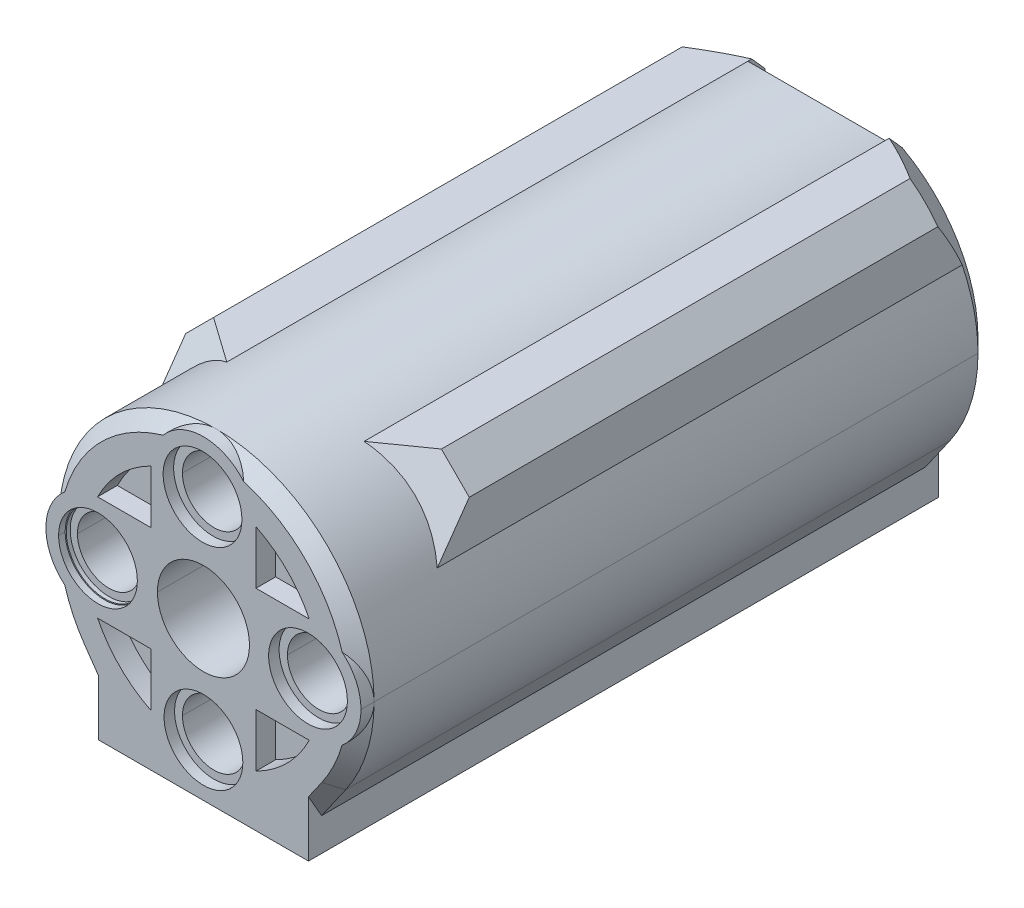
ISO-10303-21;
HEADER;
FILE_DESCRIPTION(('STEP AP214'),'2;1');
FILE_NAME('part.step','',(''),(''),'','','');
FILE_SCHEMA(('AUTOMOTIVE_DESIGN { 1 0 10303 214 1 1 1 1 }'));
ENDSEC;
DATA;
#1=APPLICATION_CONTEXT('core data for automotive mechanical design processes');
#2=APPLICATION_PROTOCOL_DEFINITION('international standard','automotive_design',2000,#1);
#3=PRODUCT_CONTEXT('',#1,'mechanical');
#4=PRODUCT('Part','Part','',(#3));
#5=PRODUCT_RELATED_PRODUCT_CATEGORY('part','',(#4));
#6=PRODUCT_DEFINITION_FORMATION('','',#4);
#7=PRODUCT_DEFINITION_CONTEXT('part definition',#1,'design');
#8=PRODUCT_DEFINITION('design','',#6,#7);
#9=PRODUCT_DEFINITION_SHAPE('','',#8);
#10=(LENGTH_UNIT() NAMED_UNIT(*) SI_UNIT(.MILLI.,.METRE.));
#11=(NAMED_UNIT(*) PLANE_ANGLE_UNIT() SI_UNIT($,.RADIAN.));
#12=(NAMED_UNIT(*) SI_UNIT($,.STERADIAN.) SOLID_ANGLE_UNIT());
#13=UNCERTAINTY_MEASURE_WITH_UNIT(LENGTH_MEASURE(1.E-05),#10,'distance_accuracy_value','');
#14=(GEOMETRIC_REPRESENTATION_CONTEXT(3) GLOBAL_UNCERTAINTY_ASSIGNED_CONTEXT((#13)) GLOBAL_UNIT_ASSIGNED_CONTEXT((#10,
#11,#12)) REPRESENTATION_CONTEXT('',''));
#15=CARTESIAN_POINT('',(0.,0.,0.));
#16=DIRECTION('',(0.,0.,1.));
#17=DIRECTION('',(1.,0.,0.));
#18=AXIS2_PLACEMENT_3D('',#15,#16,#17);
#19=CARTESIAN_POINT('',(0.,-8.,15.5));
#20=DIRECTION('',(0.,0.,1.));
#21=DIRECTION('',(1.,0.,0.));
#22=AXIS2_PLACEMENT_3D('',#19,#20,#21);
#23=CYLINDRICAL_SURFACE('',#22,2.4);
#24=CARTESIAN_POINT('',(0.,-8.,15.5));
#25=DIRECTION('',(0.,0.,1.));
#26=DIRECTION('',(1.,0.,0.));
#27=AXIS2_PLACEMENT_3D('',#24,#25,#26);
#28=CIRCLE('',#27,2.4);
#29=CARTESIAN_POINT('',(2.4,-8.,15.5));
#30=VERTEX_POINT('',#29);
#31=EDGE_CURVE('E1084',#30,#30,#28,.T.);
#32=ORIENTED_EDGE('',*,*,#31,.F.);
#33=EDGE_LOOP('',(#32));
#34=FACE_BOUND('',#33,.T.);
#35=CARTESIAN_POINT('',(0.,-8.,23.2));
#36=DIRECTION('',(0.,0.,1.));
#37=DIRECTION('',(1.,0.,0.));
#38=AXIS2_PLACEMENT_3D('',#35,#36,#37);
#39=CIRCLE('',#38,2.4);
#40=CARTESIAN_POINT('',(2.4,-8.,23.2));
#41=VERTEX_POINT('',#40);
#42=CARTESIAN_POINT('',(-2.4,-8.,23.2));
#43=VERTEX_POINT('',#42);
#44=EDGE_CURVE('E57',#41,#43,#39,.F.);
#45=ORIENTED_EDGE('',*,*,#44,.F.);
#46=DIRECTION('',(0.,0.,1.));
#47=VECTOR('',#46,1.);
#48=CARTESIAN_POINT('',(2.4,-8.,15.5));
#49=LINE('',#48,#47);
#50=CARTESIAN_POINT('',(2.4,-8.,17.));
#51=VERTEX_POINT('',#50);
#52=EDGE_CURVE('E1237',#51,#41,#49,.T.);
#53=ORIENTED_EDGE('',*,*,#52,.F.);
#54=CARTESIAN_POINT('',(0.,-8.,17.));
#55=DIRECTION('',(0.,0.,1.));
#56=DIRECTION('',(1.,0.,0.));
#57=AXIS2_PLACEMENT_3D('',#54,#55,#56);
#58=CIRCLE('',#57,2.4);
#59=CARTESIAN_POINT('',(1.16189500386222,-10.1,17.));
#60=VERTEX_POINT('',#59);
#61=EDGE_CURVE('E1322',#60,#51,#58,.T.);
#62=ORIENTED_EDGE('',*,*,#61,.F.);
#63=DIRECTION('',(0.,0.,1.));
#64=VECTOR('',#63,1.);
#65=CARTESIAN_POINT('',(1.16189500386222,-10.1,8.71177490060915));
#66=LINE('',#65,#64);
#67=CARTESIAN_POINT('',(1.16189500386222,-10.1,16.));
#68=VERTEX_POINT('',#67);
#69=EDGE_CURVE('E562',#68,#60,#66,.T.);
#70=ORIENTED_EDGE('',*,*,#69,.F.);
#71=CARTESIAN_POINT('',(0.,-8.,16.));
#72=DIRECTION('',(0.,0.,-1.));
#73=DIRECTION('',(-1.,0.,0.));
#74=AXIS2_PLACEMENT_3D('',#71,#72,#73);
#75=CIRCLE('',#74,2.4);
#76=CARTESIAN_POINT('',(-1.16189500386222,-10.1,16.));
#77=VERTEX_POINT('',#76);
#78=EDGE_CURVE('E626',#77,#68,#75,.T.);
#79=ORIENTED_EDGE('',*,*,#78,.F.);
#80=DIRECTION('',(0.,0.,1.));
#81=VECTOR('',#80,1.);
#82=CARTESIAN_POINT('',(-1.16189500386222,-10.1,8.71177490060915));
#83=LINE('',#82,#81);
#84=CARTESIAN_POINT('',(-1.16189500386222,-10.1,17.));
#85=VERTEX_POINT('',#84);
#86=EDGE_CURVE('E711',#85,#77,#83,.F.);
#87=ORIENTED_EDGE('',*,*,#86,.F.);
#88=CARTESIAN_POINT('',(-2.4,-8.,17.));
#89=VERTEX_POINT('',#88);
#90=EDGE_CURVE('E683',#89,#85,#58,.T.);
#91=ORIENTED_EDGE('',*,*,#90,.F.);
#92=DIRECTION('',(0.,0.,1.));
#93=VECTOR('',#92,1.);
#94=CARTESIAN_POINT('',(-2.4,-8.,15.5));
#95=LINE('',#94,#93);
#96=EDGE_CURVE('E722',#89,#43,#95,.T.);
#97=ORIENTED_EDGE('',*,*,#96,.T.);
#98=EDGE_LOOP('',(#45,#53,#62,#70,#79,#87,#91,#97));
#99=FACE_BOUND('',#98,.T.);
#100=ADVANCED_FACE('F44',(#34,#99),#23,.F.);
#101=CARTESIAN_POINT('',(0.,-8.,15.5));
#102=DIRECTION('',(0.,0.,1.));
#103=DIRECTION('',(1.,0.,0.));
#104=AXIS2_PLACEMENT_3D('',#101,#102,#103);
#105=CYLINDRICAL_SURFACE('',#104,2.4);
#106=CARTESIAN_POINT('',(0.,-8.,23.2));
#107=DIRECTION('',(0.,0.,1.));
#108=DIRECTION('',(1.,0.,0.));
#109=AXIS2_PLACEMENT_3D('',#106,#107,#108);
#110=CIRCLE('',#109,2.4);
#111=EDGE_CURVE('E11',#43,#41,#110,.F.);
#112=ORIENTED_EDGE('',*,*,#111,.F.);
#113=ORIENTED_EDGE('',*,*,#96,.F.);
#114=CARTESIAN_POINT('',(0.,-8.,17.));
#115=DIRECTION('',(0.,0.,1.));
#116=DIRECTION('',(1.,0.,0.));
#117=AXIS2_PLACEMENT_3D('',#114,#115,#116);
#118=CIRCLE('',#117,2.4);
#119=EDGE_CURVE('E678',#51,#89,#118,.T.);
#120=ORIENTED_EDGE('',*,*,#119,.F.);
#121=ORIENTED_EDGE('',*,*,#52,.T.);
#122=EDGE_LOOP('',(#112,#113,#120,#121));
#123=FACE_BOUND('',#122,.T.);
#124=ADVANCED_FACE('F1030',(#123),#105,.F.);
#125=CARTESIAN_POINT('',(0.,-10.1,0.));
#126=DIRECTION('',(0.,-1.,0.));
#127=DIRECTION('',(0.,0.,-1.));
#128=AXIS2_PLACEMENT_3D('',#125,#126,#127);
#129=PLANE('',#128);
#130=DIRECTION('',(1.,0.,0.));
#131=VECTOR('',#130,1.);
#132=CARTESIAN_POINT('',(-3.25,-10.1,16.));
#133=LINE('',#132,#131);
#134=CARTESIAN_POINT('',(3.25,-10.1,16.));
#135=VERTEX_POINT('',#134);
#136=EDGE_CURVE('E630',#68,#135,#133,.T.);
#137=ORIENTED_EDGE('',*,*,#136,.F.);
#138=ORIENTED_EDGE('',*,*,#69,.T.);
#139=DIRECTION('',(-1.,0.,0.));
#140=VECTOR('',#139,1.);
#141=CARTESIAN_POINT('',(-3.25,-10.1,17.));
#142=LINE('',#141,#140);
#143=CARTESIAN_POINT('',(3.25,-10.1,17.));
#144=VERTEX_POINT('',#143);
#145=EDGE_CURVE('E1276',#144,#60,#142,.T.);
#146=ORIENTED_EDGE('',*,*,#145,.F.);
#147=DIRECTION('',(0.,0.,-1.));
#148=VECTOR('',#147,1.);
#149=CARTESIAN_POINT('',(3.25,-10.1,17.1180339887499));
#150=LINE('',#149,#148);
#151=EDGE_CURVE('E1508',#144,#135,#150,.T.);
#152=ORIENTED_EDGE('',*,*,#151,.T.);
#153=EDGE_LOOP('',(#137,#138,#146,#152));
#154=FACE_BOUND('',#153,.T.);
#155=ADVANCED_FACE('F1036',(#154),#129,.F.);
#156=CARTESIAN_POINT('',(3.25,-3.22613645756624,17.1180339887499));
#157=DIRECTION('',(1.,0.,0.));
#158=DIRECTION('',(0.,1.,0.));
#159=AXIS2_PLACEMENT_3D('',#156,#157,#158);
#160=PLANE('',#159);
#161=ORIENTED_EDGE('',*,*,#151,.F.);
#162=DIRECTION('',(0.,-1.,0.));
#163=VECTOR('',#162,1.);
#164=CARTESIAN_POINT('',(3.25,-0.0999999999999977,17.));
#165=LINE('',#164,#163);
#166=CARTESIAN_POINT('',(3.25,-1.31244999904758,17.));
#167=VERTEX_POINT('',#166);
#168=EDGE_CURVE('E1164',#167,#144,#165,.T.);
#169=ORIENTED_EDGE('',*,*,#168,.F.);
#170=DIRECTION('',(0.,0.,-1.));
#171=VECTOR('',#170,1.);
#172=CARTESIAN_POINT('',(3.25,-1.31244999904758,15.5));
#173=LINE('',#172,#171);
#174=CARTESIAN_POINT('',(3.25,-1.31244999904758,16.));
#175=VERTEX_POINT('',#174);
#176=EDGE_CURVE('E768',#167,#175,#173,.T.);
#177=ORIENTED_EDGE('',*,*,#176,.T.);
#178=DIRECTION('',(0.,-1.,0.));
#179=VECTOR('',#178,1.);
#180=CARTESIAN_POINT('',(3.25,-0.0999999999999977,16.));
#181=LINE('',#180,#179);
#182=EDGE_CURVE('E687',#175,#135,#181,.T.);
#183=ORIENTED_EDGE('',*,*,#182,.T.);
#184=EDGE_LOOP('',(#161,#169,#177,#183));
#185=FACE_BOUND('',#184,.T.);
#186=ADVANCED_FACE('F982',(#185),#160,.F.);
#187=CARTESIAN_POINT('',(-3.25,-3.22613645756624,17.1180339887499));
#188=DIRECTION('',(-1.,0.,0.));
#189=DIRECTION('',(0.,0.,1.));
#190=AXIS2_PLACEMENT_3D('',#187,#188,#189);
#191=PLANE('',#190);
#192=DIRECTION('',(0.,0.,1.));
#193=VECTOR('',#192,1.);
#194=CARTESIAN_POINT('',(-3.25,-10.1,17.1180339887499));
#195=LINE('',#194,#193);
#196=CARTESIAN_POINT('',(-3.25,-10.1,16.));
#197=VERTEX_POINT('',#196);
#198=CARTESIAN_POINT('',(-3.25,-10.1,17.));
#199=VERTEX_POINT('',#198);
#200=EDGE_CURVE('E1441',#197,#199,#195,.T.);
#201=ORIENTED_EDGE('',*,*,#200,.F.);
#202=DIRECTION('',(0.,-1.,0.));
#203=VECTOR('',#202,1.);
#204=CARTESIAN_POINT('',(-3.25,-0.0999999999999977,16.));
#205=LINE('',#204,#203);
#206=CARTESIAN_POINT('',(-3.25,-1.31244999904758,16.));
#207=VERTEX_POINT('',#206);
#208=EDGE_CURVE('E1105',#207,#197,#205,.T.);
#209=ORIENTED_EDGE('',*,*,#208,.F.);
#210=DIRECTION('',(0.,0.,1.));
#211=VECTOR('',#210,1.);
#212=CARTESIAN_POINT('',(-3.25,-1.31244999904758,15.5));
#213=LINE('',#212,#211);
#214=CARTESIAN_POINT('',(-3.25,-1.31244999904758,17.));
#215=VERTEX_POINT('',#214);
#216=EDGE_CURVE('E653',#207,#215,#213,.T.);
#217=ORIENTED_EDGE('',*,*,#216,.T.);
#218=DIRECTION('',(0.,-1.,0.));
#219=VECTOR('',#218,1.);
#220=CARTESIAN_POINT('',(-3.25,-0.0999999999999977,17.));
#221=LINE('',#220,#219);
#222=EDGE_CURVE('E649',#215,#199,#221,.T.);
#223=ORIENTED_EDGE('',*,*,#222,.T.);
#224=EDGE_LOOP('',(#201,#209,#217,#223));
#225=FACE_BOUND('',#224,.T.);
#226=ADVANCED_FACE('F978',(#225),#191,.F.);
#227=CARTESIAN_POINT('',(-2.75,-3.22613645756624,16.));
#228=DIRECTION('',(0.,0.,-1.));
#229=DIRECTION('',(0.,-1.,0.));
#230=AXIS2_PLACEMENT_3D('',#227,#228,#229);
#231=PLANE('',#230);
#232=ORIENTED_EDGE('',*,*,#78,.T.);
#233=ORIENTED_EDGE('',*,*,#136,.T.);
#234=ORIENTED_EDGE('',*,*,#182,.F.);
#235=CARTESIAN_POINT('',(0.,0.,16.));
#236=DIRECTION('',(0.,0.,-1.));
#237=DIRECTION('',(-1.,0.,0.));
#238=AXIS2_PLACEMENT_3D('',#235,#236,#237);
#239=CIRCLE('',#238,3.505);
#240=EDGE_CURVE('E654',#175,#207,#239,.T.);
#241=ORIENTED_EDGE('',*,*,#240,.T.);
#242=ORIENTED_EDGE('',*,*,#208,.T.);
#243=DIRECTION('',(1.,0.,0.));
#244=VECTOR('',#243,1.);
#245=CARTESIAN_POINT('',(-3.25,-10.1,16.));
#246=LINE('',#245,#244);
#247=EDGE_CURVE('E1109',#197,#77,#246,.T.);
#248=ORIENTED_EDGE('',*,*,#247,.T.);
#249=EDGE_LOOP('',(#232,#233,#234,#241,#242,#248));
#250=FACE_BOUND('',#249,.T.);
#251=ADVANCED_FACE('F981',(#250),#231,.F.);
#252=CARTESIAN_POINT('',(-3.13196601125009,-3.22613645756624,17.));
#253=DIRECTION('',(0.,0.,1.));
#254=DIRECTION('',(1.,0.,0.));
#255=AXIS2_PLACEMENT_3D('',#252,#253,#254);
#256=PLANE('',#255);
#257=ORIENTED_EDGE('',*,*,#90,.T.);
#258=DIRECTION('',(-1.,0.,0.));
#259=VECTOR('',#258,1.);
#260=CARTESIAN_POINT('',(-3.25,-10.1,17.));
#261=LINE('',#260,#259);
#262=EDGE_CURVE('E682',#85,#199,#261,.T.);
#263=ORIENTED_EDGE('',*,*,#262,.T.);
#264=ORIENTED_EDGE('',*,*,#222,.F.);
#265=CARTESIAN_POINT('',(0.,0.,17.));
#266=DIRECTION('',(0.,0.,1.));
#267=DIRECTION('',(1.,0.,0.));
#268=AXIS2_PLACEMENT_3D('',#265,#266,#267);
#269=CIRCLE('',#268,3.505);
#270=EDGE_CURVE('E631',#215,#167,#269,.T.);
#271=ORIENTED_EDGE('',*,*,#270,.T.);
#272=ORIENTED_EDGE('',*,*,#168,.T.);
#273=ORIENTED_EDGE('',*,*,#145,.T.);
#274=ORIENTED_EDGE('',*,*,#61,.T.);
#275=ORIENTED_EDGE('',*,*,#119,.T.);
#276=EDGE_LOOP('',(#257,#263,#264,#271,#272,#273,#274,#275));
#277=FACE_BOUND('',#276,.T.);
#278=ADVANCED_FACE('F986',(#277),#256,.F.);
#279=CARTESIAN_POINT('',(0.,-8.,15.5));
#280=DIRECTION('',(0.,0.,1.));
#281=DIRECTION('',(1.,0.,0.));
#282=AXIS2_PLACEMENT_3D('',#279,#280,#281);
#283=PLANE('',#282);
#284=ORIENTED_EDGE('',*,*,#31,.T.);
#285=EDGE_LOOP('',(#284));
#286=FACE_BOUND('',#285,.T.);
#287=ADVANCED_FACE('F1014',(#286),#283,.T.);
#288=CARTESIAN_POINT('',(7.965,0.0349999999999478,23.5));
#289=DIRECTION('',(0.,0.,1.));
#290=DIRECTION('',(1.,0.,0.));
#291=AXIS2_PLACEMENT_3D('',#288,#289,#290);
#292=CYLINDRICAL_SURFACE('',#291,3.);
#293=CARTESIAN_POINT('',(7.965,0.0349999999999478,24.));
#294=DIRECTION('',(0.,0.,1.));
#295=DIRECTION('',(1.,0.,0.));
#296=AXIS2_PLACEMENT_3D('',#293,#294,#295);
#297=CIRCLE('',#296,3.);
#298=CARTESIAN_POINT('',(10.965,0.0349999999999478,24.));
#299=VERTEX_POINT('',#298);
#300=EDGE_CURVE('E601',#299,#299,#297,.T.);
#301=ORIENTED_EDGE('',*,*,#300,.T.);
#302=EDGE_LOOP('',(#301));
#303=FACE_BOUND('',#302,.T.);
#304=CARTESIAN_POINT('',(7.965,0.0349999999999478,23.2));
#305=DIRECTION('',(0.,0.,1.));
#306=DIRECTION('',(1.,0.,0.));
#307=AXIS2_PLACEMENT_3D('',#304,#305,#306);
#308=CIRCLE('',#307,2.99999999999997);
#309=CARTESIAN_POINT('',(10.965,0.0349999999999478,23.2));
#310=VERTEX_POINT('',#309);
#311=EDGE_CURVE('E2722',#310,#310,#308,.T.);
#312=ORIENTED_EDGE('',*,*,#311,.F.);
#313=EDGE_LOOP('',(#312));
#314=FACE_BOUND('',#313,.T.);
#315=ADVANCED_FACE('F1006',(#303,#314),#292,.F.);
#316=CARTESIAN_POINT('',(-0.0699999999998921,8.,23.5));
#317=DIRECTION('',(0.,0.,1.));
#318=DIRECTION('',(1.,0.,0.));
#319=AXIS2_PLACEMENT_3D('',#316,#317,#318);
#320=CYLINDRICAL_SURFACE('',#319,3.);
#321=CARTESIAN_POINT('',(-0.0699999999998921,8.,24.));
#322=DIRECTION('',(0.,0.,1.));
#323=DIRECTION('',(1.,0.,0.));
#324=AXIS2_PLACEMENT_3D('',#321,#322,#323);
#325=CIRCLE('',#324,3.);
#326=CARTESIAN_POINT('',(2.93000000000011,8.,24.));
#327=VERTEX_POINT('',#326);
#328=EDGE_CURVE('E621',#327,#327,#325,.T.);
#329=ORIENTED_EDGE('',*,*,#328,.T.);
#330=EDGE_LOOP('',(#329));
#331=FACE_BOUND('',#330,.T.);
#332=CARTESIAN_POINT('',(-0.0699999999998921,8.,23.2));
#333=DIRECTION('',(0.,0.,1.));
#334=DIRECTION('',(1.,0.,0.));
#335=AXIS2_PLACEMENT_3D('',#332,#333,#334);
#336=CIRCLE('',#335,3.);
#337=CARTESIAN_POINT('',(2.93000000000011,8.,23.2));
#338=VERTEX_POINT('',#337);
#339=EDGE_CURVE('E570',#338,#338,#336,.T.);
#340=ORIENTED_EDGE('',*,*,#339,.F.);
#341=EDGE_LOOP('',(#340));
#342=FACE_BOUND('',#341,.T.);
#343=ADVANCED_FACE('F1003',(#331,#342),#320,.F.);
#344=CARTESIAN_POINT('',(-8.035,-0.0349999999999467,23.5));
#345=DIRECTION('',(0.,0.,1.));
#346=DIRECTION('',(1.,0.,0.));
#347=AXIS2_PLACEMENT_3D('',#344,#345,#346);
#348=CYLINDRICAL_SURFACE('',#347,3.);
#349=CARTESIAN_POINT('',(-8.035,-0.0349999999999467,23.5));
#350=DIRECTION('',(0.,0.,1.));
#351=DIRECTION('',(1.,0.,0.));
#352=AXIS2_PLACEMENT_3D('',#349,#350,#351);
#353=CIRCLE('',#352,3.);
#354=CARTESIAN_POINT('',(-11.035,-0.0349999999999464,23.5));
#355=VERTEX_POINT('',#354);
#356=CARTESIAN_POINT('',(-5.03499999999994,-0.0349999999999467,23.5));
#357=VERTEX_POINT('',#356);
#358=EDGE_CURVE('E655',#355,#357,#353,.T.);
#359=ORIENTED_EDGE('',*,*,#358,.F.);
#360=DIRECTION('',(0.,0.,1.));
#361=VECTOR('',#360,1.);
#362=CARTESIAN_POINT('',(-11.035,-0.0349999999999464,23.5));
#363=LINE('',#362,#361);
#364=CARTESIAN_POINT('',(-11.035,-0.0349999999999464,24.));
#365=VERTEX_POINT('',#364);
#366=EDGE_CURVE('E1261',#355,#365,#363,.T.);
#367=ORIENTED_EDGE('',*,*,#366,.T.);
#368=CARTESIAN_POINT('',(-8.035,-0.0349999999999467,24.));
#369=DIRECTION('',(0.,0.,1.));
#370=DIRECTION('',(1.,0.,0.));
#371=AXIS2_PLACEMENT_3D('',#368,#369,#370);
#372=CIRCLE('',#371,3.);
#373=CARTESIAN_POINT('',(-5.03499999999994,-0.0349999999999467,24.));
#374=VERTEX_POINT('',#373);
#375=EDGE_CURVE('E1183',#365,#374,#372,.T.);
#376=ORIENTED_EDGE('',*,*,#375,.T.);
#377=DIRECTION('',(0.,0.,1.));
#378=VECTOR('',#377,1.);
#379=CARTESIAN_POINT('',(-5.03499999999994,-0.0349999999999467,23.5));
#380=LINE('',#379,#378);
#381=EDGE_CURVE('E660',#357,#374,#380,.T.);
#382=ORIENTED_EDGE('',*,*,#381,.F.);
#383=EDGE_LOOP('',(#359,#367,#376,#382));
#384=FACE_BOUND('',#383,.T.);
#385=ADVANCED_FACE('F1001',(#384),#348,.F.);
#386=CARTESIAN_POINT('',(0.,0.,15.5));
#387=DIRECTION('',(0.,0.,1.));
#388=DIRECTION('',(1.,0.,0.));
#389=AXIS2_PLACEMENT_3D('',#386,#387,#388);
#390=CYLINDRICAL_SURFACE('',#389,3.505);
#391=CARTESIAN_POINT('',(0.,0.,15.5));
#392=DIRECTION('',(0.,0.,1.));
#393=DIRECTION('',(1.,0.,0.));
#394=AXIS2_PLACEMENT_3D('',#391,#392,#393);
#395=CIRCLE('',#394,3.505);
#396=CARTESIAN_POINT('',(-3.505,0.,15.5));
#397=VERTEX_POINT('',#396);
#398=CARTESIAN_POINT('',(3.505,0.,15.5));
#399=VERTEX_POINT('',#398);
#400=EDGE_CURVE('E1088',#397,#399,#395,.T.);
#401=ORIENTED_EDGE('',*,*,#400,.F.);
#402=DIRECTION('',(0.,0.,1.));
#403=VECTOR('',#402,1.);
#404=CARTESIAN_POINT('',(-3.505,0.,15.5));
#405=LINE('',#404,#403);
#406=CARTESIAN_POINT('',(-3.505,0.,24.));
#407=VERTEX_POINT('',#406);
#408=EDGE_CURVE('E1184',#397,#407,#405,.T.);
#409=ORIENTED_EDGE('',*,*,#408,.T.);
#410=CARTESIAN_POINT('',(0.,0.,24.));
#411=DIRECTION('',(0.,0.,1.));
#412=DIRECTION('',(1.,0.,0.));
#413=AXIS2_PLACEMENT_3D('',#410,#411,#412);
#414=CIRCLE('',#413,3.505);
#415=CARTESIAN_POINT('',(3.505,0.,24.));
#416=VERTEX_POINT('',#415);
#417=EDGE_CURVE('E1185',#407,#416,#414,.T.);
#418=ORIENTED_EDGE('',*,*,#417,.T.);
#419=DIRECTION('',(0.,0.,1.));
#420=VECTOR('',#419,1.);
#421=CARTESIAN_POINT('',(3.505,0.,15.5));
#422=LINE('',#421,#420);
#423=EDGE_CURVE('E761',#399,#416,#422,.T.);
#424=ORIENTED_EDGE('',*,*,#423,.F.);
#425=EDGE_LOOP('',(#401,#409,#418,#424));
#426=FACE_BOUND('',#425,.T.);
#427=ORIENTED_EDGE('',*,*,#176,.F.);
#428=ORIENTED_EDGE('',*,*,#270,.F.);
#429=ORIENTED_EDGE('',*,*,#216,.F.);
#430=ORIENTED_EDGE('',*,*,#240,.F.);
#431=EDGE_LOOP('',(#427,#428,#429,#430));
#432=FACE_BOUND('',#431,.T.);
#433=ADVANCED_FACE('F792',(#426,#432),#390,.F.);
#434=CARTESIAN_POINT('',(8.,0.,22.));
#435=DIRECTION('',(0.,0.,1.));
#436=DIRECTION('',(1.,0.,0.));
#437=AXIS2_PLACEMENT_3D('',#434,#435,#436);
#438=CYLINDRICAL_SURFACE('',#437,4.);
#439=CARTESIAN_POINT('',(10.5625,-3.0714155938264,24.));
#440=CARTESIAN_POINT('',(10.6170192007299,-3.02593204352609,23.9603496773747));
#441=CARTESIAN_POINT('',(10.6706917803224,-2.97868852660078,23.9215382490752));
#442=CARTESIAN_POINT('',(10.7751806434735,-2.88155679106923,23.8463650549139));
#443=CARTESIAN_POINT('',(10.8260301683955,-2.83172800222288,23.8099726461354));
#444=CARTESIAN_POINT('',(10.9247620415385,-2.72960191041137,23.739636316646));
#445=CARTESIAN_POINT('',(10.9726799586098,-2.67736038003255,23.7056614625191));
#446=CARTESIAN_POINT('',(11.0654465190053,-2.5705944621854,23.640160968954));
#447=CARTESIAN_POINT('',(11.1103327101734,-2.51612183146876,23.608604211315));
#448=CARTESIAN_POINT('',(11.1969462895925,-2.4050805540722,23.5479397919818));
#449=CARTESIAN_POINT('',(11.2387127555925,-2.34855945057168,23.5188010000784));
#450=CARTESIAN_POINT('',(11.3190078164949,-2.23361275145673,23.4629730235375));
#451=CARTESIAN_POINT('',(11.3575765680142,-2.17523026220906,23.4362528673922));
#452=CARTESIAN_POINT('',(11.4314122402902,-2.05674706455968,23.3852600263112));
#453=CARTESIAN_POINT('',(11.4667198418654,-1.99668499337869,23.3609567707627));
#454=CARTESIAN_POINT('',(11.5173370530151,-1.90513497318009,23.3262180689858));
#455=CARTESIAN_POINT('',(11.5337357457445,-1.87454585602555,23.3149811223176));
#456=CARTESIAN_POINT('',(11.5656933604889,-1.81301518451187,23.2931151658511));
#457=CARTESIAN_POINT('',(11.5812573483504,-1.78207758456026,23.2824824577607));
#458=CARTESIAN_POINT('',(11.6130243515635,-1.71682521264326,23.2608123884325));
#459=CARTESIAN_POINT('',(11.629156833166,-1.68245910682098,23.2498261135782));
#460=CARTESIAN_POINT('',(11.6604213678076,-1.61330327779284,23.2285658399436));
#461=CARTESIAN_POINT('',(11.6755584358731,-1.57851692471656,23.2182882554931));
#462=CARTESIAN_POINT('',(11.704822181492,-1.50854996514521,23.1984452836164));
#463=CARTESIAN_POINT('',(11.7189537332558,-1.47337237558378,23.1888764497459));
#464=CARTESIAN_POINT('',(11.7461973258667,-1.40265260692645,23.170450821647));
#465=CARTESIAN_POINT('',(11.759314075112,-1.36711310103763,23.1615907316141));
#466=CARTESIAN_POINT('',(11.7845198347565,-1.29569931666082,23.1445824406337));
#467=CARTESIAN_POINT('',(11.7966133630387,-1.25982737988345,23.136431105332));
#468=CARTESIAN_POINT('',(11.819765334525,-1.18777870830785,23.1208401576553));
#469=CARTESIAN_POINT('',(11.8308280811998,-1.15160399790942,23.1133975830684));
#470=CARTESIAN_POINT('',(11.8519120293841,-1.07897987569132,23.0992239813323));
#471=CARTESIAN_POINT('',(11.8619372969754,-1.04253218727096,23.0924901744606));
#472=CARTESIAN_POINT('',(11.8809407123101,-0.969392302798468,23.0797339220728));
#473=CARTESIAN_POINT('',(11.8899226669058,-0.932701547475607,23.0737088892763));
#474=CARTESIAN_POINT('',(11.9068347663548,-0.859105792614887,23.0623699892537));
#475=CARTESIAN_POINT('',(11.9147684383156,-0.822201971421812,23.0570537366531));
#476=CARTESIAN_POINT('',(11.9295801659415,-0.74821039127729,23.0471321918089));
#477=CARTESIAN_POINT('',(11.9364614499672,-0.711123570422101,23.0425247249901));
#478=CARTESIAN_POINT('',(11.9491654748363,-0.636796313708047,23.0340205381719));
#479=CARTESIAN_POINT('',(11.954991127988,-0.599556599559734,23.0301218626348));
#480=CARTESIAN_POINT('',(11.9655818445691,-0.52495386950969,23.0230350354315));
#481=CARTESIAN_POINT('',(11.9703494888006,-0.487591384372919,23.0198451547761));
#482=CARTESIAN_POINT('',(11.9788230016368,-0.412773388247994,23.0141756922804));
#483=CARTESIAN_POINT('',(11.9825311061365,-0.375318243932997,23.0116946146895));
#484=CARTESIAN_POINT('',(11.988885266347,-0.30034514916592,23.0074425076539));
#485=CARTESIAN_POINT('',(11.9915332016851,-0.262827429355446,23.0056702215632));
#486=CARTESIAN_POINT('',(11.9957674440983,-0.187759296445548,23.0028355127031));
#487=CARTESIAN_POINT('',(11.9973552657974,-0.150209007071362,23.001772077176));
#488=CARTESIAN_POINT('',(11.9994711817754,-0.0751058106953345,23.0003546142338));
#489=CARTESIAN_POINT('',(12.0000004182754,-0.0375529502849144,22.9999998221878));
#490=CARTESIAN_POINT('',(12.,0.,23.));
#491=B_SPLINE_CURVE_WITH_KNOTS('',3,(#439,#440,#441,#442,#443,#444,#445,#446,#447,#448,#449,
#450,#451,#452,#453,#454,#455,#456,#457,#458,#459,#460,#461,#462,#463,#464,#465,#466,#467,#468,
#469,#470,#471,#472,#473,#474,#475,#476,#477,#478,#479,#480,#481,#482,#483,#484,#485,#486,#487,
#488,#489,#490),.UNSPECIFIED.,.F.,.F.,(4,2,2,2,2,2,2,2,2,2,2,2,2,2,2,2,2,2,2,2,2,2,2,2,2,4),(0.,
0.243949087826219,0.483704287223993,0.719417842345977,0.951249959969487,1.17936902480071,
1.40395177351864,1.62518341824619,1.73461430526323,1.84328079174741,1.96182600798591,
2.07971912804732,2.19699512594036,2.31368953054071,2.42983840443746,2.5454783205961,
2.66064633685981,2.77537996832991,2.88971715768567,3.00369624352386,3.11735592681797,
3.23073523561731,3.34387348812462,3.4568102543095,3.56958531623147,3.68223862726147),.UNSPECIFIED.);
#492=CARTESIAN_POINT('',(10.5625,-3.07141559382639,24.));
#493=VERTEX_POINT('',#492);
#494=CARTESIAN_POINT('',(12.,0.,23.));
#495=VERTEX_POINT('',#494);
#496=EDGE_CURVE('E774',#493,#495,#491,.T.);
#497=ORIENTED_EDGE('',*,*,#496,.T.);
#498=DIRECTION('',(0.,0.,1.));
#499=VECTOR('',#498,1.);
#500=CARTESIAN_POINT('',(12.,0.,22.));
#501=LINE('',#500,#499);
#502=CARTESIAN_POINT('',(12.,0.,24.));
#503=VERTEX_POINT('',#502);
#504=EDGE_CURVE('E953',#495,#503,#501,.T.);
#505=ORIENTED_EDGE('',*,*,#504,.T.);
#506=CARTESIAN_POINT('',(8.,0.,24.));
#507=DIRECTION('',(0.,0.,1.));
#508=DIRECTION('',(-1.,0.,0.));
#509=AXIS2_PLACEMENT_3D('',#506,#507,#508);
#510=CIRCLE('',#509,4.);
#511=EDGE_CURVE('E917',#493,#503,#510,.T.);
#512=ORIENTED_EDGE('',*,*,#511,.F.);
#513=EDGE_LOOP('',(#497,#505,#512));
#514=FACE_BOUND('',#513,.T.);
#515=ADVANCED_FACE('F781',(#514),#438,.T.);
#516=CARTESIAN_POINT('',(0.,0.,-23.));
#517=DIRECTION('',(0.,0.,1.));
#518=DIRECTION('',(1.,0.,0.));
#519=AXIS2_PLACEMENT_3D('',#516,#517,#518);
#520=CONICAL_SURFACE('',#519,12.,0.785398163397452);
#521=CARTESIAN_POINT('',(0.,0.,-24.));
#522=DIRECTION('',(0.,0.,-1.));
#523=DIRECTION('',(1.,0.,0.));
#524=AXIS2_PLACEMENT_3D('',#521,#522,#523);
#525=CIRCLE('',#524,11.);
#526=CARTESIAN_POINT('',(11.,0.,-24.));
#527=VERTEX_POINT('',#526);
#528=CARTESIAN_POINT('',(9.0149967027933,-6.30316067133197,-24.));
#529=VERTEX_POINT('',#528);
#530=EDGE_CURVE('E693',#527,#529,#525,.T.);
#531=ORIENTED_EDGE('',*,*,#530,.F.);
#532=DIRECTION('',(0.707106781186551,0.,0.707106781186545));
#533=VECTOR('',#532,1.);
#534=CARTESIAN_POINT('',(12.,0.,-23.));
#535=LINE('',#534,#533);
#536=CARTESIAN_POINT('',(12.,0.,-23.));
#537=VERTEX_POINT('',#536);
#538=EDGE_CURVE('E950',#527,#537,#535,.T.);
#539=ORIENTED_EDGE('',*,*,#538,.T.);
#540=CARTESIAN_POINT('',(0.,0.,-23.));
#541=DIRECTION('',(0.,0.,1.));
#542=DIRECTION('',(1.,0.,0.));
#543=AXIS2_PLACEMENT_3D('',#540,#541,#542);
#544=CIRCLE('',#543,12.);
#545=CARTESIAN_POINT('',(9.83454185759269,-6.87617527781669,-23.));
#546=VERTEX_POINT('',#545);
#547=EDGE_CURVE('E616',#546,#537,#544,.T.);
#548=ORIENTED_EDGE('',*,*,#547,.F.);
#549=DIRECTION('',(0.57950593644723,-0.405182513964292,0.707106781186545));
#550=VECTOR('',#549,1.);
#551=CARTESIAN_POINT('',(9.0149967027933,-6.30316067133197,-24.));
#552=LINE('',#551,#550);
#553=EDGE_CURVE('E1171',#529,#546,#552,.T.);
#554=ORIENTED_EDGE('',*,*,#553,.F.);
#555=EDGE_LOOP('',(#531,#539,#548,#554));
#556=FACE_BOUND('',#555,.T.);
#557=ADVANCED_FACE('F791',(#556),#520,.T.);
#558=CARTESIAN_POINT('',(0.,0.,24.));
#559=DIRECTION('',(0.,0.,-1.));
#560=DIRECTION('',(-1.,0.,0.));
#561=AXIS2_PLACEMENT_3D('',#558,#559,#560);
#562=CYLINDRICAL_SURFACE('',#561,12.);
#563=CARTESIAN_POINT('',(0.,0.,23.));
#564=DIRECTION('',(0.,0.,-1.));
#565=DIRECTION('',(1.,0.,0.));
#566=AXIS2_PLACEMENT_3D('',#563,#564,#565);
#567=CIRCLE('',#566,12.);
#568=CARTESIAN_POINT('',(0.,12.,23.));
#569=VERTEX_POINT('',#568);
#570=EDGE_CURVE('E943',#569,#495,#567,.T.);
#571=ORIENTED_EDGE('',*,*,#570,.T.);
#572=DIRECTION('',(0.,0.,-1.));
#573=VECTOR('',#572,1.);
#574=CARTESIAN_POINT('',(12.,0.,24.));
#575=LINE('',#574,#573);
#576=EDGE_CURVE('E939',#495,#537,#575,.T.);
#577=ORIENTED_EDGE('',*,*,#576,.T.);
#578=CARTESIAN_POINT('',(0.,0.,-23.));
#579=DIRECTION('',(0.,0.,1.));
#580=DIRECTION('',(1.,0.,0.));
#581=AXIS2_PLACEMENT_3D('',#578,#579,#580);
#582=CIRCLE('',#581,12.);
#583=CARTESIAN_POINT('',(10.8,5.23067873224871,-23.));
#584=VERTEX_POINT('',#583);
#585=EDGE_CURVE('E944',#537,#584,#582,.T.);
#586=ORIENTED_EDGE('',*,*,#585,.T.);
#587=DIRECTION('',(0.,0.,-1.));
#588=VECTOR('',#587,1.);
#589=CARTESIAN_POINT('',(10.8,5.23067873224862,18.));
#590=LINE('',#589,#588);
#591=CARTESIAN_POINT('',(10.8,5.23067873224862,16.9901048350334));
#592=VERTEX_POINT('',#591);
#593=EDGE_CURVE('E1290',#592,#584,#590,.T.);
#594=ORIENTED_EDGE('',*,*,#593,.F.);
#595=CARTESIAN_POINT('',(10.8,5.23067873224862,16.9901048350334));
#596=CARTESIAN_POINT('',(9.61174018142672,7.68412821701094,16.0954806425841));
#597=CARTESIAN_POINT('',(7.68412821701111,9.61174018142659,16.0954806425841));
#598=CARTESIAN_POINT('',(5.2306787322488,10.8,16.9901048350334));
#599=(BOUNDED_CURVE() B_SPLINE_CURVE(3,(#595,#596,#597,#598),.UNSPECIFIED.,.F.,
.F.) B_SPLINE_CURVE_WITH_KNOTS((4,4),(5.94881395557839,6.61755665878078),
.UNSPECIFIED.) CURVE() GEOMETRIC_REPRESENTATION_ITEM() RATIONAL_B_SPLINE_CURVE((1.,
0.963077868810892,0.963077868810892,1.)) REPRESENTATION_ITEM(''));
#600=CARTESIAN_POINT('',(5.2306787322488,10.8,16.9901048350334));
#601=VERTEX_POINT('',#600);
#602=EDGE_CURVE('E1215',#592,#601,#599,.T.);
#603=ORIENTED_EDGE('',*,*,#602,.T.);
#604=DIRECTION('',(0.,0.,-1.));
#605=VECTOR('',#604,1.);
#606=CARTESIAN_POINT('',(5.2306787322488,10.8,18.));
#607=LINE('',#606,#605);
#608=CARTESIAN_POINT('',(5.2306787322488,10.8,-22.7));
#609=VERTEX_POINT('',#608);
#610=EDGE_CURVE('E1134',#601,#609,#607,.T.);
#611=ORIENTED_EDGE('',*,*,#610,.T.);
#612=CARTESIAN_POINT('',(5.2306787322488,10.8,-22.7));
#613=CARTESIAN_POINT('',(1.86809954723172,12.4285714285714,-21.0714285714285));
#614=CARTESIAN_POINT('',(-1.86809954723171,12.4285714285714,-21.0714285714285));
#615=CARTESIAN_POINT('',(-5.2306787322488,10.8,-22.7));
#616=(BOUNDED_CURVE() B_SPLINE_CURVE(3,(#612,#613,#614,#615),.UNSPECIFIED.,.F.,
.F.) B_SPLINE_CURVE_WITH_KNOTS((4,4),(2.69056584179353,3.59261946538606),
.UNSPECIFIED.) CURVE() GEOMETRIC_REPRESENTATION_ITEM() RATIONAL_B_SPLINE_CURVE((1.,
0.933333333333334,0.933333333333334,1.)) REPRESENTATION_ITEM(''));
#617=CARTESIAN_POINT('',(-5.2306787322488,10.8,-22.7));
#618=VERTEX_POINT('',#617);
#619=EDGE_CURVE('E1128',#609,#618,#616,.T.);
#620=ORIENTED_EDGE('',*,*,#619,.T.);
#621=DIRECTION('',(0.,0.,-1.));
#622=VECTOR('',#621,1.);
#623=CARTESIAN_POINT('',(-5.2306787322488,10.8,18.));
#624=LINE('',#623,#622);
#625=CARTESIAN_POINT('',(-5.2306787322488,10.8,16.9901048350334));
#626=VERTEX_POINT('',#625);
#627=EDGE_CURVE('E1202',#626,#618,#624,.T.);
#628=ORIENTED_EDGE('',*,*,#627,.F.);
#629=CARTESIAN_POINT('',(-5.2306787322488,10.8,16.9901048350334));
#630=CARTESIAN_POINT('',(-7.6841282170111,9.61174018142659,16.0954806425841));
#631=CARTESIAN_POINT('',(-9.61174018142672,7.68412821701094,16.0954806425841));
#632=CARTESIAN_POINT('',(-10.8,5.23067873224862,16.9901048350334));
#633=(BOUNDED_CURVE() B_SPLINE_CURVE(3,(#629,#630,#631,#632),.UNSPECIFIED.,.F.,
.F.) B_SPLINE_CURVE_WITH_KNOTS((4,4),(5.94881395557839,6.61755665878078),
.UNSPECIFIED.) CURVE() GEOMETRIC_REPRESENTATION_ITEM() RATIONAL_B_SPLINE_CURVE((1.,
0.963077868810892,0.963077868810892,1.)) REPRESENTATION_ITEM(''));
#634=CARTESIAN_POINT('',(-10.8,5.23067873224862,16.9901048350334));
#635=VERTEX_POINT('',#634);
#636=EDGE_CURVE('E1135',#626,#635,#633,.T.);
#637=ORIENTED_EDGE('',*,*,#636,.T.);
#638=DIRECTION('',(0.,0.,-1.));
#639=VECTOR('',#638,1.);
#640=CARTESIAN_POINT('',(-10.8,5.23067873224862,18.));
#641=LINE('',#640,#639);
#642=CARTESIAN_POINT('',(-10.8,5.23067873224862,-23.));
#643=VERTEX_POINT('',#642);
#644=EDGE_CURVE('E1315',#635,#643,#641,.T.);
#645=ORIENTED_EDGE('',*,*,#644,.T.);
#646=CARTESIAN_POINT('',(0.,0.,-23.));
#647=DIRECTION('',(0.,0.,1.));
#648=DIRECTION('',(1.,0.,0.));
#649=AXIS2_PLACEMENT_3D('',#646,#647,#648);
#650=CIRCLE('',#649,12.);
#651=CARTESIAN_POINT('',(-12.,0.,-23.));
#652=VERTEX_POINT('',#651);
#653=EDGE_CURVE('E825',#643,#652,#650,.T.);
#654=ORIENTED_EDGE('',*,*,#653,.T.);
#655=DIRECTION('',(0.,0.,-1.));
#656=VECTOR('',#655,1.);
#657=CARTESIAN_POINT('',(-12.,0.,24.));
#658=LINE('',#657,#656);
#659=CARTESIAN_POINT('',(-12.,0.,23.));
#660=VERTEX_POINT('',#659);
#661=EDGE_CURVE('E2813',#660,#652,#658,.T.);
#662=ORIENTED_EDGE('',*,*,#661,.F.);
#663=CARTESIAN_POINT('',(0.,0.,23.));
#664=DIRECTION('',(0.,0.,-1.));
#665=DIRECTION('',(1.,0.,0.));
#666=AXIS2_PLACEMENT_3D('',#663,#664,#665);
#667=CIRCLE('',#666,12.);
#668=EDGE_CURVE('E2822',#660,#569,#667,.T.);
#669=ORIENTED_EDGE('',*,*,#668,.T.);
#670=EDGE_LOOP('',(#571,#577,#586,#594,#603,#611,#620,#628,#637,#645,#654,#662,#669));
#671=FACE_BOUND('',#670,.T.);
#672=ADVANCED_FACE('F1022',(#671),#562,.T.);
#673=CARTESIAN_POINT('',(0.,0.,24.));
#674=DIRECTION('',(0.,0.,-1.));
#675=DIRECTION('',(-1.,0.,0.));
#676=AXIS2_PLACEMENT_3D('',#673,#674,#675);
#677=CYLINDRICAL_SURFACE('',#676,12.);
#678=CARTESIAN_POINT('',(0.,0.,23.));
#679=DIRECTION('',(0.,0.,-1.));
#680=DIRECTION('',(1.,0.,0.));
#681=AXIS2_PLACEMENT_3D('',#678,#679,#680);
#682=CIRCLE('',#681,12.);
#683=CARTESIAN_POINT('',(-9.83454185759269,-6.87617527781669,23.));
#684=VERTEX_POINT('',#683);
#685=EDGE_CURVE('E2816',#684,#660,#682,.T.);
#686=ORIENTED_EDGE('',*,*,#685,.T.);
#687=ORIENTED_EDGE('',*,*,#661,.T.);
#688=CARTESIAN_POINT('',(0.,0.,-23.));
#689=DIRECTION('',(0.,0.,1.));
#690=DIRECTION('',(1.,0.,0.));
#691=AXIS2_PLACEMENT_3D('',#688,#689,#690);
#692=CIRCLE('',#691,12.);
#693=CARTESIAN_POINT('',(-9.83454185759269,-6.87617527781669,-23.));
#694=VERTEX_POINT('',#693);
#695=EDGE_CURVE('E1077',#652,#694,#692,.T.);
#696=ORIENTED_EDGE('',*,*,#695,.T.);
#697=DIRECTION('',(0.,0.,1.));
#698=VECTOR('',#697,1.);
#699=CARTESIAN_POINT('',(-9.83454185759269,-6.87617527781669,-44.3255118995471));
#700=LINE('',#699,#698);
#701=EDGE_CURVE('E1197',#694,#684,#700,.T.);
#702=ORIENTED_EDGE('',*,*,#701,.T.);
#703=EDGE_LOOP('',(#686,#687,#696,#702));
#704=FACE_BOUND('',#703,.T.);
#705=ADVANCED_FACE('F793',(#704),#677,.T.);
#706=CARTESIAN_POINT('',(0.,0.,-24.));
#707=DIRECTION('',(0.,0.,1.));
#708=DIRECTION('',(1.,0.,0.));
#709=AXIS2_PLACEMENT_3D('',#706,#707,#708);
#710=PLANE('',#709);
#711=DIRECTION('',(0.,1.,0.));
#712=VECTOR('',#711,1.);
#713=CARTESIAN_POINT('',(-8.,-9.5,-24.));
#714=LINE('',#713,#712);
#715=CARTESIAN_POINT('',(-8.,-12.,-24.));
#716=VERTEX_POINT('',#715);
#717=CARTESIAN_POINT('',(-8.,-7.75484378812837,-24.));
#718=VERTEX_POINT('',#717);
#719=EDGE_CURVE('E596',#716,#718,#714,.T.);
#720=ORIENTED_EDGE('',*,*,#719,.T.);
#721=DIRECTION('',(-0.573014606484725,0.81954515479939,0.));
#722=VECTOR('',#721,1.);
#723=CARTESIAN_POINT('',(-9.0149967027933,-6.30316067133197,-24.));
#724=LINE('',#723,#722);
#725=CARTESIAN_POINT('',(-9.0149967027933,-6.30316067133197,-24.));
#726=VERTEX_POINT('',#725);
#727=EDGE_CURVE('E593',#718,#726,#724,.T.);
#728=ORIENTED_EDGE('',*,*,#727,.T.);
#729=CARTESIAN_POINT('',(0.,0.,-24.));
#730=DIRECTION('',(0.,0.,-1.));
#731=DIRECTION('',(1.,0.,0.));
#732=AXIS2_PLACEMENT_3D('',#729,#730,#731);
#733=CIRCLE('',#732,11.);
#734=CARTESIAN_POINT('',(-5.2306787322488,9.67677632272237,-24.));
#735=VERTEX_POINT('',#734);
#736=EDGE_CURVE('E597',#726,#735,#733,.T.);
#737=ORIENTED_EDGE('',*,*,#736,.T.);
#738=DIRECTION('',(0.,1.,0.));
#739=VECTOR('',#738,1.);
#740=CARTESIAN_POINT('',(-5.2306787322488,12.5,-24.));
#741=LINE('',#740,#739);
#742=CARTESIAN_POINT('',(-5.2306787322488,9.5,-24.));
#743=VERTEX_POINT('',#742);
#744=EDGE_CURVE('E610',#743,#735,#741,.T.);
#745=ORIENTED_EDGE('',*,*,#744,.F.);
#746=DIRECTION('',(1.,0.,0.));
#747=VECTOR('',#746,1.);
#748=CARTESIAN_POINT('',(-5.2306787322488,9.5,-24.));
#749=LINE('',#748,#747);
#750=CARTESIAN_POINT('',(5.2306787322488,9.5,-24.));
#751=VERTEX_POINT('',#750);
#752=EDGE_CURVE('E718',#743,#751,#749,.T.);
#753=ORIENTED_EDGE('',*,*,#752,.T.);
#754=DIRECTION('',(0.,1.,0.));
#755=VECTOR('',#754,1.);
#756=CARTESIAN_POINT('',(5.2306787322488,12.5,-24.));
#757=LINE('',#756,#755);
#758=CARTESIAN_POINT('',(5.2306787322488,9.67677632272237,-24.));
#759=VERTEX_POINT('',#758);
#760=EDGE_CURVE('E692',#751,#759,#757,.T.);
#761=ORIENTED_EDGE('',*,*,#760,.T.);
#762=CARTESIAN_POINT('',(0.,0.,-24.));
#763=DIRECTION('',(0.,0.,-1.));
#764=DIRECTION('',(1.,0.,0.));
#765=AXIS2_PLACEMENT_3D('',#762,#763,#764);
#766=CIRCLE('',#765,11.);
#767=EDGE_CURVE('E688',#759,#527,#766,.T.);
#768=ORIENTED_EDGE('',*,*,#767,.T.);
#769=ORIENTED_EDGE('',*,*,#530,.T.);
#770=DIRECTION('',(-0.573014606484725,-0.81954515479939,0.));
#771=VECTOR('',#770,1.);
#772=CARTESIAN_POINT('',(7.18045484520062,-8.92698539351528,-24.));
#773=LINE('',#772,#771);
#774=CARTESIAN_POINT('',(8.,-7.75484378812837,-24.));
#775=VERTEX_POINT('',#774);
#776=EDGE_CURVE('E1093',#529,#775,#773,.T.);
#777=ORIENTED_EDGE('',*,*,#776,.T.);
#778=DIRECTION('',(0.,-1.,0.));
#779=VECTOR('',#778,1.);
#780=CARTESIAN_POINT('',(8.,-9.5,-24.));
#781=LINE('',#780,#779);
#782=CARTESIAN_POINT('',(8.,-12.,-24.));
#783=VERTEX_POINT('',#782);
#784=EDGE_CURVE('E1097',#775,#783,#781,.T.);
#785=ORIENTED_EDGE('',*,*,#784,.T.);
#786=DIRECTION('',(-1.,0.,0.));
#787=VECTOR('',#786,1.);
#788=CARTESIAN_POINT('',(-8.,-12.,-24.));
#789=LINE('',#788,#787);
#790=EDGE_CURVE('E1141',#783,#716,#789,.T.);
#791=ORIENTED_EDGE('',*,*,#790,.T.);
#792=EDGE_LOOP('',(#720,#728,#737,#745,#753,#761,#768,#769,#777,#785,#791));
#793=FACE_BOUND('',#792,.T.);
#794=ADVANCED_FACE('F838',(#793),#710,.F.);
#795=CARTESIAN_POINT('',(0.,0.,-23.));
#796=DIRECTION('',(0.,0.,1.));
#797=DIRECTION('',(1.,0.,0.));
#798=AXIS2_PLACEMENT_3D('',#795,#796,#797);
#799=CONICAL_SURFACE('',#798,12.,0.785398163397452);
#800=CARTESIAN_POINT('',(-5.23067873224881,10.8,-23.));
#801=CARTESIAN_POINT('',(-6.83099202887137,10.8,-22.3024396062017));
#802=CARTESIAN_POINT('',(-8.67867965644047,10.8,-21.1450557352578));
#803=B_SPLINE_CURVE_WITH_KNOTS('',2,(#800,#801,#802),.UNSPECIFIED.,.F.,.F.,(3,3),(0.,1.),.UNSPECIFIED.);
#804=CARTESIAN_POINT('',(-5.2306787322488,10.8,-23.));
#805=VERTEX_POINT('',#804);
#806=CARTESIAN_POINT('',(-8.67867965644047,10.8,-21.1450557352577));
#807=VERTEX_POINT('',#806);
#808=EDGE_CURVE('E716',#805,#807,#803,.T.);
#809=ORIENTED_EDGE('',*,*,#808,.F.);
#810=CARTESIAN_POINT('',(-5.2306787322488,10.8,-23.));
#811=CARTESIAN_POINT('',(-5.2306787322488,10.4274124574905,-23.3353287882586));
#812=CARTESIAN_POINT('',(-5.2306787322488,10.0531259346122,-23.6689226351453));
#813=CARTESIAN_POINT('',(-5.2306787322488,9.67677632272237,-24.));
#814=(BOUNDED_CURVE() B_SPLINE_CURVE(3,(#810,#811,#812,#813),.UNSPECIFIED.,.F.,
.F.) B_SPLINE_CURVE_WITH_KNOTS((4,4),(0.00613940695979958,0.00764310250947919),
.UNSPECIFIED.) CURVE() GEOMETRIC_REPRESENTATION_ITEM() RATIONAL_B_SPLINE_CURVE((1.,1.,1.,1.)) REPRESENTATION_ITEM(''));
#815=EDGE_CURVE('E856',#805,#735,#814,.T.);
#816=ORIENTED_EDGE('',*,*,#815,.T.);
#817=ORIENTED_EDGE('',*,*,#736,.F.);
#818=DIRECTION('',(-0.57950593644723,-0.405182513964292,0.707106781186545));
#819=VECTOR('',#818,1.);
#820=CARTESIAN_POINT('',(-9.0149967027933,-6.30316067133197,-24.));
#821=LINE('',#820,#819);
#822=EDGE_CURVE('E865',#726,#694,#821,.T.);
#823=ORIENTED_EDGE('',*,*,#822,.T.);
#824=ORIENTED_EDGE('',*,*,#695,.F.);
#825=ORIENTED_EDGE('',*,*,#653,.F.);
#826=CARTESIAN_POINT('',(-10.8,8.67867965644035,-21.1450557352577));
#827=CARTESIAN_POINT('',(-10.8,6.83099202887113,-22.3024396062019));
#828=CARTESIAN_POINT('',(-10.8,5.23067873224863,-23.));
#829=B_SPLINE_CURVE_WITH_KNOTS('',2,(#826,#827,#828),.UNSPECIFIED.,.F.,.F.,(3,3),(0.,1.),.UNSPECIFIED.);
#830=CARTESIAN_POINT('',(-10.8,8.67867965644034,-21.1450557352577));
#831=VERTEX_POINT('',#830);
#832=EDGE_CURVE('E819',#831,#643,#829,.T.);
#833=ORIENTED_EDGE('',*,*,#832,.F.);
#834=CARTESIAN_POINT('',(-8.67867965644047,10.8,-21.1450557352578));
#835=CARTESIAN_POINT('',(-9.73933982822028,9.73933982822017,-21.3074526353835));
#836=CARTESIAN_POINT('',(-10.8000000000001,8.67867965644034,-21.1450557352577));
#837=B_SPLINE_CURVE_WITH_KNOTS('',2,(#834,#835,#836),.UNSPECIFIED.,.F.,.F.,(3,3),(0.,1.),.UNSPECIFIED.);
#838=EDGE_CURVE('E961',#807,#831,#837,.T.);
#839=ORIENTED_EDGE('',*,*,#838,.F.);
#840=EDGE_LOOP('',(#809,#816,#817,#823,#824,#825,#833,#839));
#841=FACE_BOUND('',#840,.T.);
#842=ADVANCED_FACE('F827',(#841),#799,.T.);
#843=CARTESIAN_POINT('',(0.,0.,24.));
#844=DIRECTION('',(0.,0.,-1.));
#845=DIRECTION('',(-1.,0.,0.));
#846=AXIS2_PLACEMENT_3D('',#843,#844,#845);
#847=CONICAL_SURFACE('',#846,11.,0.785398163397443);
#848=ORIENTED_EDGE('',*,*,#496,.F.);
#849=CARTESIAN_POINT('',(0.,0.,24.));
#850=DIRECTION('',(0.,0.,1.));
#851=DIRECTION('',(1.,0.,0.));
#852=AXIS2_PLACEMENT_3D('',#849,#850,#851);
#853=CIRCLE('',#852,11.);
#854=CARTESIAN_POINT('',(9.01499670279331,-6.30316067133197,24.));
#855=VERTEX_POINT('',#854);
#856=EDGE_CURVE('E620',#855,#493,#853,.T.);
#857=ORIENTED_EDGE('',*,*,#856,.F.);
#858=DIRECTION('',(-0.579505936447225,0.405182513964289,0.707106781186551));
#859=VECTOR('',#858,1.);
#860=CARTESIAN_POINT('',(9.83454185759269,-6.87617527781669,23.));
#861=LINE('',#860,#859);
#862=CARTESIAN_POINT('',(9.83454185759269,-6.87617527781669,23.));
#863=VERTEX_POINT('',#862);
#864=EDGE_CURVE('E1172',#863,#855,#861,.T.);
#865=ORIENTED_EDGE('',*,*,#864,.F.);
#866=CARTESIAN_POINT('',(0.,0.,23.));
#867=DIRECTION('',(0.,0.,-1.));
#868=DIRECTION('',(1.,0.,0.));
#869=AXIS2_PLACEMENT_3D('',#866,#867,#868);
#870=CIRCLE('',#869,12.);
#871=EDGE_CURVE('E619',#495,#863,#870,.T.);
#872=ORIENTED_EDGE('',*,*,#871,.F.);
#873=EDGE_LOOP('',(#848,#857,#865,#872));
#874=FACE_BOUND('',#873,.T.);
#875=ADVANCED_FACE('F837',(#874),#847,.T.);
#876=CARTESIAN_POINT('',(0.,0.,24.));
#877=DIRECTION('',(0.,0.,-1.));
#878=DIRECTION('',(-1.,0.,0.));
#879=AXIS2_PLACEMENT_3D('',#876,#877,#878);
#880=CONICAL_SURFACE('',#879,11.,0.785398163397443);
#881=CARTESIAN_POINT('',(-10.5625,3.07141559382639,24.));
#882=CARTESIAN_POINT('',(-10.6170192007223,3.02593204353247,23.9603496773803));
#883=CARTESIAN_POINT('',(-10.6706917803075,2.97868852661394,23.9215382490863));
#884=CARTESIAN_POINT('',(-10.7751806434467,2.8815567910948,23.8463650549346));
#885=CARTESIAN_POINT('',(-10.8260301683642,2.83172800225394,23.8099726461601));
#886=CARTESIAN_POINT('',(-10.9247620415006,2.72960191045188,23.7396363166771));
#887=CARTESIAN_POINT('',(-10.9726799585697,2.67736038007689,23.7056614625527));
#888=CARTESIAN_POINT('',(-11.0654465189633,2.57059446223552,23.6401609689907));
#889=CARTESIAN_POINT('',(-11.1103327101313,2.51612183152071,23.6086042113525));
#890=CARTESIAN_POINT('',(-11.1969462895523,2.40508055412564,23.5479397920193));
#891=CARTESIAN_POINT('',(-11.2387127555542,2.34855945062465,23.5188010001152));
#892=CARTESIAN_POINT('',(-11.3190078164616,2.23361275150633,23.4629730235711));
#893=CARTESIAN_POINT('',(-11.3575765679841,2.17523026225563,23.4362528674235));
#894=CARTESIAN_POINT('',(-11.4314122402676,2.05674706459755,23.3852600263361));
#895=CARTESIAN_POINT('',(-11.466719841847,1.99668499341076,23.3609567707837));
#896=CARTESIAN_POINT('',(-11.5173370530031,1.90513497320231,23.326218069));
#897=CARTESIAN_POINT('',(-11.5337357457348,1.87454585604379,23.3149811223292));
#898=CARTESIAN_POINT('',(-11.5656933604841,1.8130151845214,23.2931151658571));
#899=CARTESIAN_POINT('',(-11.5812573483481,1.78207758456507,23.2824824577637));
#900=CARTESIAN_POINT('',(-11.6130243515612,1.71682521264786,23.2608123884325));
#901=CARTESIAN_POINT('',(-11.6291568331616,1.68245910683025,23.2498261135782));
#902=CARTESIAN_POINT('',(-11.6604213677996,1.61330327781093,23.2285658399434));
#903=CARTESIAN_POINT('',(-11.6755584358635,1.57851692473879,23.2182882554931));
#904=CARTESIAN_POINT('',(-11.7048221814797,1.50854996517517,23.1984452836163));
#905=CARTESIAN_POINT('',(-11.7189537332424,1.47337237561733,23.1888764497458));
#906=CARTESIAN_POINT('',(-11.7461973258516,1.40265260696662,23.170450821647));
#907=CARTESIAN_POINT('',(-11.7593140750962,1.36711310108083,23.161590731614));
#908=CARTESIAN_POINT('',(-11.7845198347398,1.29569931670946,23.1445824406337));
#909=CARTESIAN_POINT('',(-11.7966133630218,1.25982737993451,23.1364311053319));
#910=CARTESIAN_POINT('',(-11.8197653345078,1.18777870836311,23.1208401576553));
#911=CARTESIAN_POINT('',(-11.8308280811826,1.15160399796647,23.1133975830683));
#912=CARTESIAN_POINT('',(-11.8519120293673,1.07897987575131,23.0992239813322));
#913=CARTESIAN_POINT('',(-11.8619372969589,1.04253218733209,23.0924901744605));
#914=CARTESIAN_POINT('',(-11.8809407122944,0.969392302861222,23.0797339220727));
#915=CARTESIAN_POINT('',(-11.8899226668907,0.932701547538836,23.0737088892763));
#916=CARTESIAN_POINT('',(-11.9068347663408,0.859105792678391,23.0623699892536));
#917=CARTESIAN_POINT('',(-11.9147684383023,0.82220197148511,23.057053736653));
#918=CARTESIAN_POINT('',(-11.9295801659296,0.74821039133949,23.0471321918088));
#919=CARTESIAN_POINT('',(-11.9364614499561,0.711123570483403,23.04252472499));
#920=CARTESIAN_POINT('',(-11.9491654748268,0.63679631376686,23.0340205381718));
#921=CARTESIAN_POINT('',(-11.9549911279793,0.599556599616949,23.0301218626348));
#922=CARTESIAN_POINT('',(-11.9655818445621,0.52495386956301,23.0230350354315));
#923=CARTESIAN_POINT('',(-11.9703494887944,0.487591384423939,23.0198451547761));
#924=CARTESIAN_POINT('',(-11.9788230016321,0.412773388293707,23.0141756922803));
#925=CARTESIAN_POINT('',(-11.9825311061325,0.375318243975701,23.0116946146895));
#926=CARTESIAN_POINT('',(-11.9888852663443,0.300345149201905,23.0074425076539));
#927=CARTESIAN_POINT('',(-11.991533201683,0.262827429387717,23.0056702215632));
#928=CARTESIAN_POINT('',(-11.9957674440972,0.187759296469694,23.0028355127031));
#929=CARTESIAN_POINT('',(-11.9973552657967,0.150209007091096,23.001772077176));
#930=CARTESIAN_POINT('',(-11.9994711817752,0.0751058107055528,23.0003546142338));
#931=CARTESIAN_POINT('',(-12.0000004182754,0.0375529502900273,22.9999998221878));
#932=CARTESIAN_POINT('',(-12.,0.,23.));
#933=B_SPLINE_CURVE_WITH_KNOTS('',3,(#881,#882,#883,#884,#885,#886,#887,#888,#889,#890,#891,
#892,#893,#894,#895,#896,#897,#898,#899,#900,#901,#902,#903,#904,#905,#906,#907,#908,#909,#910,
#911,#912,#913,#914,#915,#916,#917,#918,#919,#920,#921,#922,#923,#924,#925,#926,#927,#928,#929,
#930,#931,#932),.UNSPECIFIED.,.F.,.F.,(4,2,2,2,2,2,2,2,2,2,2,2,2,2,2,2,2,2,2,2,2,2,2,2,2,4),(0.,
0.243949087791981,0.483704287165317,0.719417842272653,0.951249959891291,1.17936902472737,
1.40395177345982,1.62518341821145,1.73461430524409,1.84328079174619,1.96182600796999,
2.07971912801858,2.19699512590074,2.31368953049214,2.42983840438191,2.54547832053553,
2.66064633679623,2.77537996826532,2.8897171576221,3.00369624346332,3.11735592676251,
3.23073523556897,3.34387348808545,3.45681025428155,3.56958531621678,3.68223862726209),.UNSPECIFIED.);
#934=CARTESIAN_POINT('',(-10.5625,3.07141559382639,24.));
#935=VERTEX_POINT('',#934);
#936=EDGE_CURVE('E2748',#935,#660,#933,.T.);
#937=ORIENTED_EDGE('',*,*,#936,.F.);
#938=CARTESIAN_POINT('',(0.,0.,24.));
#939=DIRECTION('',(0.,0.,1.));
#940=DIRECTION('',(1.,0.,0.));
#941=AXIS2_PLACEMENT_3D('',#938,#939,#940);
#942=CIRCLE('',#941,11.);
#943=CARTESIAN_POINT('',(-3.07141559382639,10.5625,24.));
#944=VERTEX_POINT('',#943);
#945=EDGE_CURVE('E1571',#944,#935,#942,.T.);
#946=ORIENTED_EDGE('',*,*,#945,.F.);
#947=CARTESIAN_POINT('',(0.,12.,23.));
#948=CARTESIAN_POINT('',(-0.0375892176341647,12.0000004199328,22.9999998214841));
#949=CARTESIAN_POINT('',(-0.0751783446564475,11.9994701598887,23.0003553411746));
#950=CARTESIAN_POINT('',(-0.150354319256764,11.9973501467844,23.001775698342));
#951=CARTESIAN_POINT('',(-0.18794111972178,11.9957592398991,23.0028413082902));
#952=CARTESIAN_POINT('',(-0.263082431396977,11.9915167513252,23.0056818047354));
#953=CARTESIAN_POINT('',(-0.300636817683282,11.9888636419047,23.0074577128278));
#954=CARTESIAN_POINT('',(-0.375683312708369,11.9824970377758,23.0117185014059));
#955=CARTESIAN_POINT('',(-0.413175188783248,11.9787816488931,23.0142046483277));
#956=CARTESIAN_POINT('',(-0.48806662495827,11.97029145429,23.0198856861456));
#957=CARTESIAN_POINT('',(-0.525465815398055,11.9655143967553,23.0230820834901));
#958=CARTESIAN_POINT('',(-0.600141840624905,11.9549027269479,23.0301833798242));
#959=CARTESIAN_POINT('',(-0.637418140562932,11.9490655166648,23.0340900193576));
#960=CARTESIAN_POINT('',(-0.711818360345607,11.9363362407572,23.0426115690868));
#961=CARTESIAN_POINT('',(-0.748941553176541,11.929441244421,23.0472284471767));
#962=CARTESIAN_POINT('',(-0.823005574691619,11.9145999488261,23.0571702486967));
#963=CARTESIAN_POINT('',(-0.859945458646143,11.9066504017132,23.0624973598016));
#964=CARTESIAN_POINT('',(-0.933612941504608,11.8897044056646,23.0738594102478));
#965=CARTESIAN_POINT('',(-0.970339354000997,11.8807044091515,23.079896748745));
#966=CARTESIAN_POINT('',(-1.04355005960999,11.8616627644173,23.0926790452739));
#967=CARTESIAN_POINT('',(-1.0800329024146,11.8516172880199,23.0994266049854));
#968=CARTESIAN_POINT('',(-1.15272674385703,11.8304907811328,23.1136291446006));
#969=CARTESIAN_POINT('',(-1.18893600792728,11.8194056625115,23.1210869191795));
#970=CARTESIAN_POINT('',(-1.26105310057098,11.7962068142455,23.1367096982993));
#971=CARTESIAN_POINT('',(-1.29695889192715,11.7840887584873,23.1448776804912));
#972=CARTESIAN_POINT('',(-1.36843960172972,11.7588318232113,23.1619206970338));
#973=CARTESIAN_POINT('',(-1.40401216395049,11.7456884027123,23.1707988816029));
#974=CARTESIAN_POINT('',(-1.47479716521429,11.7183893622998,23.189262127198));
#975=CARTESIAN_POINT('',(-1.51000691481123,11.7042290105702,23.198850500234));
#976=CARTESIAN_POINT('',(-1.58003721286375,11.674905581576,23.2187339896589));
#977=CARTESIAN_POINT('',(-1.61485472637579,11.6597376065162,23.2290325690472));
#978=CARTESIAN_POINT('',(-1.68407181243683,11.6284091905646,23.2503362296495));
#979=CARTESIAN_POINT('',(-1.71846799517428,11.6122437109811,23.2613449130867));
#980=CARTESIAN_POINT('',(-1.7837066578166,11.5804458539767,23.2830360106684));
#981=CARTESIAN_POINT('',(-1.81460183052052,11.5648857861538,23.2936660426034));
#982=CARTESIAN_POINT('',(-1.87604833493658,11.532937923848,23.3155254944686));
#983=CARTESIAN_POINT('',(-1.90659571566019,11.5165450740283,23.3267586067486));
#984=CARTESIAN_POINT('',(-1.99802138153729,11.4659481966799,23.3614840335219));
#985=CARTESIAN_POINT('',(-2.05800225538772,11.4306580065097,23.3857759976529));
#986=CARTESIAN_POINT('',(-2.17632665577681,11.3568643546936,23.4367415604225));
#987=CARTESIAN_POINT('',(-2.23463159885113,11.3183203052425,23.463445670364));
#988=CARTESIAN_POINT('',(-2.34942731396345,11.2380815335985,23.5192368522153));
#989=CARTESIAN_POINT('',(-2.40587505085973,11.1963467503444,23.5483548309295));
#990=CARTESIAN_POINT('',(-2.51677421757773,11.1098030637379,23.6089729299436));
#991=CARTESIAN_POINT('',(-2.5711781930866,11.0649551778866,23.6405041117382));
#992=CARTESIAN_POINT('',(-2.67781190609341,10.9722713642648,23.7059487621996));
#993=CARTESIAN_POINT('',(-2.72998999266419,10.9243979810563,23.7398932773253));
#994=CARTESIAN_POINT('',(-2.83199476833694,10.8257608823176,23.8101642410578));
#995=CARTESIAN_POINT('',(-2.8817658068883,10.7749616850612,23.8465215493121));
#996=CARTESIAN_POINT('',(-2.97878802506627,10.6705787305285,23.9216198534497));
#997=CARTESIAN_POINT('',(-3.02597991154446,10.6169618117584,23.9603914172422));
#998=CARTESIAN_POINT('',(-3.07141559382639,10.5625,24.));
#999=B_SPLINE_CURVE_WITH_KNOTS('',3,(#947,#948,#949,#950,#951,#952,#953,#954,#955,#956,#957,
#958,#959,#960,#961,#962,#963,#964,#965,#966,#967,#968,#969,#970,#971,#972,#973,#974,#975,#976,
#977,#978,#979,#980,#981,#982,#983,#984,#985,#986,#987,#988,#989,#990,#991,#992,#993,#994,#995,
#996,#997,#998),.UNSPECIFIED.,.F.,.F.,(4,2,2,2,2,2,2,2,2,2,2,2,2,2,2,2,2,2,2,2,2,2,2,2,2,4),(0.,
0.112762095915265,0.225647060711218,0.338694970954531,0.451945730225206,0.565439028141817,
0.679214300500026,0.793310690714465,0.907767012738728,1.02262171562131,1.13791284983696,
1.25367803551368,1.36995443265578,1.48677871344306,1.60418703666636,1.72221502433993,
1.84089774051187,1.94944819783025,2.05876272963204,2.27976042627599,2.50410692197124,
2.73198679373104,2.96357617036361,3.19904285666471,3.4385465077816,3.68223884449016),.UNSPECIFIED.);
#1000=EDGE_CURVE('E2743',#569,#944,#999,.T.);
#1001=ORIENTED_EDGE('',*,*,#1000,.F.);
#1002=ORIENTED_EDGE('',*,*,#668,.F.);
#1003=EDGE_LOOP('',(#937,#946,#1001,#1002));
#1004=FACE_BOUND('',#1003,.T.);
#1005=ADVANCED_FACE('F909',(#1004),#880,.T.);
#1006=CARTESIAN_POINT('',(0.,0.,24.));
#1007=DIRECTION('',(0.,0.,-1.));
#1008=DIRECTION('',(-1.,0.,0.));
#1009=AXIS2_PLACEMENT_3D('',#1006,#1007,#1008);
#1010=CONICAL_SURFACE('',#1009,11.,0.785398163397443);
#1011=CARTESIAN_POINT('',(12.,0.,23.));
#1012=CARTESIAN_POINT('',(12.0000004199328,0.0375892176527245,22.9999998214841));
#1013=CARTESIAN_POINT('',(11.9994701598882,0.0751783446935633,23.0003553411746));
#1014=CARTESIAN_POINT('',(11.9973501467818,0.150354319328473,23.0017756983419));
#1015=CARTESIAN_POINT('',(11.9957592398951,0.187941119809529,23.0028413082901));
#1016=CARTESIAN_POINT('',(11.9915167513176,0.263082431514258,23.0056818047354));
#1017=CARTESIAN_POINT('',(11.988863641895,0.300636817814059,23.0074577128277));
#1018=CARTESIAN_POINT('',(11.9824970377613,0.375683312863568,23.0117185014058));
#1019=CARTESIAN_POINT('',(11.978781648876,0.413175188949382,23.0142046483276));
#1020=CARTESIAN_POINT('',(11.9702914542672,0.488066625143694,23.0198856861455));
#1021=CARTESIAN_POINT('',(11.9655143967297,0.525465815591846,23.02308208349));
#1022=CARTESIAN_POINT('',(11.9549027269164,0.600141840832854,23.0301833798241));
#1023=CARTESIAN_POINT('',(11.9490655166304,0.637418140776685,23.0340900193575));
#1024=CARTESIAN_POINT('',(11.936336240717,0.711818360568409,23.0426115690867));
#1025=CARTESIAN_POINT('',(11.929441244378,0.748941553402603,23.0472284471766));
#1026=CARTESIAN_POINT('',(11.9145999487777,0.823005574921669,23.0571702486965));
#1027=CARTESIAN_POINT('',(11.9066504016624,0.85994545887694,23.0624973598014));
#1028=CARTESIAN_POINT('',(11.8897044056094,0.933612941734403,23.0738594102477));
#1029=CARTESIAN_POINT('',(11.8807044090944,0.970339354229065,23.0798967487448));
#1030=CARTESIAN_POINT('',(11.8616627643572,1.04355005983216,23.0926790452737));
#1031=CARTESIAN_POINT('',(11.8516172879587,1.08003290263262,23.0994266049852));
#1032=CARTESIAN_POINT('',(11.8304907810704,1.15272674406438,23.1136291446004));
#1033=CARTESIAN_POINT('',(11.8194056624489,1.18893600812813,23.1210869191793));
#1034=CARTESIAN_POINT('',(11.7962068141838,1.26105310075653,23.1367096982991));
#1035=CARTESIAN_POINT('',(11.7840887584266,1.29695889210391,23.144877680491));
#1036=CARTESIAN_POINT('',(11.758831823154,1.3684396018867,23.1619206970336));
#1037=CARTESIAN_POINT('',(11.7456884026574,1.4040121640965,23.1707988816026));
#1038=CARTESIAN_POINT('',(11.7183893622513,1.47479716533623,23.1892621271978));
#1039=CARTESIAN_POINT('',(11.7042290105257,1.51000691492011,23.1988505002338));
#1040=CARTESIAN_POINT('',(11.6749055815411,1.5800372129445,23.2187339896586));
#1041=CARTESIAN_POINT('',(11.659737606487,1.61485472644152,23.2290325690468));
#1042=CARTESIAN_POINT('',(11.6284091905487,1.68407181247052,23.2503362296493));
#1043=CARTESIAN_POINT('',(11.6122437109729,1.71846799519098,23.2613449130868));
#1044=CARTESIAN_POINT('',(11.5804458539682,1.7837066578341,23.2830360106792));
#1045=CARTESIAN_POINT('',(11.5648857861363,1.81460183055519,23.2936660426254));
#1046=CARTESIAN_POINT('',(11.5329379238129,1.8760483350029,23.315525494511));
#1047=CARTESIAN_POINT('',(11.5165450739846,1.90659571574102,23.3267586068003));
#1048=CARTESIAN_POINT('',(11.4659481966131,1.99802138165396,23.3614840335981));
#1049=CARTESIAN_POINT('',(11.4306580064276,2.05800225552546,23.3857759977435));
#1050=CARTESIAN_POINT('',(11.3568643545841,2.17632665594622,23.4367415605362));
#1051=CARTESIAN_POINT('',(11.3183203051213,2.23463159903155,23.4634456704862));
#1052=CARTESIAN_POINT('',(11.2380815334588,2.34942731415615,23.5192368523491));
#1053=CARTESIAN_POINT('',(11.1963467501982,2.40587505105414,23.548354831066));
#1054=CARTESIAN_POINT('',(11.1098030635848,2.51677421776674,23.6089729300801));
#1055=CARTESIAN_POINT('',(11.0649551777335,2.57117819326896,23.6405041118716));
#1056=CARTESIAN_POINT('',(10.9722713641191,2.67781190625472,23.7059487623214));
#1057=CARTESIAN_POINT('',(10.9243979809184,2.72998999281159,23.7398932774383));
#1058=CARTESIAN_POINT('',(10.8257608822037,2.83199476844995,23.8101642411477));
#1059=CARTESIAN_POINT('',(10.7749616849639,2.88176580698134,23.8465215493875));
#1060=CARTESIAN_POINT('',(10.6705787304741,2.97878802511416,23.9216198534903));
#1061=CARTESIAN_POINT('',(10.6169618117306,3.0259799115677,23.9603914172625));
#1062=CARTESIAN_POINT('',(10.5625,3.07141559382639,24.));
#1063=B_SPLINE_CURVE_WITH_KNOTS('',3,(#1011,#1012,#1013,#1014,#1015,#1016,#1017,#1018,#1019,
#1020,#1021,#1022,#1023,#1024,#1025,#1026,#1027,#1028,#1029,#1030,#1031,#1032,#1033,#1034,#1035,
#1036,#1037,#1038,#1039,#1040,#1041,#1042,#1043,#1044,#1045,#1046,#1047,#1048,#1049,#1050,#1051,
#1052,#1053,#1054,#1055,#1056,#1057,#1058,#1059,#1060,#1061,#1062),.UNSPECIFIED.,.F.,.F.,(4,2,2,
2,2,2,2,2,2,2,2,2,2,2,2,2,2,2,2,2,2,2,2,2,2,4),(0.,0.112762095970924,0.225647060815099,
0.338694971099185,0.451945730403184,0.565439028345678,0.679214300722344,0.793310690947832,
0.907767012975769,1.02262171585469,1.13791285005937,1.2536780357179,1.36995443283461,
1.48677871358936,1.60418703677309,1.7222150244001,1.84089774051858,1.9494481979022,
2.05876272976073,2.2797604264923,2.50410692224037,2.73198679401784,2.96357617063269,
3.19904285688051,3.43854650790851,3.68223884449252),.UNSPECIFIED.);
#1064=CARTESIAN_POINT('',(10.5625,3.07141559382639,24.));
#1065=VERTEX_POINT('',#1064);
#1066=EDGE_CURVE('E1152',#495,#1065,#1063,.T.);
#1067=ORIENTED_EDGE('',*,*,#1066,.F.);
#1068=ORIENTED_EDGE('',*,*,#570,.F.);
#1069=CARTESIAN_POINT('',(3.07141559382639,10.5625,24.));
#1070=CARTESIAN_POINT('',(3.02593204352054,10.6170192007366,23.9603496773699));
#1071=CARTESIAN_POINT('',(2.97868852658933,10.6706917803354,23.9215382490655));
#1072=CARTESIAN_POINT('',(2.88155679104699,10.7751806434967,23.8463650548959));
#1073=CARTESIAN_POINT('',(2.83172800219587,10.8260301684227,23.8099726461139));
#1074=CARTESIAN_POINT('',(2.72960191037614,10.9247620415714,23.739636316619));
#1075=CARTESIAN_POINT('',(2.67736037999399,10.9726799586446,23.70566146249));
#1076=CARTESIAN_POINT('',(2.57059446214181,11.0654465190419,23.6401609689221));
#1077=CARTESIAN_POINT('',(2.51612183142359,11.11033271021,23.6086042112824));
#1078=CARTESIAN_POINT('',(2.40508055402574,11.1969462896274,23.5479397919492));
#1079=CARTESIAN_POINT('',(2.34855945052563,11.2387127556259,23.5188010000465));
#1080=CARTESIAN_POINT('',(2.23361275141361,11.3190078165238,23.4629730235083));
#1081=CARTESIAN_POINT('',(2.17523026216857,11.3575765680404,23.436252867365));
#1082=CARTESIAN_POINT('',(2.05674706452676,11.4314122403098,23.3852600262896));
#1083=CARTESIAN_POINT('',(1.9966849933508,11.4667198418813,23.3609567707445));
#1084=CARTESIAN_POINT('',(1.90513497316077,11.5173370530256,23.3262180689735));
#1085=CARTESIAN_POINT('',(1.8745458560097,11.5337357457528,23.3149811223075));
#1086=CARTESIAN_POINT('',(1.81301518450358,11.565693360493,23.2931151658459));
#1087=CARTESIAN_POINT('',(1.78207758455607,11.5812573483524,23.2824824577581));
#1088=CARTESIAN_POINT('',(1.71682521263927,11.6130243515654,23.2608123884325));
#1089=CARTESIAN_POINT('',(1.68245910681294,11.6291568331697,23.2498261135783));
#1090=CARTESIAN_POINT('',(1.61330327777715,11.6604213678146,23.2285658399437));
#1091=CARTESIAN_POINT('',(1.57851692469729,11.6755584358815,23.2182882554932));
#1092=CARTESIAN_POINT('',(1.50854996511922,11.7048221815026,23.1984452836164));
#1093=CARTESIAN_POINT('',(1.47337237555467,11.7189537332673,23.1888764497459));
#1094=CARTESIAN_POINT('',(1.40265260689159,11.7461973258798,23.1704508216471));
#1095=CARTESIAN_POINT('',(1.36711310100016,11.7593140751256,23.1615907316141));
#1096=CARTESIAN_POINT('',(1.29569931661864,11.7845198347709,23.1445824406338));
#1097=CARTESIAN_POINT('',(1.25982737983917,11.7966133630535,23.1364311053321));
#1098=CARTESIAN_POINT('',(1.18777870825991,11.8197653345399,23.1208401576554));
#1099=CARTESIAN_POINT('',(1.15160399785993,11.8308280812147,23.1133975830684));
#1100=CARTESIAN_POINT('',(1.07897987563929,11.8519120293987,23.0992239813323));
#1101=CARTESIAN_POINT('',(1.04253218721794,11.8619372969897,23.0924901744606));
#1102=CARTESIAN_POINT('',(0.96939230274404,11.8809407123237,23.0797339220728));
#1103=CARTESIAN_POINT('',(0.932701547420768,11.889922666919,23.0737088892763));
#1104=CARTESIAN_POINT('',(0.85910579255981,11.9068347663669,23.0623699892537));
#1105=CARTESIAN_POINT('',(0.822201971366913,11.9147684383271,23.0570537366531));
#1106=CARTESIAN_POINT('',(0.748210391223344,11.9295801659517,23.0471321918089));
#1107=CARTESIAN_POINT('',(0.711123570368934,11.9364614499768,23.0425247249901));
#1108=CARTESIAN_POINT('',(0.636796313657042,11.9491654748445,23.0340205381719));
#1109=CARTESIAN_POINT('',(0.599556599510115,11.9549911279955,23.0301218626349));
#1110=CARTESIAN_POINT('',(0.524953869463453,11.9655818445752,23.0230350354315));
#1111=CARTESIAN_POINT('',(0.48759138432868,11.9703494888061,23.0198451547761));
#1112=CARTESIAN_POINT('',(0.41277338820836,11.9788230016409,23.0141756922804));
#1113=CARTESIAN_POINT('',(0.375318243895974,11.9825311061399,23.0116946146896));
#1114=CARTESIAN_POINT('',(0.300345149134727,11.9888852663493,23.0074425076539));
#1115=CARTESIAN_POINT('',(0.262827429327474,11.9915332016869,23.0056702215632));
#1116=CARTESIAN_POINT('',(0.187759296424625,11.9957674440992,23.0028355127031));
#1117=CARTESIAN_POINT('',(0.150209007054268,11.997355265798,23.001772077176));
#1118=CARTESIAN_POINT('',(0.075105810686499,11.9994711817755,23.0003546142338));
#1119=CARTESIAN_POINT('',(0.0375529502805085,12.0000004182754,22.9999998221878));
#1120=CARTESIAN_POINT('',(0.,12.,23.));
#1121=B_SPLINE_CURVE_WITH_KNOTS('',3,(#1069,#1070,#1071,#1072,#1073,#1074,#1075,#1076,#1077,
#1078,#1079,#1080,#1081,#1082,#1083,#1084,#1085,#1086,#1087,#1088,#1089,#1090,#1091,#1092,#1093,
#1094,#1095,#1096,#1097,#1098,#1099,#1100,#1101,#1102,#1103,#1104,#1105,#1106,#1107,#1108,#1109,
#1110,#1111,#1112,#1113,#1114,#1115,#1116,#1117,#1118,#1119,#1120),.UNSPECIFIED.,.F.,.F.,(4,2,2,
2,2,2,2,2,2,2,2,2,2,2,2,2,2,2,2,2,2,2,2,2,2,4),(0.,0.243949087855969,0.483704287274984,
0.719417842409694,0.951249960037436,1.17936902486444,1.40395177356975,1.62518341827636,
1.73461430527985,1.84328079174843,1.9618260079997,2.07971912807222,2.19699512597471,
2.31368953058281,2.42983840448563,2.54547832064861,2.66064633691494,2.7753799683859,
2.88971715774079,3.00369624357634,3.11735592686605,3.2307352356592,3.34387348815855,
3.45681025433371,3.56958531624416,3.68223862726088),.UNSPECIFIED.);
#1122=CARTESIAN_POINT('',(3.07141559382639,10.5625,24.));
#1123=VERTEX_POINT('',#1122);
#1124=EDGE_CURVE('E2740',#1123,#569,#1121,.T.);
#1125=ORIENTED_EDGE('',*,*,#1124,.F.);
#1126=CARTESIAN_POINT('',(0.,0.,24.));
#1127=DIRECTION('',(0.,0.,1.));
#1128=DIRECTION('',(1.,0.,0.));
#1129=AXIS2_PLACEMENT_3D('',#1126,#1127,#1128);
#1130=CIRCLE('',#1129,11.);
#1131=EDGE_CURVE('E2700',#1065,#1123,#1130,.T.);
#1132=ORIENTED_EDGE('',*,*,#1131,.F.);
#1133=EDGE_LOOP('',(#1067,#1068,#1125,#1132));
#1134=FACE_BOUND('',#1133,.T.);
#1135=ADVANCED_FACE('F1649',(#1134),#1010,.T.);
#1136=CARTESIAN_POINT('',(-8.,-12.,-44.3255118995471));
#1137=DIRECTION('',(0.,-1.,0.));
#1138=DIRECTION('',(0.,0.,-1.));
#1139=AXIS2_PLACEMENT_3D('',#1136,#1137,#1138);
#1140=PLANE('',#1139);
#1141=DIRECTION('',(0.,0.,-1.));
#1142=VECTOR('',#1141,1.);
#1143=CARTESIAN_POINT('',(-6.33221208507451,-12.,22.5029519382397));
#1144=LINE('',#1143,#1142);
#1145=CARTESIAN_POINT('',(-6.33221208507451,-12.,22.5029519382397));
#1146=VERTEX_POINT('',#1145);
#1147=CARTESIAN_POINT('',(-6.33221208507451,-12.,-22.2970480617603));
#1148=VERTEX_POINT('',#1147);
#1149=EDGE_CURVE('E1413',#1146,#1148,#1144,.T.);
#1150=ORIENTED_EDGE('',*,*,#1149,.F.);
#1151=DIRECTION('',(-1.,0.,0.));
#1152=VECTOR('',#1151,1.);
#1153=CARTESIAN_POINT('',(-6.33221208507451,-12.,22.5029519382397));
#1154=LINE('',#1153,#1152);
#1155=CARTESIAN_POINT('',(-1.53221208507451,-12.,22.5029519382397));
#1156=VERTEX_POINT('',#1155);
#1157=EDGE_CURVE('E1420',#1156,#1146,#1154,.T.);
#1158=ORIENTED_EDGE('',*,*,#1157,.F.);
#1159=DIRECTION('',(0.,0.,1.));
#1160=VECTOR('',#1159,1.);
#1161=CARTESIAN_POINT('',(-1.53221208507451,-12.,22.5029519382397));
#1162=LINE('',#1161,#1160);
#1163=CARTESIAN_POINT('',(-1.53221208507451,-12.,-22.2970480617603));
#1164=VERTEX_POINT('',#1163);
#1165=EDGE_CURVE('E1434',#1164,#1156,#1162,.T.);
#1166=ORIENTED_EDGE('',*,*,#1165,.F.);
#1167=DIRECTION('',(1.,0.,0.));
#1168=VECTOR('',#1167,1.);
#1169=CARTESIAN_POINT('',(-6.33221208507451,-12.,-22.2970480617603));
#1170=LINE('',#1169,#1168);
#1171=EDGE_CURVE('E1431',#1148,#1164,#1170,.T.);
#1172=ORIENTED_EDGE('',*,*,#1171,.F.);
#1173=EDGE_LOOP('',(#1150,#1158,#1166,#1172));
#1174=FACE_BOUND('',#1173,.T.);
#1175=DIRECTION('',(1.,0.,0.));
#1176=VECTOR('',#1175,1.);
#1177=CARTESIAN_POINT('',(1.66778791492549,-12.,-22.2970480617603));
#1178=LINE('',#1177,#1176);
#1179=CARTESIAN_POINT('',(1.66778791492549,-12.,-22.2970480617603));
#1180=VERTEX_POINT('',#1179);
#1181=CARTESIAN_POINT('',(6.46778791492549,-12.,-22.2970480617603));
#1182=VERTEX_POINT('',#1181);
#1183=EDGE_CURVE('E1475',#1180,#1182,#1178,.T.);
#1184=ORIENTED_EDGE('',*,*,#1183,.F.);
#1185=DIRECTION('',(0.,0.,-1.));
#1186=VECTOR('',#1185,1.);
#1187=CARTESIAN_POINT('',(1.66778791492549,-12.,-22.2970480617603));
#1188=LINE('',#1187,#1186);
#1189=CARTESIAN_POINT('',(1.66778791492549,-12.,22.5029519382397));
#1190=VERTEX_POINT('',#1189);
#1191=EDGE_CURVE('E1482',#1190,#1180,#1188,.T.);
#1192=ORIENTED_EDGE('',*,*,#1191,.F.);
#1193=DIRECTION('',(-1.,0.,0.));
#1194=VECTOR('',#1193,1.);
#1195=CARTESIAN_POINT('',(1.66778791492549,-12.,22.5029519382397));
#1196=LINE('',#1195,#1194);
#1197=CARTESIAN_POINT('',(6.46778791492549,-12.,22.5029519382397));
#1198=VERTEX_POINT('',#1197);
#1199=EDGE_CURVE('E1496',#1198,#1190,#1196,.T.);
#1200=ORIENTED_EDGE('',*,*,#1199,.F.);
#1201=DIRECTION('',(0.,0.,1.));
#1202=VECTOR('',#1201,1.);
#1203=CARTESIAN_POINT('',(6.46778791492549,-12.,22.5029519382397));
#1204=LINE('',#1203,#1202);
#1205=EDGE_CURVE('E1493',#1182,#1198,#1204,.T.);
#1206=ORIENTED_EDGE('',*,*,#1205,.F.);
#1207=EDGE_LOOP('',(#1184,#1192,#1200,#1206));
#1208=FACE_BOUND('',#1207,.T.);
#1209=ORIENTED_EDGE('',*,*,#790,.F.);
#1210=DIRECTION('',(0.,0.,1.));
#1211=VECTOR('',#1210,1.);
#1212=CARTESIAN_POINT('',(8.,-12.,-44.3255118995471));
#1213=LINE('',#1212,#1211);
#1214=CARTESIAN_POINT('',(8.,-12.,24.));
#1215=VERTEX_POINT('',#1214);
#1216=EDGE_CURVE('E1241',#783,#1215,#1213,.T.);
#1217=ORIENTED_EDGE('',*,*,#1216,.T.);
#1218=DIRECTION('',(1.,0.,0.));
#1219=VECTOR('',#1218,1.);
#1220=CARTESIAN_POINT('',(-8.,-12.,24.));
#1221=LINE('',#1220,#1219);
#1222=CARTESIAN_POINT('',(-8.,-12.,24.));
#1223=VERTEX_POINT('',#1222);
#1224=EDGE_CURVE('E674',#1223,#1215,#1221,.T.);
#1225=ORIENTED_EDGE('',*,*,#1224,.F.);
#1226=DIRECTION('',(0.,0.,1.));
#1227=VECTOR('',#1226,1.);
#1228=CARTESIAN_POINT('',(-8.,-12.,-44.3255118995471));
#1229=LINE('',#1228,#1227);
#1230=EDGE_CURVE('E707',#716,#1223,#1229,.T.);
#1231=ORIENTED_EDGE('',*,*,#1230,.F.);
#1232=EDGE_LOOP('',(#1209,#1217,#1225,#1231));
#1233=FACE_BOUND('',#1232,.T.);
#1234=ADVANCED_FACE('F975',(#1174,#1208,#1233),#1140,.T.);
#1235=CARTESIAN_POINT('',(-8.67867965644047,10.8,18.));
#1236=DIRECTION('',(-0.707106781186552,0.707106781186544,0.));
#1237=DIRECTION('',(0.,0.,1.));
#1238=AXIS2_PLACEMENT_3D('',#1235,#1236,#1237);
#1239=PLANE('',#1238);
#1240=DIRECTION('',(0.,0.,-1.));
#1241=VECTOR('',#1240,1.);
#1242=CARTESIAN_POINT('',(-8.67867965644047,10.8,18.));
#1243=LINE('',#1242,#1241);
#1244=CARTESIAN_POINT('',(-8.67867965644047,10.8,14.552));
#1245=VERTEX_POINT('',#1244);
#1246=EDGE_CURVE('E1514',#1245,#807,#1243,.T.);
#1247=ORIENTED_EDGE('',*,*,#1246,.T.);
#1248=ORIENTED_EDGE('',*,*,#838,.T.);
#1249=DIRECTION('',(0.,0.,-1.));
#1250=VECTOR('',#1249,1.);
#1251=CARTESIAN_POINT('',(-10.8,8.67867965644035,18.));
#1252=LINE('',#1251,#1250);
#1253=CARTESIAN_POINT('',(-10.8,8.67867965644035,14.552));
#1254=VERTEX_POINT('',#1253);
#1255=EDGE_CURVE('E1529',#1254,#831,#1252,.T.);
#1256=ORIENTED_EDGE('',*,*,#1255,.F.);
#1257=DIRECTION('',(0.707106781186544,0.707106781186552,0.));
#1258=VECTOR('',#1257,1.);
#1259=CARTESIAN_POINT('',(-8.67867965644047,10.8,14.552));
#1260=LINE('',#1259,#1258);
#1261=EDGE_CURVE('E1527',#1254,#1245,#1260,.T.);
#1262=ORIENTED_EDGE('',*,*,#1261,.T.);
#1263=EDGE_LOOP('',(#1247,#1248,#1256,#1262));
#1264=FACE_BOUND('',#1263,.T.);
#1265=ADVANCED_FACE('F800',(#1264),#1239,.T.);
#1266=CARTESIAN_POINT('',(-10.8,8.67867965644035,18.));
#1267=DIRECTION('',(-1.,0.,0.));
#1268=DIRECTION('',(0.,1.,0.));
#1269=AXIS2_PLACEMENT_3D('',#1266,#1267,#1268);
#1270=PLANE('',#1269);
#1271=ORIENTED_EDGE('',*,*,#1255,.T.);
#1272=ORIENTED_EDGE('',*,*,#832,.T.);
#1273=ORIENTED_EDGE('',*,*,#644,.F.);
#1274=DIRECTION('',(0.,0.816496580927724,-0.577350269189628));
#1275=VECTOR('',#1274,1.);
#1276=CARTESIAN_POINT('',(-10.8,7.05327686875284,15.7013333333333));
#1277=LINE('',#1276,#1275);
#1278=EDGE_CURVE('E1206',#635,#1254,#1277,.T.);
#1279=ORIENTED_EDGE('',*,*,#1278,.T.);
#1280=EDGE_LOOP('',(#1271,#1272,#1273,#1279));
#1281=FACE_BOUND('',#1280,.T.);
#1282=ADVANCED_FACE('F795',(#1281),#1270,.T.);
#1283=CARTESIAN_POINT('',(-8.67867965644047,10.8,18.));
#1284=DIRECTION('',(0.,1.,0.));
#1285=DIRECTION('',(1.,0.,0.));
#1286=AXIS2_PLACEMENT_3D('',#1283,#1284,#1285);
#1287=PLANE('',#1286);
#1288=ORIENTED_EDGE('',*,*,#627,.T.);
#1289=DIRECTION('',(0.,0.,1.));
#1290=VECTOR('',#1289,1.);
#1291=CARTESIAN_POINT('',(-5.2306787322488,10.8,24.));
#1292=LINE('',#1291,#1290);
#1293=EDGE_CURVE('E587',#805,#618,#1292,.T.);
#1294=ORIENTED_EDGE('',*,*,#1293,.F.);
#1295=ORIENTED_EDGE('',*,*,#808,.T.);
#1296=ORIENTED_EDGE('',*,*,#1246,.F.);
#1297=DIRECTION('',(0.816496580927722,0.,0.577350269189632));
#1298=VECTOR('',#1297,1.);
#1299=CARTESIAN_POINT('',(-7.05327686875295,10.8,15.7013333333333));
#1300=LINE('',#1299,#1298);
#1301=EDGE_CURVE('E712',#1245,#626,#1300,.T.);
#1302=ORIENTED_EDGE('',*,*,#1301,.T.);
#1303=EDGE_LOOP('',(#1288,#1294,#1295,#1296,#1302));
#1304=FACE_BOUND('',#1303,.T.);
#1305=ADVANCED_FACE('F799',(#1304),#1287,.T.);
#1306=CARTESIAN_POINT('',(8.67867965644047,10.8,18.));
#1307=DIRECTION('',(0.707106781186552,0.707106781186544,0.));
#1308=DIRECTION('',(0.,0.,-1.));
#1309=AXIS2_PLACEMENT_3D('',#1306,#1307,#1308);
#1310=PLANE('',#1309);
#1311=DIRECTION('',(0.,0.,-1.));
#1312=VECTOR('',#1311,1.);
#1313=CARTESIAN_POINT('',(10.8,8.67867965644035,18.));
#1314=LINE('',#1313,#1312);
#1315=CARTESIAN_POINT('',(10.8,8.67867965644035,14.552));
#1316=VERTEX_POINT('',#1315);
#1317=CARTESIAN_POINT('',(10.8,8.67867965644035,-21.1450557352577));
#1318=VERTEX_POINT('',#1317);
#1319=EDGE_CURVE('E717',#1316,#1318,#1314,.T.);
#1320=ORIENTED_EDGE('',*,*,#1319,.T.);
#1321=CARTESIAN_POINT('',(10.8000000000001,8.67867965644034,-21.1450557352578));
#1322=CARTESIAN_POINT('',(9.73933982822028,9.73933982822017,-21.3074526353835));
#1323=CARTESIAN_POINT('',(8.67867965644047,10.8,-21.1450557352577));
#1324=B_SPLINE_CURVE_WITH_KNOTS('',2,(#1321,#1322,#1323),.UNSPECIFIED.,.F.,.F.,(3,3),(0.,1.),.UNSPECIFIED.);
#1325=CARTESIAN_POINT('',(8.67867965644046,10.8,-21.1450557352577));
#1326=VERTEX_POINT('',#1325);
#1327=EDGE_CURVE('E756',#1318,#1326,#1324,.T.);
#1328=ORIENTED_EDGE('',*,*,#1327,.T.);
#1329=DIRECTION('',(0.,0.,-1.));
#1330=VECTOR('',#1329,1.);
#1331=CARTESIAN_POINT('',(8.67867965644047,10.8,18.));
#1332=LINE('',#1331,#1330);
#1333=CARTESIAN_POINT('',(8.67867965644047,10.8,14.552));
#1334=VERTEX_POINT('',#1333);
#1335=EDGE_CURVE('E757',#1334,#1326,#1332,.T.);
#1336=ORIENTED_EDGE('',*,*,#1335,.F.);
#1337=DIRECTION('',(0.707106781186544,-0.707106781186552,0.));
#1338=VECTOR('',#1337,1.);
#1339=CARTESIAN_POINT('',(10.8,8.67867965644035,14.552));
#1340=LINE('',#1339,#1338);
#1341=EDGE_CURVE('E753',#1334,#1316,#1340,.T.);
#1342=ORIENTED_EDGE('',*,*,#1341,.T.);
#1343=EDGE_LOOP('',(#1320,#1328,#1336,#1342));
#1344=FACE_BOUND('',#1343,.T.);
#1345=ADVANCED_FACE('F887',(#1344),#1310,.T.);
#1346=CARTESIAN_POINT('',(8.67867965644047,10.8,18.));
#1347=DIRECTION('',(0.,1.,0.));
#1348=DIRECTION('',(1.,0.,0.));
#1349=AXIS2_PLACEMENT_3D('',#1346,#1347,#1348);
#1350=PLANE('',#1349);
#1351=ORIENTED_EDGE('',*,*,#1335,.T.);
#1352=CARTESIAN_POINT('',(8.67867965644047,10.8,-21.1450557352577));
#1353=CARTESIAN_POINT('',(6.8309920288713,10.8,-22.3024396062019));
#1354=CARTESIAN_POINT('',(5.23067873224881,10.8,-23.));
#1355=B_SPLINE_CURVE_WITH_KNOTS('',2,(#1352,#1353,#1354),.UNSPECIFIED.,.F.,.F.,(3,3),(0.,1.),.UNSPECIFIED.);
#1356=CARTESIAN_POINT('',(5.2306787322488,10.8,-23.));
#1357=VERTEX_POINT('',#1356);
#1358=EDGE_CURVE('E1566',#1326,#1357,#1355,.T.);
#1359=ORIENTED_EDGE('',*,*,#1358,.T.);
#1360=DIRECTION('',(0.,0.,1.));
#1361=VECTOR('',#1360,1.);
#1362=CARTESIAN_POINT('',(5.2306787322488,10.8,24.));
#1363=LINE('',#1362,#1361);
#1364=EDGE_CURVE('E1289',#1357,#609,#1363,.T.);
#1365=ORIENTED_EDGE('',*,*,#1364,.T.);
#1366=ORIENTED_EDGE('',*,*,#610,.F.);
#1367=DIRECTION('',(0.816496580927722,0.,-0.577350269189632));
#1368=VECTOR('',#1367,1.);
#1369=CARTESIAN_POINT('',(7.05327686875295,10.8,15.7013333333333));
#1370=LINE('',#1369,#1368);
#1371=EDGE_CURVE('E1285',#601,#1334,#1370,.T.);
#1372=ORIENTED_EDGE('',*,*,#1371,.T.);
#1373=EDGE_LOOP('',(#1351,#1359,#1365,#1366,#1372));
#1374=FACE_BOUND('',#1373,.T.);
#1375=ADVANCED_FACE('F897',(#1374),#1350,.T.);
#1376=CARTESIAN_POINT('',(10.8,8.67867965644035,18.));
#1377=DIRECTION('',(1.,0.,0.));
#1378=DIRECTION('',(0.,0.,1.));
#1379=AXIS2_PLACEMENT_3D('',#1376,#1377,#1378);
#1380=PLANE('',#1379);
#1381=ORIENTED_EDGE('',*,*,#593,.T.);
#1382=CARTESIAN_POINT('',(10.8,5.23067873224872,-23.));
#1383=CARTESIAN_POINT('',(10.8,6.83099202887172,-22.3024396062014));
#1384=CARTESIAN_POINT('',(10.8,8.67867965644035,-21.1450557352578));
#1385=B_SPLINE_CURVE_WITH_KNOTS('',2,(#1382,#1383,#1384),.UNSPECIFIED.,.F.,.F.,(3,3),(0.,1.),.UNSPECIFIED.);
#1386=EDGE_CURVE('E1101',#584,#1318,#1385,.T.);
#1387=ORIENTED_EDGE('',*,*,#1386,.T.);
#1388=ORIENTED_EDGE('',*,*,#1319,.F.);
#1389=DIRECTION('',(0.,-0.816496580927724,0.577350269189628));
#1390=VECTOR('',#1389,1.);
#1391=CARTESIAN_POINT('',(10.8,7.05327686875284,15.7013333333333));
#1392=LINE('',#1391,#1390);
#1393=EDGE_CURVE('E936',#1316,#592,#1392,.T.);
#1394=ORIENTED_EDGE('',*,*,#1393,.T.);
#1395=EDGE_LOOP('',(#1381,#1387,#1388,#1394));
#1396=FACE_BOUND('',#1395,.T.);
#1397=ADVANCED_FACE('F1758',(#1396),#1380,.T.);
#1398=CARTESIAN_POINT('',(0.,0.,24.));
#1399=DIRECTION('',(0.,0.,-1.));
#1400=DIRECTION('',(-1.,0.,0.));
#1401=AXIS2_PLACEMENT_3D('',#1398,#1399,#1400);
#1402=CYLINDRICAL_SURFACE('',#1401,12.);
#1403=ORIENTED_EDGE('',*,*,#576,.F.);
#1404=ORIENTED_EDGE('',*,*,#871,.T.);
#1405=DIRECTION('',(0.,0.,1.));
#1406=VECTOR('',#1405,1.);
#1407=CARTESIAN_POINT('',(9.83454185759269,-6.87617527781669,-44.3255118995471));
#1408=LINE('',#1407,#1406);
#1409=EDGE_CURVE('E1222',#546,#863,#1408,.T.);
#1410=ORIENTED_EDGE('',*,*,#1409,.F.);
#1411=ORIENTED_EDGE('',*,*,#547,.T.);
#1412=EDGE_LOOP('',(#1403,#1404,#1410,#1411));
#1413=FACE_BOUND('',#1412,.T.);
#1414=ADVANCED_FACE('F1754',(#1413),#1402,.T.);
#1415=CARTESIAN_POINT('',(0.,0.,24.));
#1416=DIRECTION('',(0.,0.,1.));
#1417=DIRECTION('',(1.,0.,0.));
#1418=AXIS2_PLACEMENT_3D('',#1415,#1416,#1417);
#1419=PLANE('',#1418);
#1420=CARTESIAN_POINT('',(0.,-8.,24.));
#1421=DIRECTION('',(0.,0.,1.));
#1422=DIRECTION('',(1.,0.,0.));
#1423=AXIS2_PLACEMENT_3D('',#1420,#1421,#1422);
#1424=CIRCLE('',#1423,3.);
#1425=CARTESIAN_POINT('',(3.,-8.,24.));
#1426=VERTEX_POINT('',#1425);
#1427=EDGE_CURVE('E1179',#1426,#1426,#1424,.T.);
#1428=ORIENTED_EDGE('',*,*,#1427,.F.);
#1429=EDGE_LOOP('',(#1428));
#1430=FACE_BOUND('',#1429,.T.);
#1431=DIRECTION('',(0.,-1.,0.));
#1432=VECTOR('',#1431,1.);
#1433=CARTESIAN_POINT('',(-8.,-9.5,24.));
#1434=LINE('',#1433,#1432);
#1435=CARTESIAN_POINT('',(-8.,-7.75484378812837,24.));
#1436=VERTEX_POINT('',#1435);
#1437=EDGE_CURVE('E1124',#1436,#1223,#1434,.T.);
#1438=ORIENTED_EDGE('',*,*,#1437,.T.);
#1439=ORIENTED_EDGE('',*,*,#1224,.T.);
#1440=DIRECTION('',(0.,1.,0.));
#1441=VECTOR('',#1440,1.);
#1442=CARTESIAN_POINT('',(8.,-9.5,24.));
#1443=LINE('',#1442,#1441);
#1444=CARTESIAN_POINT('',(8.,-7.75484378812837,24.));
#1445=VERTEX_POINT('',#1444);
#1446=EDGE_CURVE('E670',#1215,#1445,#1443,.T.);
#1447=ORIENTED_EDGE('',*,*,#1446,.T.);
#1448=DIRECTION('',(0.573014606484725,0.81954515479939,0.));
#1449=VECTOR('',#1448,1.);
#1450=CARTESIAN_POINT('',(9.0149967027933,-6.30316067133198,24.));
#1451=LINE('',#1450,#1449);
#1452=EDGE_CURVE('E666',#1445,#855,#1451,.T.);
#1453=ORIENTED_EDGE('',*,*,#1452,.T.);
#1454=ORIENTED_EDGE('',*,*,#856,.T.);
#1455=ORIENTED_EDGE('',*,*,#511,.T.);
#1456=CARTESIAN_POINT('',(8.,0.,24.));
#1457=DIRECTION('',(0.,0.,1.));
#1458=DIRECTION('',(-1.,0.,0.));
#1459=AXIS2_PLACEMENT_3D('',#1456,#1457,#1458);
#1460=CIRCLE('',#1459,4.);
#1461=EDGE_CURVE('E925',#503,#1065,#1460,.T.);
#1462=ORIENTED_EDGE('',*,*,#1461,.T.);
#1463=ORIENTED_EDGE('',*,*,#1131,.T.);
#1464=CARTESIAN_POINT('',(0.,8.,24.));
#1465=DIRECTION('',(0.,0.,1.));
#1466=DIRECTION('',(1.,0.,0.));
#1467=AXIS2_PLACEMENT_3D('',#1464,#1465,#1466);
#1468=CIRCLE('',#1467,4.);
#1469=EDGE_CURVE('E1574',#1123,#944,#1468,.T.);
#1470=ORIENTED_EDGE('',*,*,#1469,.T.);
#1471=ORIENTED_EDGE('',*,*,#945,.T.);
#1472=CARTESIAN_POINT('',(-8.,0.,24.));
#1473=DIRECTION('',(0.,0.,1.));
#1474=DIRECTION('',(1.,0.,0.));
#1475=AXIS2_PLACEMENT_3D('',#1472,#1473,#1474);
#1476=CIRCLE('',#1475,4.);
#1477=CARTESIAN_POINT('',(-10.5625,-3.07141559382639,24.));
#1478=VERTEX_POINT('',#1477);
#1479=EDGE_CURVE('E1575',#935,#1478,#1476,.T.);
#1480=ORIENTED_EDGE('',*,*,#1479,.T.);
#1481=CARTESIAN_POINT('',(0.,0.,24.));
#1482=DIRECTION('',(0.,0.,1.));
#1483=DIRECTION('',(1.,0.,0.));
#1484=AXIS2_PLACEMENT_3D('',#1481,#1482,#1483);
#1485=CIRCLE('',#1484,11.);
#1486=CARTESIAN_POINT('',(-9.01499670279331,-6.30316067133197,24.));
#1487=VERTEX_POINT('',#1486);
#1488=EDGE_CURVE('E1123',#1478,#1487,#1485,.T.);
#1489=ORIENTED_EDGE('',*,*,#1488,.T.);
#1490=DIRECTION('',(0.573014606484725,-0.81954515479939,0.));
#1491=VECTOR('',#1490,1.);
#1492=CARTESIAN_POINT('',(-9.0149967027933,-6.30316067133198,24.));
#1493=LINE('',#1492,#1491);
#1494=EDGE_CURVE('E1119',#1487,#1436,#1493,.T.);
#1495=ORIENTED_EDGE('',*,*,#1494,.T.);
#1496=EDGE_LOOP('',(#1438,#1439,#1447,#1453,#1454,#1455,#1462,#1463,#1470,#1471,#1480,#1489,#1495));
#1497=FACE_BOUND('',#1496,.T.);
#1498=ORIENTED_EDGE('',*,*,#300,.F.);
#1499=EDGE_LOOP('',(#1498));
#1500=FACE_BOUND('',#1499,.T.);
#1501=ORIENTED_EDGE('',*,*,#328,.F.);
#1502=EDGE_LOOP('',(#1501));
#1503=FACE_BOUND('',#1502,.T.);
#1504=CARTESIAN_POINT('',(-8.035,-0.0349999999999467,24.));
#1505=DIRECTION('',(0.,0.,1.));
#1506=DIRECTION('',(1.,0.,0.));
#1507=AXIS2_PLACEMENT_3D('',#1504,#1505,#1506);
#1508=CIRCLE('',#1507,3.);
#1509=EDGE_CURVE('E1092',#374,#365,#1508,.T.);
#1510=ORIENTED_EDGE('',*,*,#1509,.F.);
#1511=ORIENTED_EDGE('',*,*,#375,.F.);
#1512=EDGE_LOOP('',(#1510,#1511));
#1513=FACE_BOUND('',#1512,.T.);
#1514=CARTESIAN_POINT('',(0.,0.,24.));
#1515=DIRECTION('',(0.,0.,1.));
#1516=DIRECTION('',(1.,0.,0.));
#1517=AXIS2_PLACEMENT_3D('',#1514,#1515,#1516);
#1518=CIRCLE('',#1517,3.505);
#1519=EDGE_CURVE('E1178',#416,#407,#1518,.T.);
#1520=ORIENTED_EDGE('',*,*,#1519,.F.);
#1521=ORIENTED_EDGE('',*,*,#417,.F.);
#1522=EDGE_LOOP('',(#1520,#1521));
#1523=FACE_BOUND('',#1522,.T.);
#1524=DIRECTION('',(0.,1.,0.));
#1525=VECTOR('',#1524,1.);
#1526=CARTESIAN_POINT('',(-4.,8.06225774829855,24.));
#1527=LINE('',#1526,#1525);
#1528=CARTESIAN_POINT('',(-4.,4.,24.));
#1529=VERTEX_POINT('',#1528);
#1530=CARTESIAN_POINT('',(-4.,8.06225774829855,24.));
#1531=VERTEX_POINT('',#1530);
#1532=EDGE_CURVE('E731',#1529,#1531,#1527,.T.);
#1533=ORIENTED_EDGE('',*,*,#1532,.F.);
#1534=DIRECTION('',(1.,0.,0.));
#1535=VECTOR('',#1534,1.);
#1536=CARTESIAN_POINT('',(-4.,4.,24.));
#1537=LINE('',#1536,#1535);
#1538=CARTESIAN_POINT('',(-8.06225774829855,4.,24.));
#1539=VERTEX_POINT('',#1538);
#1540=EDGE_CURVE('E1159',#1539,#1529,#1537,.T.);
#1541=ORIENTED_EDGE('',*,*,#1540,.F.);
#1542=CARTESIAN_POINT('',(0.,0.,24.));
#1543=DIRECTION('',(0.,0.,1.));
#1544=DIRECTION('',(1.,0.,0.));
#1545=AXIS2_PLACEMENT_3D('',#1542,#1543,#1544);
#1546=CIRCLE('',#1545,9.);
#1547=EDGE_CURVE('E1081',#1531,#1539,#1546,.T.);
#1548=ORIENTED_EDGE('',*,*,#1547,.F.);
#1549=EDGE_LOOP('',(#1533,#1541,#1548));
#1550=FACE_BOUND('',#1549,.T.);
#1551=CARTESIAN_POINT('',(0.,0.,24.));
#1552=DIRECTION('',(0.,0.,1.));
#1553=DIRECTION('',(1.,0.,0.));
#1554=AXIS2_PLACEMENT_3D('',#1551,#1552,#1553);
#1555=CIRCLE('',#1554,9.);
#1556=CARTESIAN_POINT('',(-8.06225774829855,-4.,24.));
#1557=VERTEX_POINT('',#1556);
#1558=CARTESIAN_POINT('',(-4.,-8.06225774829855,24.));
#1559=VERTEX_POINT('',#1558);
#1560=EDGE_CURVE('E1223',#1557,#1559,#1555,.T.);
#1561=ORIENTED_EDGE('',*,*,#1560,.F.);
#1562=DIRECTION('',(-1.,0.,0.));
#1563=VECTOR('',#1562,1.);
#1564=CARTESIAN_POINT('',(-4.,-4.,24.));
#1565=LINE('',#1564,#1563);
#1566=CARTESIAN_POINT('',(-4.,-4.,24.));
#1567=VERTEX_POINT('',#1566);
#1568=EDGE_CURVE('E636',#1567,#1557,#1565,.T.);
#1569=ORIENTED_EDGE('',*,*,#1568,.F.);
#1570=DIRECTION('',(0.,1.,0.));
#1571=VECTOR('',#1570,1.);
#1572=CARTESIAN_POINT('',(-4.,-8.06225774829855,24.));
#1573=LINE('',#1572,#1571);
#1574=EDGE_CURVE('E637',#1559,#1567,#1573,.T.);
#1575=ORIENTED_EDGE('',*,*,#1574,.F.);
#1576=EDGE_LOOP('',(#1561,#1569,#1575));
#1577=FACE_BOUND('',#1576,.T.);
#1578=DIRECTION('',(0.,-1.,0.));
#1579=VECTOR('',#1578,1.);
#1580=CARTESIAN_POINT('',(4.,-8.06225774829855,24.));
#1581=LINE('',#1580,#1579);
#1582=CARTESIAN_POINT('',(4.,-4.,24.));
#1583=VERTEX_POINT('',#1582);
#1584=CARTESIAN_POINT('',(4.,-8.06225774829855,24.));
#1585=VERTEX_POINT('',#1584);
#1586=EDGE_CURVE('E1066',#1583,#1585,#1581,.T.);
#1587=ORIENTED_EDGE('',*,*,#1586,.F.);
#1588=DIRECTION('',(-1.,0.,0.));
#1589=VECTOR('',#1588,1.);
#1590=CARTESIAN_POINT('',(4.,-4.,24.));
#1591=LINE('',#1590,#1589);
#1592=CARTESIAN_POINT('',(8.06225774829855,-4.,24.));
#1593=VERTEX_POINT('',#1592);
#1594=EDGE_CURVE('E611',#1593,#1583,#1591,.T.);
#1595=ORIENTED_EDGE('',*,*,#1594,.F.);
#1596=CARTESIAN_POINT('',(0.,0.,24.));
#1597=DIRECTION('',(0.,0.,1.));
#1598=DIRECTION('',(1.,0.,0.));
#1599=AXIS2_PLACEMENT_3D('',#1596,#1597,#1598);
#1600=CIRCLE('',#1599,9.);
#1601=EDGE_CURVE('E745',#1585,#1593,#1600,.T.);
#1602=ORIENTED_EDGE('',*,*,#1601,.F.);
#1603=EDGE_LOOP('',(#1587,#1595,#1602));
#1604=FACE_BOUND('',#1603,.T.);
#1605=CARTESIAN_POINT('',(0.,0.,24.));
#1606=DIRECTION('',(0.,0.,1.));
#1607=DIRECTION('',(1.,0.,0.));
#1608=AXIS2_PLACEMENT_3D('',#1605,#1606,#1607);
#1609=CIRCLE('',#1608,9.);
#1610=CARTESIAN_POINT('',(8.06225774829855,4.,24.));
#1611=VERTEX_POINT('',#1610);
#1612=CARTESIAN_POINT('',(4.,8.06225774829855,24.));
#1613=VERTEX_POINT('',#1612);
#1614=EDGE_CURVE('E642',#1611,#1613,#1609,.T.);
#1615=ORIENTED_EDGE('',*,*,#1614,.F.);
#1616=DIRECTION('',(1.,0.,0.));
#1617=VECTOR('',#1616,1.);
#1618=CARTESIAN_POINT('',(4.,4.,24.));
#1619=LINE('',#1618,#1617);
#1620=CARTESIAN_POINT('',(4.,4.,24.));
#1621=VERTEX_POINT('',#1620);
#1622=EDGE_CURVE('E643',#1621,#1611,#1619,.T.);
#1623=ORIENTED_EDGE('',*,*,#1622,.F.);
#1624=DIRECTION('',(0.,-1.,0.));
#1625=VECTOR('',#1624,1.);
#1626=CARTESIAN_POINT('',(4.,8.06225774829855,24.));
#1627=LINE('',#1626,#1625);
#1628=EDGE_CURVE('E1110',#1613,#1621,#1627,.T.);
#1629=ORIENTED_EDGE('',*,*,#1628,.F.);
#1630=EDGE_LOOP('',(#1615,#1623,#1629));
#1631=FACE_BOUND('',#1630,.T.);
#1632=ADVANCED_FACE('F1064',(#1430,#1497,#1500,#1503,#1513,#1523,#1550,#1577,#1604,#1631),#1419,.T.);
#1633=CARTESIAN_POINT('',(8.,-9.5,-44.3255118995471));
#1634=DIRECTION('',(1.,0.,0.));
#1635=DIRECTION('',(0.,1.,0.));
#1636=AXIS2_PLACEMENT_3D('',#1633,#1634,#1635);
#1637=PLANE('',#1636);
#1638=ORIENTED_EDGE('',*,*,#1216,.F.);
#1639=ORIENTED_EDGE('',*,*,#784,.F.);
#1640=DIRECTION('',(0.,-0.867649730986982,0.497175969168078));
#1641=VECTOR('',#1640,1.);
#1642=CARTESIAN_POINT('',(8.,-6.66199343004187,-24.6262192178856));
#1643=LINE('',#1642,#1641);
#1644=CARTESIAN_POINT('',(8.,-9.5,-23.));
#1645=VERTEX_POINT('',#1644);
#1646=EDGE_CURVE('E671',#775,#1645,#1643,.T.);
#1647=ORIENTED_EDGE('',*,*,#1646,.T.);
#1648=DIRECTION('',(0.,0.,1.));
#1649=VECTOR('',#1648,1.);
#1650=CARTESIAN_POINT('',(8.,-9.5,-44.3255118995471));
#1651=LINE('',#1650,#1649);
#1652=CARTESIAN_POINT('',(8.,-9.5,23.));
#1653=VERTEX_POINT('',#1652);
#1654=EDGE_CURVE('E740',#1645,#1653,#1651,.T.);
#1655=ORIENTED_EDGE('',*,*,#1654,.T.);
#1656=DIRECTION('',(0.,0.867649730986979,0.497175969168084));
#1657=VECTOR('',#1656,1.);
#1658=CARTESIAN_POINT('',(8.,-6.66199343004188,24.6262192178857));
#1659=LINE('',#1658,#1657);
#1660=EDGE_CURVE('E744',#1653,#1445,#1659,.T.);
#1661=ORIENTED_EDGE('',*,*,#1660,.T.);
#1662=ORIENTED_EDGE('',*,*,#1446,.F.);
#1663=EDGE_LOOP('',(#1638,#1639,#1647,#1655,#1661,#1662));
#1664=FACE_BOUND('',#1663,.T.);
#1665=ADVANCED_FACE('F1613',(#1664),#1637,.T.);
#1666=CARTESIAN_POINT('',(-8.,-9.5,-44.3255118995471));
#1667=DIRECTION('',(-1.,0.,0.));
#1668=DIRECTION('',(0.,0.,1.));
#1669=AXIS2_PLACEMENT_3D('',#1666,#1667,#1668);
#1670=PLANE('',#1669);
#1671=ORIENTED_EDGE('',*,*,#1230,.T.);
#1672=ORIENTED_EDGE('',*,*,#1437,.F.);
#1673=DIRECTION('',(0.,-0.867649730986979,-0.497175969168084));
#1674=VECTOR('',#1673,1.);
#1675=CARTESIAN_POINT('',(-8.,-6.66199343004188,24.6262192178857));
#1676=LINE('',#1675,#1674);
#1677=CARTESIAN_POINT('',(-8.,-9.5,23.));
#1678=VERTEX_POINT('',#1677);
#1679=EDGE_CURVE('E703',#1436,#1678,#1676,.T.);
#1680=ORIENTED_EDGE('',*,*,#1679,.T.);
#1681=DIRECTION('',(0.,0.,1.));
#1682=VECTOR('',#1681,1.);
#1683=CARTESIAN_POINT('',(-8.,-9.5,-44.3255118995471));
#1684=LINE('',#1683,#1682);
#1685=CARTESIAN_POINT('',(-8.,-9.5,-23.));
#1686=VERTEX_POINT('',#1685);
#1687=EDGE_CURVE('E752',#1686,#1678,#1684,.T.);
#1688=ORIENTED_EDGE('',*,*,#1687,.F.);
#1689=DIRECTION('',(0.,0.867649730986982,-0.497175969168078));
#1690=VECTOR('',#1689,1.);
#1691=CARTESIAN_POINT('',(-8.,-6.66199343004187,-24.6262192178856));
#1692=LINE('',#1691,#1690);
#1693=EDGE_CURVE('E708',#1686,#718,#1692,.T.);
#1694=ORIENTED_EDGE('',*,*,#1693,.T.);
#1695=ORIENTED_EDGE('',*,*,#719,.F.);
#1696=EDGE_LOOP('',(#1671,#1672,#1680,#1688,#1694,#1695));
#1697=FACE_BOUND('',#1696,.T.);
#1698=ADVANCED_FACE('F1609',(#1697),#1670,.T.);
#1699=CARTESIAN_POINT('',(-8.,-9.5,-44.3255118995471));
#1700=DIRECTION('',(-0.81954515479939,-0.573014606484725,0.));
#1701=DIRECTION('',(-0.573014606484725,0.81954515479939,0.));
#1702=AXIS2_PLACEMENT_3D('',#1699,#1700,#1701);
#1703=PLANE('',#1702);
#1704=ORIENTED_EDGE('',*,*,#701,.F.);
#1705=DIRECTION('',(0.573014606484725,-0.81954515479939,0.));
#1706=VECTOR('',#1705,1.);
#1707=CARTESIAN_POINT('',(-8.,-9.5,-23.));
#1708=LINE('',#1707,#1706);
#1709=EDGE_CURVE('E748',#694,#1686,#1708,.T.);
#1710=ORIENTED_EDGE('',*,*,#1709,.T.);
#1711=ORIENTED_EDGE('',*,*,#1687,.T.);
#1712=DIRECTION('',(-0.573014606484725,0.81954515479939,0.));
#1713=VECTOR('',#1712,1.);
#1714=CARTESIAN_POINT('',(-8.,-9.5,23.));
#1715=LINE('',#1714,#1713);
#1716=EDGE_CURVE('E1309',#1678,#684,#1715,.T.);
#1717=ORIENTED_EDGE('',*,*,#1716,.T.);
#1718=EDGE_LOOP('',(#1704,#1710,#1711,#1717));
#1719=FACE_BOUND('',#1718,.T.);
#1720=ADVANCED_FACE('F976',(#1719),#1703,.T.);
#1721=CARTESIAN_POINT('',(8.,-9.5,-44.3255118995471));
#1722=DIRECTION('',(0.81954515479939,-0.573014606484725,0.));
#1723=DIRECTION('',(0.,0.,-1.));
#1724=AXIS2_PLACEMENT_3D('',#1721,#1722,#1723);
#1725=PLANE('',#1724);
#1726=ORIENTED_EDGE('',*,*,#1654,.F.);
#1727=DIRECTION('',(0.573014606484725,0.81954515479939,0.));
#1728=VECTOR('',#1727,1.);
#1729=CARTESIAN_POINT('',(9.83454185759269,-6.87617527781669,-23.));
#1730=LINE('',#1729,#1728);
#1731=EDGE_CURVE('E1305',#1645,#546,#1730,.T.);
#1732=ORIENTED_EDGE('',*,*,#1731,.T.);
#1733=ORIENTED_EDGE('',*,*,#1409,.T.);
#1734=DIRECTION('',(-0.573014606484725,-0.81954515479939,0.));
#1735=VECTOR('',#1734,1.);
#1736=CARTESIAN_POINT('',(8.,-9.5,23.));
#1737=LINE('',#1736,#1735);
#1738=EDGE_CURVE('E1218',#863,#1653,#1737,.T.);
#1739=ORIENTED_EDGE('',*,*,#1738,.T.);
#1740=EDGE_LOOP('',(#1726,#1732,#1733,#1739));
#1741=FACE_BOUND('',#1740,.T.);
#1742=ADVANCED_FACE('F1696',(#1741),#1725,.T.);
#1743=CARTESIAN_POINT('',(-9.0149967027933,-6.30316067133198,-24.));
#1744=DIRECTION('',(-0.579505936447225,-0.405182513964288,-0.707106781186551));
#1745=DIRECTION('',(-0.773440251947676,0.,0.633869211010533));
#1746=AXIS2_PLACEMENT_3D('',#1743,#1744,#1745);
#1747=PLANE('',#1746);
#1748=ORIENTED_EDGE('',*,*,#1693,.F.);
#1749=ORIENTED_EDGE('',*,*,#1709,.F.);
#1750=ORIENTED_EDGE('',*,*,#822,.F.);
#1751=ORIENTED_EDGE('',*,*,#727,.F.);
#1752=EDGE_LOOP('',(#1748,#1749,#1750,#1751));
#1753=FACE_BOUND('',#1752,.T.);
#1754=ADVANCED_FACE('F1700',(#1753),#1747,.T.);
#1755=CARTESIAN_POINT('',(0.,0.,-23.));
#1756=DIRECTION('',(0.,0.,1.));
#1757=DIRECTION('',(1.,0.,0.));
#1758=AXIS2_PLACEMENT_3D('',#1755,#1756,#1757);
#1759=CONICAL_SURFACE('',#1758,12.,0.785398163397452);
#1760=ORIENTED_EDGE('',*,*,#538,.F.);
#1761=ORIENTED_EDGE('',*,*,#767,.F.);
#1762=CARTESIAN_POINT('',(5.2306787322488,10.8,-23.));
#1763=CARTESIAN_POINT('',(5.2306787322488,10.4274124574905,-23.3353287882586));
#1764=CARTESIAN_POINT('',(5.2306787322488,10.0531259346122,-23.6689226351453));
#1765=CARTESIAN_POINT('',(5.2306787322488,9.67677632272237,-24.));
#1766=(BOUNDED_CURVE() B_SPLINE_CURVE(3,(#1762,#1763,#1764,#1765),.UNSPECIFIED.,.F.,
.F.) B_SPLINE_CURVE_WITH_KNOTS((4,4),(0.00613940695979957,0.00764310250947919),
.UNSPECIFIED.) CURVE() GEOMETRIC_REPRESENTATION_ITEM() RATIONAL_B_SPLINE_CURVE((1.,1.,1.,1.)) REPRESENTATION_ITEM(''));
#1767=EDGE_CURVE('E1244',#1357,#759,#1766,.T.);
#1768=ORIENTED_EDGE('',*,*,#1767,.F.);
#1769=ORIENTED_EDGE('',*,*,#1358,.F.);
#1770=ORIENTED_EDGE('',*,*,#1327,.F.);
#1771=ORIENTED_EDGE('',*,*,#1386,.F.);
#1772=ORIENTED_EDGE('',*,*,#585,.F.);
#1773=EDGE_LOOP('',(#1760,#1761,#1768,#1769,#1770,#1771,#1772));
#1774=FACE_BOUND('',#1773,.T.);
#1775=ADVANCED_FACE('F1723',(#1774),#1759,.T.);
#1776=CARTESIAN_POINT('',(9.0149967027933,-6.30316067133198,-24.));
#1777=DIRECTION('',(0.579505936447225,-0.405182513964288,-0.707106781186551));
#1778=DIRECTION('',(0.,-0.867649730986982,0.497175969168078));
#1779=AXIS2_PLACEMENT_3D('',#1776,#1777,#1778);
#1780=PLANE('',#1779);
#1781=ORIENTED_EDGE('',*,*,#553,.T.);
#1782=ORIENTED_EDGE('',*,*,#1731,.F.);
#1783=ORIENTED_EDGE('',*,*,#1646,.F.);
#1784=ORIENTED_EDGE('',*,*,#776,.F.);
#1785=EDGE_LOOP('',(#1781,#1782,#1783,#1784));
#1786=FACE_BOUND('',#1785,.T.);
#1787=ADVANCED_FACE('F1690',(#1786),#1780,.T.);
#1788=CARTESIAN_POINT('',(-9.0149967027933,-6.30316067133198,24.));
#1789=DIRECTION('',(0.57950593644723,0.405182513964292,-0.707106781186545));
#1790=DIRECTION('',(0.,-0.867649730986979,-0.497175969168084));
#1791=AXIS2_PLACEMENT_3D('',#1788,#1789,#1790);
#1792=PLANE('',#1791);
#1793=ORIENTED_EDGE('',*,*,#1679,.F.);
#1794=ORIENTED_EDGE('',*,*,#1494,.F.);
#1795=DIRECTION('',(0.579505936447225,0.405182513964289,0.70710678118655));
#1796=VECTOR('',#1795,1.);
#1797=CARTESIAN_POINT('',(-9.83454185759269,-6.87617527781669,23.));
#1798=LINE('',#1797,#1796);
#1799=EDGE_CURVE('E1168',#684,#1487,#1798,.T.);
#1800=ORIENTED_EDGE('',*,*,#1799,.F.);
#1801=ORIENTED_EDGE('',*,*,#1716,.F.);
#1802=EDGE_LOOP('',(#1793,#1794,#1800,#1801));
#1803=FACE_BOUND('',#1802,.T.);
#1804=ADVANCED_FACE('F1685',(#1803),#1792,.F.);
#1805=CARTESIAN_POINT('',(0.,0.,24.));
#1806=DIRECTION('',(0.,0.,-1.));
#1807=DIRECTION('',(-1.,0.,0.));
#1808=AXIS2_PLACEMENT_3D('',#1805,#1806,#1807);
#1809=CONICAL_SURFACE('',#1808,11.,0.785398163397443);
#1810=CARTESIAN_POINT('',(-12.,0.,23.));
#1811=CARTESIAN_POINT('',(-12.0000004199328,-0.0375892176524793,22.9999998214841));
#1812=CARTESIAN_POINT('',(-11.9994701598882,-0.0751783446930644,23.0003553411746));
#1813=CARTESIAN_POINT('',(-11.9973501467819,-0.150354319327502,23.0017756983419));
#1814=CARTESIAN_POINT('',(-11.9957592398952,-0.187941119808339,23.0028413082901));
#1815=CARTESIAN_POINT('',(-11.9915167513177,-0.263082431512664,23.0056818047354));
#1816=CARTESIAN_POINT('',(-11.9888636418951,-0.300636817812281,23.0074577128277));
#1817=CARTESIAN_POINT('',(-11.9824970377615,-0.375683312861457,23.0117185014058));
#1818=CARTESIAN_POINT('',(-11.9787816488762,-0.413175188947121,23.0142046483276));
#1819=CARTESIAN_POINT('',(-11.9702914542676,-0.488066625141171,23.0198856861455));
#1820=CARTESIAN_POINT('',(-11.96551439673,-0.525465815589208,23.02308208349));
#1821=CARTESIAN_POINT('',(-11.9549027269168,-0.600141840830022,23.0301833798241));
#1822=CARTESIAN_POINT('',(-11.9490655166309,-0.637418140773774,23.0340900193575));
#1823=CARTESIAN_POINT('',(-11.9363362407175,-0.711818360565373,23.0426115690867));
#1824=CARTESIAN_POINT('',(-11.9294412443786,-0.748941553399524,23.0472284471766));
#1825=CARTESIAN_POINT('',(-11.9145999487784,-0.823005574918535,23.0571702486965));
#1826=CARTESIAN_POINT('',(-11.9066504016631,-0.859945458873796,23.0624973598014));
#1827=CARTESIAN_POINT('',(-11.8897044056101,-0.933612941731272,23.0738594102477));
#1828=CARTESIAN_POINT('',(-11.8807044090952,-0.970339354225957,23.0798967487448));
#1829=CARTESIAN_POINT('',(-11.8616627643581,-1.04355005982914,23.0926790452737));
#1830=CARTESIAN_POINT('',(-11.8516172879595,-1.08003290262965,23.0994266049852));
#1831=CARTESIAN_POINT('',(-11.8304907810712,-1.15272674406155,23.1136291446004));
#1832=CARTESIAN_POINT('',(-11.8194056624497,-1.18893600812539,23.1210869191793));
#1833=CARTESIAN_POINT('',(-11.7962068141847,-1.261053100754,23.1367096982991));
#1834=CARTESIAN_POINT('',(-11.7840887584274,-1.29695889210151,23.144877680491));
#1835=CARTESIAN_POINT('',(-11.7588318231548,-1.36843960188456,23.1619206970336));
#1836=CARTESIAN_POINT('',(-11.7456884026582,-1.40401216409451,23.1707988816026));
#1837=CARTESIAN_POINT('',(-11.718389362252,-1.47479716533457,23.1892621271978));
#1838=CARTESIAN_POINT('',(-11.7042290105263,-1.51000691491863,23.1988505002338));
#1839=CARTESIAN_POINT('',(-11.6749055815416,-1.5800372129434,23.2187339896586));
#1840=CARTESIAN_POINT('',(-11.6597376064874,-1.61485472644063,23.2290325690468));
#1841=CARTESIAN_POINT('',(-11.6284091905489,-1.68407181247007,23.2503362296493));
#1842=CARTESIAN_POINT('',(-11.612243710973,-1.71846799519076,23.2613449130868));
#1843=CARTESIAN_POINT('',(-11.5804458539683,-1.78370665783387,23.2830360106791));
#1844=CARTESIAN_POINT('',(-11.5648857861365,-1.81460183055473,23.2936660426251));
#1845=CARTESIAN_POINT('',(-11.5329379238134,-1.876048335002,23.3155254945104));
#1846=CARTESIAN_POINT('',(-11.5165450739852,-1.90659571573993,23.3267586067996));
#1847=CARTESIAN_POINT('',(-11.465948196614,-1.99802138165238,23.3614840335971));
#1848=CARTESIAN_POINT('',(-11.4306580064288,-2.05800225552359,23.3857759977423));
#1849=CARTESIAN_POINT('',(-11.3568643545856,-2.17632665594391,23.4367415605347));
#1850=CARTESIAN_POINT('',(-11.318320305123,-2.23463159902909,23.4634456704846));
#1851=CARTESIAN_POINT('',(-11.2380815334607,-2.34942731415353,23.5192368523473));
#1852=CARTESIAN_POINT('',(-11.1963467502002,-2.40587505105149,23.5483548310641));
#1853=CARTESIAN_POINT('',(-11.1098030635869,-2.51677421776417,23.6089729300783));
#1854=CARTESIAN_POINT('',(-11.0649551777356,-2.57117819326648,23.6405041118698));
#1855=CARTESIAN_POINT('',(-10.9722713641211,-2.67781190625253,23.7059487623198));
#1856=CARTESIAN_POINT('',(-10.9243979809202,-2.72998999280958,23.7398932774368));
#1857=CARTESIAN_POINT('',(-10.8257608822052,-2.83199476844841,23.8101642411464));
#1858=CARTESIAN_POINT('',(-10.7749616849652,-2.88176580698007,23.8465215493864));
#1859=CARTESIAN_POINT('',(-10.6705787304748,-2.97878802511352,23.9216198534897));
#1860=CARTESIAN_POINT('',(-10.616961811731,-3.02597991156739,23.9603914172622));
#1861=CARTESIAN_POINT('',(-10.5625,-3.0714155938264,24.));
#1862=B_SPLINE_CURVE_WITH_KNOTS('',3,(#1810,#1811,#1812,#1813,#1814,#1815,#1816,#1817,#1818,
#1819,#1820,#1821,#1822,#1823,#1824,#1825,#1826,#1827,#1828,#1829,#1830,#1831,#1832,#1833,#1834,
#1835,#1836,#1837,#1838,#1839,#1840,#1841,#1842,#1843,#1844,#1845,#1846,#1847,#1848,#1849,#1850,
#1851,#1852,#1853,#1854,#1855,#1856,#1857,#1858,#1859,#1860,#1861),.UNSPECIFIED.,.F.,.F.,(4,2,2,
2,2,2,2,2,2,2,2,2,2,2,2,2,2,2,2,2,2,2,2,2,2,4),(0.,0.112762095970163,0.22564706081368,
0.338694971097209,0.451945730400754,0.565439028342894,0.679214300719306,0.793310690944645,
0.907767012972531,1.0226217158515,1.13791285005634,1.25367803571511,1.36995443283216,
1.48677871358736,1.60418703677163,1.72221502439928,1.84089774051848,1.94944819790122,
2.05876272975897,2.27976042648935,2.5041069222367,2.73198679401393,2.96357617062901,
3.19904285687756,3.43854650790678,3.6822388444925),.UNSPECIFIED.);
#1863=EDGE_CURVE('E2753',#660,#1478,#1862,.T.);
#1864=ORIENTED_EDGE('',*,*,#1863,.F.);
#1865=ORIENTED_EDGE('',*,*,#685,.F.);
#1866=ORIENTED_EDGE('',*,*,#1799,.T.);
#1867=ORIENTED_EDGE('',*,*,#1488,.F.);
#1868=EDGE_LOOP('',(#1864,#1865,#1866,#1867));
#1869=FACE_BOUND('',#1868,.T.);
#1870=ADVANCED_FACE('F1689',(#1869),#1809,.T.);
#1871=CARTESIAN_POINT('',(9.0149967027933,-6.30316067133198,24.));
#1872=DIRECTION('',(-0.57950593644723,0.405182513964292,-0.707106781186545));
#1873=DIRECTION('',(-0.773440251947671,0.,0.633869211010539));
#1874=AXIS2_PLACEMENT_3D('',#1871,#1872,#1873);
#1875=PLANE('',#1874);
#1876=ORIENTED_EDGE('',*,*,#1660,.F.);
#1877=ORIENTED_EDGE('',*,*,#1738,.F.);
#1878=ORIENTED_EDGE('',*,*,#864,.T.);
#1879=ORIENTED_EDGE('',*,*,#1452,.F.);
#1880=EDGE_LOOP('',(#1876,#1877,#1878,#1879));
#1881=FACE_BOUND('',#1880,.T.);
#1882=ADVANCED_FACE('F1732',(#1881),#1875,.F.);
#1883=CARTESIAN_POINT('',(-8.67867965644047,10.8,14.552));
#1884=DIRECTION('',(0.5,-0.5,-0.707106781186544));
#1885=DIRECTION('',(0.,-0.816496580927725,0.577350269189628));
#1886=AXIS2_PLACEMENT_3D('',#1883,#1884,#1885);
#1887=PLANE('',#1886);
#1888=ORIENTED_EDGE('',*,*,#1278,.F.);
#1889=ORIENTED_EDGE('',*,*,#636,.F.);
#1890=ORIENTED_EDGE('',*,*,#1301,.F.);
#1891=ORIENTED_EDGE('',*,*,#1261,.F.);
#1892=EDGE_LOOP('',(#1888,#1889,#1890,#1891));
#1893=FACE_BOUND('',#1892,.T.);
#1894=ADVANCED_FACE('F991',(#1893),#1887,.F.);
#1895=CARTESIAN_POINT('',(8.67867965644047,10.8,14.552));
#1896=DIRECTION('',(0.5,0.5,0.707106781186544));
#1897=DIRECTION('',(0.707106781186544,-0.707106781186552,0.));
#1898=AXIS2_PLACEMENT_3D('',#1895,#1896,#1897);
#1899=PLANE('',#1898);
#1900=ORIENTED_EDGE('',*,*,#1371,.F.);
#1901=ORIENTED_EDGE('',*,*,#602,.F.);
#1902=ORIENTED_EDGE('',*,*,#1393,.F.);
#1903=ORIENTED_EDGE('',*,*,#1341,.F.);
#1904=EDGE_LOOP('',(#1900,#1901,#1902,#1903));
#1905=FACE_BOUND('',#1904,.T.);
#1906=ADVANCED_FACE('F988',(#1905),#1899,.T.);
#1907=CARTESIAN_POINT('',(0.,8.,22.));
#1908=DIRECTION('',(0.,0.,1.));
#1909=DIRECTION('',(1.,0.,0.));
#1910=AXIS2_PLACEMENT_3D('',#1907,#1908,#1909);
#1911=CYLINDRICAL_SURFACE('',#1910,4.);
#1912=ORIENTED_EDGE('',*,*,#1469,.F.);
#1913=ORIENTED_EDGE('',*,*,#1124,.T.);
#1914=ORIENTED_EDGE('',*,*,#1000,.T.);
#1915=EDGE_LOOP('',(#1912,#1913,#1914));
#1916=FACE_BOUND('',#1915,.T.);
#1917=ADVANCED_FACE('F911',(#1916),#1911,.T.);
#1918=CARTESIAN_POINT('',(-8.,0.,22.));
#1919=DIRECTION('',(0.,0.,1.));
#1920=DIRECTION('',(1.,0.,0.));
#1921=AXIS2_PLACEMENT_3D('',#1918,#1919,#1920);
#1922=CYLINDRICAL_SURFACE('',#1921,4.);
#1923=ORIENTED_EDGE('',*,*,#1479,.F.);
#1924=ORIENTED_EDGE('',*,*,#936,.T.);
#1925=ORIENTED_EDGE('',*,*,#1863,.T.);
#1926=EDGE_LOOP('',(#1923,#1924,#1925));
#1927=FACE_BOUND('',#1926,.T.);
#1928=ADVANCED_FACE('F1590',(#1927),#1922,.T.);
#1929=CARTESIAN_POINT('',(8.,0.,22.));
#1930=DIRECTION('',(0.,0.,1.));
#1931=DIRECTION('',(1.,0.,0.));
#1932=AXIS2_PLACEMENT_3D('',#1929,#1930,#1931);
#1933=CYLINDRICAL_SURFACE('',#1932,4.);
#1934=ORIENTED_EDGE('',*,*,#504,.F.);
#1935=ORIENTED_EDGE('',*,*,#1066,.T.);
#1936=ORIENTED_EDGE('',*,*,#1461,.F.);
#1937=EDGE_LOOP('',(#1934,#1935,#1936));
#1938=FACE_BOUND('',#1937,.T.);
#1939=ADVANCED_FACE('F1594',(#1938),#1933,.T.);
#1940=CARTESIAN_POINT('',(0.,0.,22.5));
#1941=DIRECTION('',(0.,0.,1.));
#1942=DIRECTION('',(1.,0.,0.));
#1943=AXIS2_PLACEMENT_3D('',#1940,#1941,#1942);
#1944=CYLINDRICAL_SURFACE('',#1943,9.);
#1945=ORIENTED_EDGE('',*,*,#1614,.T.);
#1946=DIRECTION('',(0.,0.,1.));
#1947=VECTOR('',#1946,1.);
#1948=CARTESIAN_POINT('',(4.,8.06225774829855,22.5));
#1949=LINE('',#1948,#1947);
#1950=CARTESIAN_POINT('',(4.,8.06225774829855,22.5));
#1951=VERTEX_POINT('',#1950);
#1952=EDGE_CURVE('E1114',#1951,#1613,#1949,.T.);
#1953=ORIENTED_EDGE('',*,*,#1952,.F.);
#1954=CARTESIAN_POINT('',(0.,0.,22.5));
#1955=DIRECTION('',(0.,0.,1.));
#1956=DIRECTION('',(1.,0.,0.));
#1957=AXIS2_PLACEMENT_3D('',#1954,#1955,#1956);
#1958=CIRCLE('',#1957,9.);
#1959=CARTESIAN_POINT('',(8.06225774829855,4.,22.5));
#1960=VERTEX_POINT('',#1959);
#1961=EDGE_CURVE('E1156',#1960,#1951,#1958,.T.);
#1962=ORIENTED_EDGE('',*,*,#1961,.F.);
#1963=DIRECTION('',(0.,0.,1.));
#1964=VECTOR('',#1963,1.);
#1965=CARTESIAN_POINT('',(8.06225774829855,4.,22.5));
#1966=LINE('',#1965,#1964);
#1967=EDGE_CURVE('E638',#1960,#1611,#1966,.T.);
#1968=ORIENTED_EDGE('',*,*,#1967,.T.);
#1969=EDGE_LOOP('',(#1945,#1953,#1962,#1968));
#1970=FACE_BOUND('',#1969,.T.);
#1971=ADVANCED_FACE('F802',(#1970),#1944,.F.);
#1972=CARTESIAN_POINT('',(4.,4.,22.5));
#1973=DIRECTION('',(0.,-1.,0.));
#1974=DIRECTION('',(0.,0.,-1.));
#1975=AXIS2_PLACEMENT_3D('',#1972,#1973,#1974);
#1976=PLANE('',#1975);
#1977=ORIENTED_EDGE('',*,*,#1622,.T.);
#1978=ORIENTED_EDGE('',*,*,#1967,.F.);
#1979=DIRECTION('',(1.,0.,0.));
#1980=VECTOR('',#1979,1.);
#1981=CARTESIAN_POINT('',(4.,4.,22.5));
#1982=LINE('',#1981,#1980);
#1983=CARTESIAN_POINT('',(4.,4.,22.5));
#1984=VERTEX_POINT('',#1983);
#1985=EDGE_CURVE('E1189',#1984,#1960,#1982,.T.);
#1986=ORIENTED_EDGE('',*,*,#1985,.F.);
#1987=DIRECTION('',(0.,0.,1.));
#1988=VECTOR('',#1987,1.);
#1989=CARTESIAN_POINT('',(4.,4.,22.5));
#1990=LINE('',#1989,#1988);
#1991=EDGE_CURVE('E1113',#1984,#1621,#1990,.T.);
#1992=ORIENTED_EDGE('',*,*,#1991,.T.);
#1993=EDGE_LOOP('',(#1977,#1978,#1986,#1992));
#1994=FACE_BOUND('',#1993,.T.);
#1995=ADVANCED_FACE('F1801',(#1994),#1976,.F.);
#1996=CARTESIAN_POINT('',(4.,8.06225774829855,22.5));
#1997=DIRECTION('',(-1.,0.,0.));
#1998=DIRECTION('',(0.,1.,0.));
#1999=AXIS2_PLACEMENT_3D('',#1996,#1997,#1998);
#2000=PLANE('',#1999);
#2001=ORIENTED_EDGE('',*,*,#1628,.T.);
#2002=ORIENTED_EDGE('',*,*,#1991,.F.);
#2003=DIRECTION('',(0.,-1.,0.));
#2004=VECTOR('',#2003,1.);
#2005=CARTESIAN_POINT('',(4.,8.06225774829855,22.5));
#2006=LINE('',#2005,#2004);
#2007=EDGE_CURVE('E1193',#1951,#1984,#2006,.T.);
#2008=ORIENTED_EDGE('',*,*,#2007,.F.);
#2009=ORIENTED_EDGE('',*,*,#1952,.T.);
#2010=EDGE_LOOP('',(#2001,#2002,#2008,#2009));
#2011=FACE_BOUND('',#2010,.T.);
#2012=ADVANCED_FACE('F1797',(#2011),#2000,.F.);
#2013=CARTESIAN_POINT('',(0.,0.,22.5));
#2014=DIRECTION('',(0.,0.,1.));
#2015=DIRECTION('',(1.,0.,0.));
#2016=AXIS2_PLACEMENT_3D('',#2013,#2014,#2015);
#2017=PLANE('',#2016);
#2018=ORIENTED_EDGE('',*,*,#1961,.T.);
#2019=ORIENTED_EDGE('',*,*,#2007,.T.);
#2020=ORIENTED_EDGE('',*,*,#1985,.T.);
#2021=EDGE_LOOP('',(#2018,#2019,#2020));
#2022=FACE_BOUND('',#2021,.T.);
#2023=ADVANCED_FACE('F1740',(#2022),#2017,.T.);
#2024=CARTESIAN_POINT('',(4.,-8.06225774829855,22.5));
#2025=DIRECTION('',(-1.,0.,0.));
#2026=DIRECTION('',(0.,0.,1.));
#2027=AXIS2_PLACEMENT_3D('',#2024,#2025,#2026);
#2028=PLANE('',#2027);
#2029=ORIENTED_EDGE('',*,*,#1586,.T.);
#2030=DIRECTION('',(0.,0.,1.));
#2031=VECTOR('',#2030,1.);
#2032=CARTESIAN_POINT('',(4.,-8.06225774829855,22.5));
#2033=LINE('',#2032,#2031);
#2034=CARTESIAN_POINT('',(4.,-8.06225774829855,22.5));
#2035=VERTEX_POINT('',#2034);
#2036=EDGE_CURVE('E647',#2035,#1585,#2033,.T.);
#2037=ORIENTED_EDGE('',*,*,#2036,.F.);
#2038=DIRECTION('',(0.,-1.,0.));
#2039=VECTOR('',#2038,1.);
#2040=CARTESIAN_POINT('',(4.,-8.06225774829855,22.5));
#2041=LINE('',#2040,#2039);
#2042=CARTESIAN_POINT('',(4.,-4.,22.5));
#2043=VERTEX_POINT('',#2042);
#2044=EDGE_CURVE('E644',#2043,#2035,#2041,.T.);
#2045=ORIENTED_EDGE('',*,*,#2044,.F.);
#2046=DIRECTION('',(0.,0.,1.));
#2047=VECTOR('',#2046,1.);
#2048=CARTESIAN_POINT('',(4.,-4.,22.5));
#2049=LINE('',#2048,#2047);
#2050=EDGE_CURVE('E614',#2043,#1583,#2049,.T.);
#2051=ORIENTED_EDGE('',*,*,#2050,.T.);
#2052=EDGE_LOOP('',(#2029,#2037,#2045,#2051));
#2053=FACE_BOUND('',#2052,.T.);
#2054=ADVANCED_FACE('F1051',(#2053),#2028,.F.);
#2055=CARTESIAN_POINT('',(4.,-4.,22.5));
#2056=DIRECTION('',(0.,1.,0.));
#2057=DIRECTION('',(1.,0.,0.));
#2058=AXIS2_PLACEMENT_3D('',#2055,#2056,#2057);
#2059=PLANE('',#2058);
#2060=ORIENTED_EDGE('',*,*,#1594,.T.);
#2061=ORIENTED_EDGE('',*,*,#2050,.F.);
#2062=DIRECTION('',(-1.,0.,0.));
#2063=VECTOR('',#2062,1.);
#2064=CARTESIAN_POINT('',(4.,-4.,22.5));
#2065=LINE('',#2064,#2063);
#2066=CARTESIAN_POINT('',(8.06225774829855,-4.,22.5));
#2067=VERTEX_POINT('',#2066);
#2068=EDGE_CURVE('E1070',#2067,#2043,#2065,.T.);
#2069=ORIENTED_EDGE('',*,*,#2068,.F.);
#2070=DIRECTION('',(0.,0.,1.));
#2071=VECTOR('',#2070,1.);
#2072=CARTESIAN_POINT('',(8.06225774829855,-4.,22.5));
#2073=LINE('',#2072,#2071);
#2074=EDGE_CURVE('E615',#2067,#1593,#2073,.T.);
#2075=ORIENTED_EDGE('',*,*,#2074,.T.);
#2076=EDGE_LOOP('',(#2060,#2061,#2069,#2075));
#2077=FACE_BOUND('',#2076,.T.);
#2078=ADVANCED_FACE('F1046',(#2077),#2059,.F.);
#2079=CARTESIAN_POINT('',(0.,0.,22.5));
#2080=DIRECTION('',(0.,0.,1.));
#2081=DIRECTION('',(1.,0.,0.));
#2082=AXIS2_PLACEMENT_3D('',#2079,#2080,#2081);
#2083=CYLINDRICAL_SURFACE('',#2082,9.);
#2084=ORIENTED_EDGE('',*,*,#1601,.T.);
#2085=ORIENTED_EDGE('',*,*,#2074,.F.);
#2086=CARTESIAN_POINT('',(0.,0.,22.5));
#2087=DIRECTION('',(0.,0.,1.));
#2088=DIRECTION('',(1.,0.,0.));
#2089=AXIS2_PLACEMENT_3D('',#2086,#2087,#2088);
#2090=CIRCLE('',#2089,9.);
#2091=EDGE_CURVE('E648',#2035,#2067,#2090,.T.);
#2092=ORIENTED_EDGE('',*,*,#2091,.F.);
#2093=ORIENTED_EDGE('',*,*,#2036,.T.);
#2094=EDGE_LOOP('',(#2084,#2085,#2092,#2093));
#2095=FACE_BOUND('',#2094,.T.);
#2096=ADVANCED_FACE('F1019',(#2095),#2083,.F.);
#2097=CARTESIAN_POINT('',(0.,0.,22.5));
#2098=DIRECTION('',(0.,0.,1.));
#2099=DIRECTION('',(1.,0.,0.));
#2100=AXIS2_PLACEMENT_3D('',#2097,#2098,#2099);
#2101=PLANE('',#2100);
#2102=ORIENTED_EDGE('',*,*,#2044,.T.);
#2103=ORIENTED_EDGE('',*,*,#2091,.T.);
#2104=ORIENTED_EDGE('',*,*,#2068,.T.);
#2105=EDGE_LOOP('',(#2102,#2103,#2104));
#2106=FACE_BOUND('',#2105,.T.);
#2107=ADVANCED_FACE('F1016',(#2106),#2101,.T.);
#2108=CARTESIAN_POINT('',(0.,0.,22.5));
#2109=DIRECTION('',(0.,0.,1.));
#2110=DIRECTION('',(1.,0.,0.));
#2111=AXIS2_PLACEMENT_3D('',#2108,#2109,#2110);
#2112=CYLINDRICAL_SURFACE('',#2111,9.);
#2113=ORIENTED_EDGE('',*,*,#1560,.T.);
#2114=DIRECTION('',(0.,0.,1.));
#2115=VECTOR('',#2114,1.);
#2116=CARTESIAN_POINT('',(-4.,-8.06225774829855,22.5));
#2117=LINE('',#2116,#2115);
#2118=CARTESIAN_POINT('',(-4.,-8.06225774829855,22.5));
#2119=VERTEX_POINT('',#2118);
#2120=EDGE_CURVE('E677',#2119,#1559,#2117,.T.);
#2121=ORIENTED_EDGE('',*,*,#2120,.F.);
#2122=CARTESIAN_POINT('',(0.,0.,22.5));
#2123=DIRECTION('',(0.,0.,1.));
#2124=DIRECTION('',(1.,0.,0.));
#2125=AXIS2_PLACEMENT_3D('',#2122,#2123,#2124);
#2126=CIRCLE('',#2125,9.);
#2127=CARTESIAN_POINT('',(-8.06225774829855,-4.,22.5));
#2128=VERTEX_POINT('',#2127);
#2129=EDGE_CURVE('E1079',#2128,#2119,#2126,.T.);
#2130=ORIENTED_EDGE('',*,*,#2129,.F.);
#2131=DIRECTION('',(0.,0.,1.));
#2132=VECTOR('',#2131,1.);
#2133=CARTESIAN_POINT('',(-8.06225774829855,-4.,22.5));
#2134=LINE('',#2133,#2132);
#2135=EDGE_CURVE('E725',#2128,#1557,#2134,.T.);
#2136=ORIENTED_EDGE('',*,*,#2135,.T.);
#2137=EDGE_LOOP('',(#2113,#2121,#2130,#2136));
#2138=FACE_BOUND('',#2137,.T.);
#2139=ADVANCED_FACE('F1018',(#2138),#2112,.F.);
#2140=CARTESIAN_POINT('',(-4.,-4.,22.5));
#2141=DIRECTION('',(0.,1.,0.));
#2142=DIRECTION('',(1.,0.,0.));
#2143=AXIS2_PLACEMENT_3D('',#2140,#2141,#2142);
#2144=PLANE('',#2143);
#2145=ORIENTED_EDGE('',*,*,#1568,.T.);
#2146=ORIENTED_EDGE('',*,*,#2135,.F.);
#2147=DIRECTION('',(-1.,0.,0.));
#2148=VECTOR('',#2147,1.);
#2149=CARTESIAN_POINT('',(-4.,-4.,22.5));
#2150=LINE('',#2149,#2148);
#2151=CARTESIAN_POINT('',(-4.,-4.,22.5));
#2152=VERTEX_POINT('',#2151);
#2153=EDGE_CURVE('E726',#2152,#2128,#2150,.T.);
#2154=ORIENTED_EDGE('',*,*,#2153,.F.);
#2155=DIRECTION('',(0.,0.,1.));
#2156=VECTOR('',#2155,1.);
#2157=CARTESIAN_POINT('',(-4.,-4.,22.5));
#2158=LINE('',#2157,#2156);
#2159=EDGE_CURVE('E632',#2152,#1567,#2158,.T.);
#2160=ORIENTED_EDGE('',*,*,#2159,.T.);
#2161=EDGE_LOOP('',(#2145,#2146,#2154,#2160));
#2162=FACE_BOUND('',#2161,.T.);
#2163=ADVANCED_FACE('F1043',(#2162),#2144,.F.);
#2164=CARTESIAN_POINT('',(-4.,-8.06225774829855,22.5));
#2165=DIRECTION('',(1.,0.,0.));
#2166=DIRECTION('',(0.,1.,0.));
#2167=AXIS2_PLACEMENT_3D('',#2164,#2165,#2166);
#2168=PLANE('',#2167);
#2169=ORIENTED_EDGE('',*,*,#1574,.T.);
#2170=ORIENTED_EDGE('',*,*,#2159,.F.);
#2171=DIRECTION('',(0.,1.,0.));
#2172=VECTOR('',#2171,1.);
#2173=CARTESIAN_POINT('',(-4.,-8.06225774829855,22.5));
#2174=LINE('',#2173,#2172);
#2175=EDGE_CURVE('E730',#2119,#2152,#2174,.T.);
#2176=ORIENTED_EDGE('',*,*,#2175,.F.);
#2177=ORIENTED_EDGE('',*,*,#2120,.T.);
#2178=EDGE_LOOP('',(#2169,#2170,#2176,#2177));
#2179=FACE_BOUND('',#2178,.T.);
#2180=ADVANCED_FACE('F1625',(#2179),#2168,.F.);
#2181=CARTESIAN_POINT('',(0.,0.,22.5));
#2182=DIRECTION('',(0.,0.,1.));
#2183=DIRECTION('',(1.,0.,0.));
#2184=AXIS2_PLACEMENT_3D('',#2181,#2182,#2183);
#2185=PLANE('',#2184);
#2186=ORIENTED_EDGE('',*,*,#2129,.T.);
#2187=ORIENTED_EDGE('',*,*,#2175,.T.);
#2188=ORIENTED_EDGE('',*,*,#2153,.T.);
#2189=EDGE_LOOP('',(#2186,#2187,#2188));
#2190=FACE_BOUND('',#2189,.T.);
#2191=ADVANCED_FACE('F1620',(#2190),#2185,.T.);
#2192=CARTESIAN_POINT('',(-4.,8.06225774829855,22.5));
#2193=DIRECTION('',(1.,0.,0.));
#2194=DIRECTION('',(0.,0.,1.));
#2195=AXIS2_PLACEMENT_3D('',#2192,#2193,#2194);
#2196=PLANE('',#2195);
#2197=ORIENTED_EDGE('',*,*,#1532,.T.);
#2198=DIRECTION('',(0.,0.,1.));
#2199=VECTOR('',#2198,1.);
#2200=CARTESIAN_POINT('',(-4.,8.06225774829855,22.5));
#2201=LINE('',#2200,#2199);
#2202=CARTESIAN_POINT('',(-4.,8.06225774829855,22.5));
#2203=VERTEX_POINT('',#2202);
#2204=EDGE_CURVE('E697',#2203,#1531,#2201,.T.);
#2205=ORIENTED_EDGE('',*,*,#2204,.F.);
#2206=DIRECTION('',(0.,1.,0.));
#2207=VECTOR('',#2206,1.);
#2208=CARTESIAN_POINT('',(-4.,8.06225774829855,22.5));
#2209=LINE('',#2208,#2207);
#2210=CARTESIAN_POINT('',(-4.,4.,22.5));
#2211=VERTEX_POINT('',#2210);
#2212=EDGE_CURVE('E694',#2211,#2203,#2209,.T.);
#2213=ORIENTED_EDGE('',*,*,#2212,.F.);
#2214=DIRECTION('',(0.,0.,1.));
#2215=VECTOR('',#2214,1.);
#2216=CARTESIAN_POINT('',(-4.,4.,22.5));
#2217=LINE('',#2216,#2215);
#2218=EDGE_CURVE('E735',#2211,#1529,#2217,.T.);
#2219=ORIENTED_EDGE('',*,*,#2218,.T.);
#2220=EDGE_LOOP('',(#2197,#2205,#2213,#2219));
#2221=FACE_BOUND('',#2220,.T.);
#2222=ADVANCED_FACE('F1624',(#2221),#2196,.F.);
#2223=CARTESIAN_POINT('',(-4.,4.,22.5));
#2224=DIRECTION('',(0.,-1.,0.));
#2225=DIRECTION('',(0.,0.,-1.));
#2226=AXIS2_PLACEMENT_3D('',#2223,#2224,#2225);
#2227=PLANE('',#2226);
#2228=ORIENTED_EDGE('',*,*,#1540,.T.);
#2229=ORIENTED_EDGE('',*,*,#2218,.F.);
#2230=DIRECTION('',(1.,0.,0.));
#2231=VECTOR('',#2230,1.);
#2232=CARTESIAN_POINT('',(-4.,4.,22.5));
#2233=LINE('',#2232,#2231);
#2234=CARTESIAN_POINT('',(-8.06225774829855,4.,22.5));
#2235=VERTEX_POINT('',#2234);
#2236=EDGE_CURVE('E702',#2235,#2211,#2233,.T.);
#2237=ORIENTED_EDGE('',*,*,#2236,.F.);
#2238=DIRECTION('',(0.,0.,1.));
#2239=VECTOR('',#2238,1.);
#2240=CARTESIAN_POINT('',(-8.06225774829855,4.,22.5));
#2241=LINE('',#2240,#2239);
#2242=EDGE_CURVE('E591',#2235,#1539,#2241,.T.);
#2243=ORIENTED_EDGE('',*,*,#2242,.T.);
#2244=EDGE_LOOP('',(#2228,#2229,#2237,#2243));
#2245=FACE_BOUND('',#2244,.T.);
#2246=ADVANCED_FACE('F1679',(#2245),#2227,.F.);
#2247=CARTESIAN_POINT('',(0.,0.,22.5));
#2248=DIRECTION('',(0.,0.,1.));
#2249=DIRECTION('',(1.,0.,0.));
#2250=AXIS2_PLACEMENT_3D('',#2247,#2248,#2249);
#2251=CYLINDRICAL_SURFACE('',#2250,9.);
#2252=ORIENTED_EDGE('',*,*,#1547,.T.);
#2253=ORIENTED_EDGE('',*,*,#2242,.F.);
#2254=CARTESIAN_POINT('',(0.,0.,22.5));
#2255=DIRECTION('',(0.,0.,1.));
#2256=DIRECTION('',(1.,0.,0.));
#2257=AXIS2_PLACEMENT_3D('',#2254,#2255,#2256);
#2258=CIRCLE('',#2257,9.);
#2259=EDGE_CURVE('E698',#2203,#2235,#2258,.T.);
#2260=ORIENTED_EDGE('',*,*,#2259,.F.);
#2261=ORIENTED_EDGE('',*,*,#2204,.T.);
#2262=EDGE_LOOP('',(#2252,#2253,#2260,#2261));
#2263=FACE_BOUND('',#2262,.T.);
#2264=ADVANCED_FACE('F46',(#2263),#2251,.F.);
#2265=CARTESIAN_POINT('',(0.,0.,22.5));
#2266=DIRECTION('',(0.,0.,1.));
#2267=DIRECTION('',(1.,0.,0.));
#2268=AXIS2_PLACEMENT_3D('',#2265,#2266,#2267);
#2269=PLANE('',#2268);
#2270=ORIENTED_EDGE('',*,*,#2212,.T.);
#2271=ORIENTED_EDGE('',*,*,#2259,.T.);
#2272=ORIENTED_EDGE('',*,*,#2236,.T.);
#2273=EDGE_LOOP('',(#2270,#2271,#2272));
#2274=FACE_BOUND('',#2273,.T.);
#2275=ADVANCED_FACE('F1640',(#2274),#2269,.T.);
#2276=CARTESIAN_POINT('',(0.,0.,15.5));
#2277=DIRECTION('',(0.,0.,1.));
#2278=DIRECTION('',(1.,0.,0.));
#2279=AXIS2_PLACEMENT_3D('',#2276,#2277,#2278);
#2280=CYLINDRICAL_SURFACE('',#2279,3.505);
#2281=ORIENTED_EDGE('',*,*,#408,.F.);
#2282=CARTESIAN_POINT('',(0.,0.,15.5));
#2283=DIRECTION('',(0.,0.,1.));
#2284=DIRECTION('',(1.,0.,0.));
#2285=AXIS2_PLACEMENT_3D('',#2282,#2283,#2284);
#2286=CIRCLE('',#2285,3.505);
#2287=EDGE_CURVE('E1174',#399,#397,#2286,.T.);
#2288=ORIENTED_EDGE('',*,*,#2287,.F.);
#2289=ORIENTED_EDGE('',*,*,#423,.T.);
#2290=ORIENTED_EDGE('',*,*,#1519,.T.);
#2291=EDGE_LOOP('',(#2281,#2288,#2289,#2290));
#2292=FACE_BOUND('',#2291,.T.);
#2293=ADVANCED_FACE('F1644',(#2292),#2280,.F.);
#2294=CARTESIAN_POINT('',(0.,0.,15.5));
#2295=DIRECTION('',(0.,0.,1.));
#2296=DIRECTION('',(1.,0.,0.));
#2297=AXIS2_PLACEMENT_3D('',#2294,#2295,#2296);
#2298=PLANE('',#2297);
#2299=ORIENTED_EDGE('',*,*,#2287,.T.);
#2300=ORIENTED_EDGE('',*,*,#400,.T.);
#2301=EDGE_LOOP('',(#2299,#2300));
#2302=FACE_BOUND('',#2301,.T.);
#2303=ADVANCED_FACE('F1670',(#2302),#2298,.T.);
#2304=CARTESIAN_POINT('',(0.,-8.,23.5));
#2305=DIRECTION('',(0.,0.,1.));
#2306=DIRECTION('',(1.,0.,0.));
#2307=AXIS2_PLACEMENT_3D('',#2304,#2305,#2306);
#2308=CYLINDRICAL_SURFACE('',#2307,3.);
#2309=ORIENTED_EDGE('',*,*,#1427,.T.);
#2310=EDGE_LOOP('',(#2309));
#2311=FACE_BOUND('',#2310,.T.);
#2312=CARTESIAN_POINT('',(0.,-8.,23.2));
#2313=DIRECTION('',(0.,0.,1.));
#2314=DIRECTION('',(1.,0.,0.));
#2315=AXIS2_PLACEMENT_3D('',#2312,#2313,#2314);
#2316=CIRCLE('',#2315,3.);
#2317=CARTESIAN_POINT('',(3.,-8.,23.2));
#2318=VERTEX_POINT('',#2317);
#2319=EDGE_CURVE('E2716',#2318,#2318,#2316,.T.);
#2320=ORIENTED_EDGE('',*,*,#2319,.F.);
#2321=EDGE_LOOP('',(#2320));
#2322=FACE_BOUND('',#2321,.T.);
#2323=ADVANCED_FACE('F839',(#2311,#2322),#2308,.F.);
#2324=CARTESIAN_POINT('',(-8.035,-0.0349999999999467,23.5));
#2325=DIRECTION('',(0.,0.,1.));
#2326=DIRECTION('',(1.,0.,0.));
#2327=AXIS2_PLACEMENT_3D('',#2324,#2325,#2326);
#2328=PLANE('',#2327);
#2329=CARTESIAN_POINT('',(-8.035,-0.0349999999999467,23.5));
#2330=DIRECTION('',(0.,0.,1.));
#2331=DIRECTION('',(1.,0.,0.));
#2332=AXIS2_PLACEMENT_3D('',#2329,#2330,#2331);
#2333=CIRCLE('',#2332,3.);
#2334=CARTESIAN_POINT('',(-5.91367965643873,2.08632034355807,23.5));
#2335=VERTEX_POINT('',#2334);
#2336=EDGE_CURVE('E1089',#357,#2335,#2333,.T.);
#2337=ORIENTED_EDGE('',*,*,#2336,.T.);
#2338=CARTESIAN_POINT('',(-8.,0.,23.5));
#2339=DIRECTION('',(0.,0.,1.));
#2340=DIRECTION('',(1.,0.,0.));
#2341=AXIS2_PLACEMENT_3D('',#2338,#2339,#2340);
#2342=CIRCLE('',#2341,2.95050252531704);
#2343=EDGE_CURVE('E63',#2335,#2335,#2342,.T.);
#2344=ORIENTED_EDGE('',*,*,#2343,.F.);
#2345=EDGE_CURVE('E659',#2335,#355,#2333,.T.);
#2346=ORIENTED_EDGE('',*,*,#2345,.T.);
#2347=ORIENTED_EDGE('',*,*,#358,.T.);
#2348=EDGE_LOOP('',(#2337,#2344,#2346,#2347));
#2349=FACE_BOUND('',#2348,.T.);
#2350=ADVANCED_FACE('F1010',(#2349),#2328,.T.);
#2351=CARTESIAN_POINT('',(-8.035,-0.0349999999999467,23.5));
#2352=DIRECTION('',(0.,0.,1.));
#2353=DIRECTION('',(1.,0.,0.));
#2354=AXIS2_PLACEMENT_3D('',#2351,#2352,#2353);
#2355=CYLINDRICAL_SURFACE('',#2354,3.);
#2356=ORIENTED_EDGE('',*,*,#2345,.F.);
#2357=ORIENTED_EDGE('',*,*,#2336,.F.);
#2358=ORIENTED_EDGE('',*,*,#381,.T.);
#2359=ORIENTED_EDGE('',*,*,#1509,.T.);
#2360=ORIENTED_EDGE('',*,*,#366,.F.);
#2361=EDGE_LOOP('',(#2356,#2357,#2358,#2359,#2360));
#2362=FACE_BOUND('',#2361,.T.);
#2363=ADVANCED_FACE('F997',(#2362),#2355,.F.);
#2364=CARTESIAN_POINT('',(-5.2306787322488,9.5,-24.));
#2365=DIRECTION('',(0.,-0.707106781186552,0.707106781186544));
#2366=DIRECTION('',(-1.,0.,0.));
#2367=AXIS2_PLACEMENT_3D('',#2364,#2365,#2366);
#2368=PLANE('',#2367);
#2369=DIRECTION('',(0.,-0.707106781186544,-0.707106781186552));
#2370=VECTOR('',#2369,1.);
#2371=CARTESIAN_POINT('',(5.2306787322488,9.5,-24.));
#2372=LINE('',#2371,#2370);
#2373=EDGE_CURVE('E578',#609,#751,#2372,.T.);
#2374=ORIENTED_EDGE('',*,*,#2373,.T.);
#2375=ORIENTED_EDGE('',*,*,#752,.F.);
#2376=DIRECTION('',(0.,-0.707106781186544,-0.707106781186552));
#2377=VECTOR('',#2376,1.);
#2378=CARTESIAN_POINT('',(-5.2306787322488,9.5,-24.));
#2379=LINE('',#2378,#2377);
#2380=EDGE_CURVE('E606',#618,#743,#2379,.T.);
#2381=ORIENTED_EDGE('',*,*,#2380,.F.);
#2382=ORIENTED_EDGE('',*,*,#619,.F.);
#2383=EDGE_LOOP('',(#2374,#2375,#2381,#2382));
#2384=FACE_BOUND('',#2383,.T.);
#2385=ADVANCED_FACE('F993',(#2384),#2368,.F.);
#2386=CARTESIAN_POINT('',(-5.2306787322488,0.,0.));
#2387=DIRECTION('',(1.,0.,0.));
#2388=DIRECTION('',(0.,1.,0.));
#2389=AXIS2_PLACEMENT_3D('',#2386,#2387,#2388);
#2390=PLANE('',#2389);
#2391=ORIENTED_EDGE('',*,*,#1293,.T.);
#2392=ORIENTED_EDGE('',*,*,#2380,.T.);
#2393=ORIENTED_EDGE('',*,*,#744,.T.);
#2394=ORIENTED_EDGE('',*,*,#815,.F.);
#2395=EDGE_LOOP('',(#2391,#2392,#2393,#2394));
#2396=FACE_BOUND('',#2395,.T.);
#2397=ADVANCED_FACE('F996',(#2396),#2390,.T.);
#2398=CARTESIAN_POINT('',(5.2306787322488,0.,0.));
#2399=DIRECTION('',(1.,0.,0.));
#2400=DIRECTION('',(0.,1.,0.));
#2401=AXIS2_PLACEMENT_3D('',#2398,#2399,#2400);
#2402=PLANE('',#2401);
#2403=ORIENTED_EDGE('',*,*,#1767,.T.);
#2404=ORIENTED_EDGE('',*,*,#760,.F.);
#2405=ORIENTED_EDGE('',*,*,#2373,.F.);
#2406=ORIENTED_EDGE('',*,*,#1364,.F.);
#2407=EDGE_LOOP('',(#2403,#2404,#2405,#2406));
#2408=FACE_BOUND('',#2407,.T.);
#2409=ADVANCED_FACE('F1909',(#2408),#2402,.F.);
#2410=ORIENTED_EDGE('',*,*,#262,.F.);
#2411=ORIENTED_EDGE('',*,*,#86,.T.);
#2412=ORIENTED_EDGE('',*,*,#247,.F.);
#2413=ORIENTED_EDGE('',*,*,#200,.T.);
#2414=EDGE_LOOP('',(#2410,#2411,#2412,#2413));
#2415=FACE_BOUND('',#2414,.T.);
#2416=ADVANCED_FACE('F2015',(#2415),#129,.F.);
#2417=CARTESIAN_POINT('',(1.66778791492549,-10.4,-22.2970480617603));
#2418=DIRECTION('',(0.,0.,-1.));
#2419=DIRECTION('',(-1.,0.,0.));
#2420=AXIS2_PLACEMENT_3D('',#2417,#2418,#2419);
#2421=PLANE('',#2420);
#2422=ORIENTED_EDGE('',*,*,#1183,.T.);
#2423=DIRECTION('',(0.,-1.,0.));
#2424=VECTOR('',#2423,1.);
#2425=CARTESIAN_POINT('',(6.46778791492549,-10.4,-22.2970480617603));
#2426=LINE('',#2425,#2424);
#2427=CARTESIAN_POINT('',(6.46778791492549,-10.4,-22.2970480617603));
#2428=VERTEX_POINT('',#2427);
#2429=EDGE_CURVE('E1491',#2428,#1182,#2426,.T.);
#2430=ORIENTED_EDGE('',*,*,#2429,.F.);
#2431=DIRECTION('',(1.,0.,0.));
#2432=VECTOR('',#2431,1.);
#2433=CARTESIAN_POINT('',(1.66778791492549,-10.4,-22.2970480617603));
#2434=LINE('',#2433,#2432);
#2435=CARTESIAN_POINT('',(1.66778791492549,-10.4,-22.2970480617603));
#2436=VERTEX_POINT('',#2435);
#2437=EDGE_CURVE('E1478',#2436,#2428,#2434,.T.);
#2438=ORIENTED_EDGE('',*,*,#2437,.F.);
#2439=DIRECTION('',(0.,-1.,0.));
#2440=VECTOR('',#2439,1.);
#2441=CARTESIAN_POINT('',(1.66778791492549,-10.4,-22.2970480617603));
#2442=LINE('',#2441,#2440);
#2443=EDGE_CURVE('E1391',#2436,#1180,#2442,.T.);
#2444=ORIENTED_EDGE('',*,*,#2443,.T.);
#2445=EDGE_LOOP('',(#2422,#2430,#2438,#2444));
#2446=FACE_BOUND('',#2445,.T.);
#2447=ADVANCED_FACE('F2225',(#2446),#2421,.F.);
#2448=CARTESIAN_POINT('',(1.66778791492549,-10.4,-22.2970480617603));
#2449=DIRECTION('',(-1.,0.,0.));
#2450=DIRECTION('',(0.,0.,1.));
#2451=AXIS2_PLACEMENT_3D('',#2448,#2449,#2450);
#2452=PLANE('',#2451);
#2453=ORIENTED_EDGE('',*,*,#1191,.T.);
#2454=ORIENTED_EDGE('',*,*,#2443,.F.);
#2455=DIRECTION('',(0.,0.,-1.));
#2456=VECTOR('',#2455,1.);
#2457=CARTESIAN_POINT('',(1.66778791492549,-10.4,-22.2970480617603));
#2458=LINE('',#2457,#2456);
#2459=CARTESIAN_POINT('',(1.66778791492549,-10.4,22.5029519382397));
#2460=VERTEX_POINT('',#2459);
#2461=EDGE_CURVE('E1488',#2460,#2436,#2458,.T.);
#2462=ORIENTED_EDGE('',*,*,#2461,.F.);
#2463=DIRECTION('',(0.,-1.,0.));
#2464=VECTOR('',#2463,1.);
#2465=CARTESIAN_POINT('',(1.66778791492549,-10.4,22.5029519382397));
#2466=LINE('',#2465,#2464);
#2467=EDGE_CURVE('E1502',#2460,#1190,#2466,.T.);
#2468=ORIENTED_EDGE('',*,*,#2467,.T.);
#2469=EDGE_LOOP('',(#2453,#2454,#2462,#2468));
#2470=FACE_BOUND('',#2469,.T.);
#2471=ADVANCED_FACE('F2241',(#2470),#2452,.F.);
#2472=CARTESIAN_POINT('',(1.66778791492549,-10.4,22.5029519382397));
#2473=DIRECTION('',(0.,0.,1.));
#2474=DIRECTION('',(1.,0.,0.));
#2475=AXIS2_PLACEMENT_3D('',#2472,#2473,#2474);
#2476=PLANE('',#2475);
#2477=ORIENTED_EDGE('',*,*,#1199,.T.);
#2478=ORIENTED_EDGE('',*,*,#2467,.F.);
#2479=DIRECTION('',(-1.,0.,0.));
#2480=VECTOR('',#2479,1.);
#2481=CARTESIAN_POINT('',(1.66778791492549,-10.4,22.5029519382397));
#2482=LINE('',#2481,#2480);
#2483=CARTESIAN_POINT('',(6.46778791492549,-10.4,22.5029519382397));
#2484=VERTEX_POINT('',#2483);
#2485=EDGE_CURVE('E1485',#2484,#2460,#2482,.T.);
#2486=ORIENTED_EDGE('',*,*,#2485,.F.);
#2487=DIRECTION('',(0.,-1.,0.));
#2488=VECTOR('',#2487,1.);
#2489=CARTESIAN_POINT('',(6.46778791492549,-10.4,22.5029519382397));
#2490=LINE('',#2489,#2488);
#2491=EDGE_CURVE('E1504',#2484,#1198,#2490,.T.);
#2492=ORIENTED_EDGE('',*,*,#2491,.T.);
#2493=EDGE_LOOP('',(#2477,#2478,#2486,#2492));
#2494=FACE_BOUND('',#2493,.T.);
#2495=ADVANCED_FACE('F2252',(#2494),#2476,.F.);
#2496=CARTESIAN_POINT('',(6.46778791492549,-10.4,22.5029519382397));
#2497=DIRECTION('',(1.,0.,0.));
#2498=DIRECTION('',(0.,0.,-1.));
#2499=AXIS2_PLACEMENT_3D('',#2496,#2497,#2498);
#2500=PLANE('',#2499);
#2501=ORIENTED_EDGE('',*,*,#1205,.T.);
#2502=ORIENTED_EDGE('',*,*,#2491,.F.);
#2503=DIRECTION('',(0.,0.,1.));
#2504=VECTOR('',#2503,1.);
#2505=CARTESIAN_POINT('',(6.46778791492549,-10.4,22.5029519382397));
#2506=LINE('',#2505,#2504);
#2507=EDGE_CURVE('E1481',#2428,#2484,#2506,.T.);
#2508=ORIENTED_EDGE('',*,*,#2507,.F.);
#2509=ORIENTED_EDGE('',*,*,#2429,.T.);
#2510=EDGE_LOOP('',(#2501,#2502,#2508,#2509));
#2511=FACE_BOUND('',#2510,.T.);
#2512=ADVANCED_FACE('F2262',(#2511),#2500,.F.);
#2513=CARTESIAN_POINT('',(0.,-10.4,0.));
#2514=DIRECTION('',(0.,1.,0.));
#2515=DIRECTION('',(0.,0.,1.));
#2516=AXIS2_PLACEMENT_3D('',#2513,#2514,#2515);
#2517=PLANE('',#2516);
#2518=CARTESIAN_POINT('',(4.06778791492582,-10.4,-15.8970480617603));
#2519=DIRECTION('',(0.,-1.,0.));
#2520=DIRECTION('',(0.,0.,-1.));
#2521=AXIS2_PLACEMENT_3D('',#2518,#2519,#2520);
#2522=CIRCLE('',#2521,1.6);
#2523=CARTESIAN_POINT('',(4.06778791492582,-10.4,-17.4970480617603));
#2524=VERTEX_POINT('',#2523);
#2525=EDGE_CURVE('E1448',#2524,#2524,#2522,.T.);
#2526=ORIENTED_EDGE('',*,*,#2525,.F.);
#2527=EDGE_LOOP('',(#2526));
#2528=FACE_BOUND('',#2527,.T.);
#2529=CARTESIAN_POINT('',(4.06778791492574,-10.4,-7.89704806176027));
#2530=DIRECTION('',(0.,-1.,0.));
#2531=DIRECTION('',(0.,0.,-1.));
#2532=AXIS2_PLACEMENT_3D('',#2529,#2530,#2531);
#2533=CIRCLE('',#2532,1.6);
#2534=CARTESIAN_POINT('',(4.06778791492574,-10.4,-9.49704806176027));
#2535=VERTEX_POINT('',#2534);
#2536=EDGE_CURVE('E1454',#2535,#2535,#2533,.T.);
#2537=ORIENTED_EDGE('',*,*,#2536,.F.);
#2538=EDGE_LOOP('',(#2537));
#2539=FACE_BOUND('',#2538,.T.);
#2540=CARTESIAN_POINT('',(4.06778791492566,-10.4,0.102951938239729));
#2541=DIRECTION('',(0.,-1.,0.));
#2542=DIRECTION('',(0.,0.,-1.));
#2543=AXIS2_PLACEMENT_3D('',#2540,#2541,#2542);
#2544=CIRCLE('',#2543,1.6);
#2545=CARTESIAN_POINT('',(4.06778791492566,-10.4,-1.49704806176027));
#2546=VERTEX_POINT('',#2545);
#2547=EDGE_CURVE('E1460',#2546,#2546,#2544,.T.);
#2548=ORIENTED_EDGE('',*,*,#2547,.F.);
#2549=EDGE_LOOP('',(#2548));
#2550=FACE_BOUND('',#2549,.T.);
#2551=CARTESIAN_POINT('',(4.06778791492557,-10.4,8.10295193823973));
#2552=DIRECTION('',(0.,-1.,0.));
#2553=DIRECTION('',(0.,0.,-1.));
#2554=AXIS2_PLACEMENT_3D('',#2551,#2552,#2553);
#2555=CIRCLE('',#2554,1.6);
#2556=CARTESIAN_POINT('',(4.06778791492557,-10.4,6.50295193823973));
#2557=VERTEX_POINT('',#2556);
#2558=EDGE_CURVE('E1466',#2557,#2557,#2555,.T.);
#2559=ORIENTED_EDGE('',*,*,#2558,.F.);
#2560=EDGE_LOOP('',(#2559));
#2561=FACE_BOUND('',#2560,.T.);
#2562=CARTESIAN_POINT('',(4.06778791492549,-10.4,16.1029519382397));
#2563=DIRECTION('',(0.,-1.,0.));
#2564=DIRECTION('',(0.,0.,-1.));
#2565=AXIS2_PLACEMENT_3D('',#2562,#2563,#2564);
#2566=CIRCLE('',#2565,1.6);
#2567=CARTESIAN_POINT('',(4.06778791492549,-10.4,14.5029519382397));
#2568=VERTEX_POINT('',#2567);
#2569=EDGE_CURVE('E1472',#2568,#2568,#2566,.T.);
#2570=ORIENTED_EDGE('',*,*,#2569,.F.);
#2571=EDGE_LOOP('',(#2570));
#2572=FACE_BOUND('',#2571,.T.);
#2573=ORIENTED_EDGE('',*,*,#2437,.T.);
#2574=ORIENTED_EDGE('',*,*,#2507,.T.);
#2575=ORIENTED_EDGE('',*,*,#2485,.T.);
#2576=ORIENTED_EDGE('',*,*,#2461,.T.);
#2577=EDGE_LOOP('',(#2573,#2574,#2575,#2576));
#2578=FACE_BOUND('',#2577,.T.);
#2579=ADVANCED_FACE('F2272',(#2528,#2539,#2550,#2561,#2572,#2578),#2517,.F.);
#2580=CARTESIAN_POINT('',(4.06778791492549,-10.4,16.1029519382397));
#2581=DIRECTION('',(0.,-1.,0.));
#2582=DIRECTION('',(0.,0.,-1.));
#2583=AXIS2_PLACEMENT_3D('',#2580,#2581,#2582);
#2584=CYLINDRICAL_SURFACE('',#2583,1.6);
#2585=ORIENTED_EDGE('',*,*,#2569,.T.);
#2586=EDGE_LOOP('',(#2585));
#2587=FACE_BOUND('',#2586,.T.);
#2588=CARTESIAN_POINT('',(4.06778791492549,-12.,16.1029519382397));
#2589=DIRECTION('',(0.,-1.,0.));
#2590=DIRECTION('',(0.,0.,-1.));
#2591=AXIS2_PLACEMENT_3D('',#2588,#2589,#2590);
#2592=CIRCLE('',#2591,1.6);
#2593=CARTESIAN_POINT('',(4.06778791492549,-12.,14.5029519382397));
#2594=VERTEX_POINT('',#2593);
#2595=EDGE_CURVE('E1469',#2594,#2594,#2592,.T.);
#2596=ORIENTED_EDGE('',*,*,#2595,.F.);
#2597=EDGE_LOOP('',(#2596));
#2598=FACE_BOUND('',#2597,.T.);
#2599=ADVANCED_FACE('F2282',(#2587,#2598),#2584,.T.);
#2600=CARTESIAN_POINT('',(4.06778791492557,-10.4,8.10295193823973));
#2601=DIRECTION('',(0.,-1.,0.));
#2602=DIRECTION('',(0.,0.,-1.));
#2603=AXIS2_PLACEMENT_3D('',#2600,#2601,#2602);
#2604=CYLINDRICAL_SURFACE('',#2603,1.6);
#2605=ORIENTED_EDGE('',*,*,#2558,.T.);
#2606=EDGE_LOOP('',(#2605));
#2607=FACE_BOUND('',#2606,.T.);
#2608=CARTESIAN_POINT('',(4.06778791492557,-12.,8.10295193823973));
#2609=DIRECTION('',(0.,-1.,0.));
#2610=DIRECTION('',(0.,0.,-1.));
#2611=AXIS2_PLACEMENT_3D('',#2608,#2609,#2610);
#2612=CIRCLE('',#2611,1.6);
#2613=CARTESIAN_POINT('',(4.06778791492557,-12.,6.50295193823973));
#2614=VERTEX_POINT('',#2613);
#2615=EDGE_CURVE('E1463',#2614,#2614,#2612,.T.);
#2616=ORIENTED_EDGE('',*,*,#2615,.F.);
#2617=EDGE_LOOP('',(#2616));
#2618=FACE_BOUND('',#2617,.T.);
#2619=ADVANCED_FACE('F2292',(#2607,#2618),#2604,.T.);
#2620=CARTESIAN_POINT('',(4.06778791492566,-10.4,0.102951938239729));
#2621=DIRECTION('',(0.,-1.,0.));
#2622=DIRECTION('',(0.,0.,-1.));
#2623=AXIS2_PLACEMENT_3D('',#2620,#2621,#2622);
#2624=CYLINDRICAL_SURFACE('',#2623,1.6);
#2625=ORIENTED_EDGE('',*,*,#2547,.T.);
#2626=EDGE_LOOP('',(#2625));
#2627=FACE_BOUND('',#2626,.T.);
#2628=CARTESIAN_POINT('',(4.06778791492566,-12.,0.102951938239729));
#2629=DIRECTION('',(0.,-1.,0.));
#2630=DIRECTION('',(0.,0.,-1.));
#2631=AXIS2_PLACEMENT_3D('',#2628,#2629,#2630);
#2632=CIRCLE('',#2631,1.6);
#2633=CARTESIAN_POINT('',(4.06778791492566,-12.,-1.49704806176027));
#2634=VERTEX_POINT('',#2633);
#2635=EDGE_CURVE('E1457',#2634,#2634,#2632,.T.);
#2636=ORIENTED_EDGE('',*,*,#2635,.F.);
#2637=EDGE_LOOP('',(#2636));
#2638=FACE_BOUND('',#2637,.T.);
#2639=ADVANCED_FACE('F2302',(#2627,#2638),#2624,.T.);
#2640=CARTESIAN_POINT('',(4.06778791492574,-10.4,-7.89704806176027));
#2641=DIRECTION('',(0.,-1.,0.));
#2642=DIRECTION('',(0.,0.,-1.));
#2643=AXIS2_PLACEMENT_3D('',#2640,#2641,#2642);
#2644=CYLINDRICAL_SURFACE('',#2643,1.6);
#2645=ORIENTED_EDGE('',*,*,#2536,.T.);
#2646=EDGE_LOOP('',(#2645));
#2647=FACE_BOUND('',#2646,.T.);
#2648=CARTESIAN_POINT('',(4.06778791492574,-12.,-7.89704806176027));
#2649=DIRECTION('',(0.,-1.,0.));
#2650=DIRECTION('',(0.,0.,-1.));
#2651=AXIS2_PLACEMENT_3D('',#2648,#2649,#2650);
#2652=CIRCLE('',#2651,1.6);
#2653=CARTESIAN_POINT('',(4.06778791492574,-12.,-9.49704806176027));
#2654=VERTEX_POINT('',#2653);
#2655=EDGE_CURVE('E1451',#2654,#2654,#2652,.T.);
#2656=ORIENTED_EDGE('',*,*,#2655,.F.);
#2657=EDGE_LOOP('',(#2656));
#2658=FACE_BOUND('',#2657,.T.);
#2659=ADVANCED_FACE('F2312',(#2647,#2658),#2644,.T.);
#2660=CARTESIAN_POINT('',(4.06778791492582,-10.4,-15.8970480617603));
#2661=DIRECTION('',(0.,-1.,0.));
#2662=DIRECTION('',(0.,0.,-1.));
#2663=AXIS2_PLACEMENT_3D('',#2660,#2661,#2662);
#2664=CYLINDRICAL_SURFACE('',#2663,1.6);
#2665=ORIENTED_EDGE('',*,*,#2525,.T.);
#2666=EDGE_LOOP('',(#2665));
#2667=FACE_BOUND('',#2666,.T.);
#2668=CARTESIAN_POINT('',(4.06778791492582,-12.,-15.8970480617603));
#2669=DIRECTION('',(0.,-1.,0.));
#2670=DIRECTION('',(0.,0.,-1.));
#2671=AXIS2_PLACEMENT_3D('',#2668,#2669,#2670);
#2672=CIRCLE('',#2671,1.6);
#2673=CARTESIAN_POINT('',(4.06778791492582,-12.,-17.4970480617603));
#2674=VERTEX_POINT('',#2673);
#2675=EDGE_CURVE('E1379',#2674,#2674,#2672,.T.);
#2676=ORIENTED_EDGE('',*,*,#2675,.F.);
#2677=EDGE_LOOP('',(#2676));
#2678=FACE_BOUND('',#2677,.T.);
#2679=ADVANCED_FACE('F2322',(#2667,#2678),#2664,.T.);
#2680=ORIENTED_EDGE('',*,*,#2655,.T.);
#2681=EDGE_LOOP('',(#2680));
#2682=FACE_BOUND('',#2681,.T.);
#2683=ADVANCED_FACE('F2332',(#2682),#1140,.T.);
#2684=ORIENTED_EDGE('',*,*,#2635,.T.);
#2685=EDGE_LOOP('',(#2684));
#2686=FACE_BOUND('',#2685,.T.);
#2687=ADVANCED_FACE('F2343',(#2686),#1140,.T.);
#2688=ORIENTED_EDGE('',*,*,#2615,.T.);
#2689=EDGE_LOOP('',(#2688));
#2690=FACE_BOUND('',#2689,.T.);
#2691=ADVANCED_FACE('F2354',(#2690),#1140,.T.);
#2692=ORIENTED_EDGE('',*,*,#2595,.T.);
#2693=EDGE_LOOP('',(#2692));
#2694=FACE_BOUND('',#2693,.T.);
#2695=ADVANCED_FACE('F2365',(#2694),#1140,.T.);
#2696=CARTESIAN_POINT('',(-6.33221208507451,-10.4,22.5029519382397));
#2697=DIRECTION('',(-1.,0.,0.));
#2698=DIRECTION('',(0.,0.,1.));
#2699=AXIS2_PLACEMENT_3D('',#2696,#2697,#2698);
#2700=PLANE('',#2699);
#2701=ORIENTED_EDGE('',*,*,#1149,.T.);
#2702=DIRECTION('',(0.,-1.,0.));
#2703=VECTOR('',#2702,1.);
#2704=CARTESIAN_POINT('',(-6.33221208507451,-10.4,-22.2970480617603));
#2705=LINE('',#2704,#2703);
#2706=CARTESIAN_POINT('',(-6.33221208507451,-10.4,-22.2970480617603));
#2707=VERTEX_POINT('',#2706);
#2708=EDGE_CURVE('E1429',#2707,#1148,#2705,.T.);
#2709=ORIENTED_EDGE('',*,*,#2708,.F.);
#2710=DIRECTION('',(0.,0.,-1.));
#2711=VECTOR('',#2710,1.);
#2712=CARTESIAN_POINT('',(-6.33221208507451,-10.4,22.5029519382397));
#2713=LINE('',#2712,#2711);
#2714=CARTESIAN_POINT('',(-6.33221208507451,-10.4,22.5029519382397));
#2715=VERTEX_POINT('',#2714);
#2716=EDGE_CURVE('E1416',#2715,#2707,#2713,.T.);
#2717=ORIENTED_EDGE('',*,*,#2716,.F.);
#2718=DIRECTION('',(0.,-1.,0.));
#2719=VECTOR('',#2718,1.);
#2720=CARTESIAN_POINT('',(-6.33221208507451,-10.4,22.5029519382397));
#2721=LINE('',#2720,#2719);
#2722=EDGE_CURVE('E1439',#2715,#1146,#2721,.T.);
#2723=ORIENTED_EDGE('',*,*,#2722,.T.);
#2724=EDGE_LOOP('',(#2701,#2709,#2717,#2723));
#2725=FACE_BOUND('',#2724,.T.);
#2726=ADVANCED_FACE('F2376',(#2725),#2700,.F.);
#2727=CARTESIAN_POINT('',(-6.33221208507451,-10.4,22.5029519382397));
#2728=DIRECTION('',(0.,0.,1.));
#2729=DIRECTION('',(1.,0.,0.));
#2730=AXIS2_PLACEMENT_3D('',#2727,#2728,#2729);
#2731=PLANE('',#2730);
#2732=ORIENTED_EDGE('',*,*,#1157,.T.);
#2733=ORIENTED_EDGE('',*,*,#2722,.F.);
#2734=DIRECTION('',(-1.,0.,0.));
#2735=VECTOR('',#2734,1.);
#2736=CARTESIAN_POINT('',(-6.33221208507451,-10.4,22.5029519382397));
#2737=LINE('',#2736,#2735);
#2738=CARTESIAN_POINT('',(-1.53221208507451,-10.4,22.5029519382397));
#2739=VERTEX_POINT('',#2738);
#2740=EDGE_CURVE('E1426',#2739,#2715,#2737,.T.);
#2741=ORIENTED_EDGE('',*,*,#2740,.F.);
#2742=DIRECTION('',(0.,-1.,0.));
#2743=VECTOR('',#2742,1.);
#2744=CARTESIAN_POINT('',(-1.53221208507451,-10.4,22.5029519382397));
#2745=LINE('',#2744,#2743);
#2746=EDGE_CURVE('E1442',#2739,#1156,#2745,.T.);
#2747=ORIENTED_EDGE('',*,*,#2746,.T.);
#2748=EDGE_LOOP('',(#2732,#2733,#2741,#2747));
#2749=FACE_BOUND('',#2748,.T.);
#2750=ADVANCED_FACE('F2387',(#2749),#2731,.F.);
#2751=CARTESIAN_POINT('',(-1.53221208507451,-10.4,22.5029519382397));
#2752=DIRECTION('',(1.,0.,0.));
#2753=DIRECTION('',(0.,0.,-1.));
#2754=AXIS2_PLACEMENT_3D('',#2751,#2752,#2753);
#2755=PLANE('',#2754);
#2756=ORIENTED_EDGE('',*,*,#1165,.T.);
#2757=ORIENTED_EDGE('',*,*,#2746,.F.);
#2758=DIRECTION('',(0.,0.,1.));
#2759=VECTOR('',#2758,1.);
#2760=CARTESIAN_POINT('',(-1.53221208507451,-10.4,22.5029519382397));
#2761=LINE('',#2760,#2759);
#2762=CARTESIAN_POINT('',(-1.53221208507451,-10.4,-22.2970480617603));
#2763=VERTEX_POINT('',#2762);
#2764=EDGE_CURVE('E1423',#2763,#2739,#2761,.T.);
#2765=ORIENTED_EDGE('',*,*,#2764,.F.);
#2766=DIRECTION('',(0.,-1.,0.));
#2767=VECTOR('',#2766,1.);
#2768=CARTESIAN_POINT('',(-1.53221208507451,-10.4,-22.2970480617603));
#2769=LINE('',#2768,#2767);
#2770=EDGE_CURVE('E1444',#2763,#1164,#2769,.T.);
#2771=ORIENTED_EDGE('',*,*,#2770,.T.);
#2772=EDGE_LOOP('',(#2756,#2757,#2765,#2771));
#2773=FACE_BOUND('',#2772,.T.);
#2774=ADVANCED_FACE('F2397',(#2773),#2755,.F.);
#2775=CARTESIAN_POINT('',(-6.33221208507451,-10.4,-22.2970480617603));
#2776=DIRECTION('',(0.,0.,-1.));
#2777=DIRECTION('',(-1.,0.,0.));
#2778=AXIS2_PLACEMENT_3D('',#2775,#2776,#2777);
#2779=PLANE('',#2778);
#2780=ORIENTED_EDGE('',*,*,#1171,.T.);
#2781=ORIENTED_EDGE('',*,*,#2770,.F.);
#2782=DIRECTION('',(1.,0.,0.));
#2783=VECTOR('',#2782,1.);
#2784=CARTESIAN_POINT('',(-6.33221208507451,-10.4,-22.2970480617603));
#2785=LINE('',#2784,#2783);
#2786=EDGE_CURVE('E1419',#2707,#2763,#2785,.T.);
#2787=ORIENTED_EDGE('',*,*,#2786,.F.);
#2788=ORIENTED_EDGE('',*,*,#2708,.T.);
#2789=EDGE_LOOP('',(#2780,#2781,#2787,#2788));
#2790=FACE_BOUND('',#2789,.T.);
#2791=ADVANCED_FACE('F2407',(#2790),#2779,.F.);
#2792=CARTESIAN_POINT('',(0.,-10.4,0.));
#2793=DIRECTION('',(0.,-1.,0.));
#2794=DIRECTION('',(0.,0.,-1.));
#2795=AXIS2_PLACEMENT_3D('',#2792,#2793,#2794);
#2796=PLANE('',#2795);
#2797=CARTESIAN_POINT('',(-3.93221208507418,-10.4,-15.8970480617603));
#2798=DIRECTION('',(0.,-1.,0.));
#2799=DIRECTION('',(0.,0.,-1.));
#2800=AXIS2_PLACEMENT_3D('',#2797,#2798,#2799);
#2801=CIRCLE('',#2800,1.6);
#2802=CARTESIAN_POINT('',(-3.93221208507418,-10.4,-17.4970480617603));
#2803=VERTEX_POINT('',#2802);
#2804=EDGE_CURVE('E1384',#2803,#2803,#2801,.T.);
#2805=ORIENTED_EDGE('',*,*,#2804,.F.);
#2806=EDGE_LOOP('',(#2805));
#2807=FACE_BOUND('',#2806,.T.);
#2808=CARTESIAN_POINT('',(-3.93221208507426,-10.4,-7.89704806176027));
#2809=DIRECTION('',(0.,-1.,0.));
#2810=DIRECTION('',(0.,0.,-1.));
#2811=AXIS2_PLACEMENT_3D('',#2808,#2809,#2810);
#2812=CIRCLE('',#2811,1.6);
#2813=CARTESIAN_POINT('',(-3.93221208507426,-10.4,-9.49704806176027));
#2814=VERTEX_POINT('',#2813);
#2815=EDGE_CURVE('E1392',#2814,#2814,#2812,.T.);
#2816=ORIENTED_EDGE('',*,*,#2815,.F.);
#2817=EDGE_LOOP('',(#2816));
#2818=FACE_BOUND('',#2817,.T.);
#2819=CARTESIAN_POINT('',(-3.93221208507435,-10.4,0.102951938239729));
#2820=DIRECTION('',(0.,-1.,0.));
#2821=DIRECTION('',(0.,0.,-1.));
#2822=AXIS2_PLACEMENT_3D('',#2819,#2820,#2821);
#2823=CIRCLE('',#2822,1.6);
#2824=CARTESIAN_POINT('',(-3.93221208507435,-10.4,-1.49704806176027));
#2825=VERTEX_POINT('',#2824);
#2826=EDGE_CURVE('E1398',#2825,#2825,#2823,.T.);
#2827=ORIENTED_EDGE('',*,*,#2826,.F.);
#2828=EDGE_LOOP('',(#2827));
#2829=FACE_BOUND('',#2828,.T.);
#2830=CARTESIAN_POINT('',(-3.93221208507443,-10.4,8.10295193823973));
#2831=DIRECTION('',(0.,-1.,0.));
#2832=DIRECTION('',(0.,0.,-1.));
#2833=AXIS2_PLACEMENT_3D('',#2830,#2831,#2832);
#2834=CIRCLE('',#2833,1.6);
#2835=CARTESIAN_POINT('',(-3.93221208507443,-10.4,6.50295193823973));
#2836=VERTEX_POINT('',#2835);
#2837=EDGE_CURVE('E1404',#2836,#2836,#2834,.T.);
#2838=ORIENTED_EDGE('',*,*,#2837,.F.);
#2839=EDGE_LOOP('',(#2838));
#2840=FACE_BOUND('',#2839,.T.);
#2841=CARTESIAN_POINT('',(-3.93221208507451,-10.4,16.1029519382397));
#2842=DIRECTION('',(0.,-1.,0.));
#2843=DIRECTION('',(0.,0.,-1.));
#2844=AXIS2_PLACEMENT_3D('',#2841,#2842,#2843);
#2845=CIRCLE('',#2844,1.6);
#2846=CARTESIAN_POINT('',(-3.93221208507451,-10.4,14.5029519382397));
#2847=VERTEX_POINT('',#2846);
#2848=EDGE_CURVE('E1410',#2847,#2847,#2845,.T.);
#2849=ORIENTED_EDGE('',*,*,#2848,.F.);
#2850=EDGE_LOOP('',(#2849));
#2851=FACE_BOUND('',#2850,.T.);
#2852=ORIENTED_EDGE('',*,*,#2716,.T.);
#2853=ORIENTED_EDGE('',*,*,#2786,.T.);
#2854=ORIENTED_EDGE('',*,*,#2764,.T.);
#2855=ORIENTED_EDGE('',*,*,#2740,.T.);
#2856=EDGE_LOOP('',(#2852,#2853,#2854,#2855));
#2857=FACE_BOUND('',#2856,.T.);
#2858=ADVANCED_FACE('F2417',(#2807,#2818,#2829,#2840,#2851,#2857),#2796,.T.);
#2859=CARTESIAN_POINT('',(-3.93221208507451,-10.4,16.1029519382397));
#2860=DIRECTION('',(0.,-1.,0.));
#2861=DIRECTION('',(0.,0.,-1.));
#2862=AXIS2_PLACEMENT_3D('',#2859,#2860,#2861);
#2863=CYLINDRICAL_SURFACE('',#2862,1.6);
#2864=ORIENTED_EDGE('',*,*,#2848,.T.);
#2865=EDGE_LOOP('',(#2864));
#2866=FACE_BOUND('',#2865,.T.);
#2867=CARTESIAN_POINT('',(-3.93221208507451,-12.,16.1029519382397));
#2868=DIRECTION('',(0.,-1.,0.));
#2869=DIRECTION('',(0.,0.,-1.));
#2870=AXIS2_PLACEMENT_3D('',#2867,#2868,#2869);
#2871=CIRCLE('',#2870,1.6);
#2872=CARTESIAN_POINT('',(-3.93221208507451,-12.,14.5029519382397));
#2873=VERTEX_POINT('',#2872);
#2874=EDGE_CURVE('E1407',#2873,#2873,#2871,.T.);
#2875=ORIENTED_EDGE('',*,*,#2874,.F.);
#2876=EDGE_LOOP('',(#2875));
#2877=FACE_BOUND('',#2876,.T.);
#2878=ADVANCED_FACE('F2427',(#2866,#2877),#2863,.T.);
#2879=CARTESIAN_POINT('',(-3.93221208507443,-10.4,8.10295193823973));
#2880=DIRECTION('',(0.,-1.,0.));
#2881=DIRECTION('',(0.,0.,-1.));
#2882=AXIS2_PLACEMENT_3D('',#2879,#2880,#2881);
#2883=CYLINDRICAL_SURFACE('',#2882,1.6);
#2884=ORIENTED_EDGE('',*,*,#2837,.T.);
#2885=EDGE_LOOP('',(#2884));
#2886=FACE_BOUND('',#2885,.T.);
#2887=CARTESIAN_POINT('',(-3.93221208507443,-12.,8.10295193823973));
#2888=DIRECTION('',(0.,-1.,0.));
#2889=DIRECTION('',(0.,0.,-1.));
#2890=AXIS2_PLACEMENT_3D('',#2887,#2888,#2889);
#2891=CIRCLE('',#2890,1.6);
#2892=CARTESIAN_POINT('',(-3.93221208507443,-12.,6.50295193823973));
#2893=VERTEX_POINT('',#2892);
#2894=EDGE_CURVE('E1401',#2893,#2893,#2891,.T.);
#2895=ORIENTED_EDGE('',*,*,#2894,.F.);
#2896=EDGE_LOOP('',(#2895));
#2897=FACE_BOUND('',#2896,.T.);
#2898=ADVANCED_FACE('F2437',(#2886,#2897),#2883,.T.);
#2899=CARTESIAN_POINT('',(-3.93221208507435,-10.4,0.102951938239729));
#2900=DIRECTION('',(0.,-1.,0.));
#2901=DIRECTION('',(0.,0.,-1.));
#2902=AXIS2_PLACEMENT_3D('',#2899,#2900,#2901);
#2903=CYLINDRICAL_SURFACE('',#2902,1.6);
#2904=ORIENTED_EDGE('',*,*,#2826,.T.);
#2905=EDGE_LOOP('',(#2904));
#2906=FACE_BOUND('',#2905,.T.);
#2907=CARTESIAN_POINT('',(-3.93221208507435,-12.,0.102951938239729));
#2908=DIRECTION('',(0.,-1.,0.));
#2909=DIRECTION('',(0.,0.,-1.));
#2910=AXIS2_PLACEMENT_3D('',#2907,#2908,#2909);
#2911=CIRCLE('',#2910,1.6);
#2912=CARTESIAN_POINT('',(-3.93221208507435,-12.,-1.49704806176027));
#2913=VERTEX_POINT('',#2912);
#2914=EDGE_CURVE('E1395',#2913,#2913,#2911,.T.);
#2915=ORIENTED_EDGE('',*,*,#2914,.F.);
#2916=EDGE_LOOP('',(#2915));
#2917=FACE_BOUND('',#2916,.T.);
#2918=ADVANCED_FACE('F2447',(#2906,#2917),#2903,.T.);
#2919=CARTESIAN_POINT('',(-3.93221208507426,-10.4,-7.89704806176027));
#2920=DIRECTION('',(0.,-1.,0.));
#2921=DIRECTION('',(0.,0.,-1.));
#2922=AXIS2_PLACEMENT_3D('',#2919,#2920,#2921);
#2923=CYLINDRICAL_SURFACE('',#2922,1.6);
#2924=ORIENTED_EDGE('',*,*,#2815,.T.);
#2925=EDGE_LOOP('',(#2924));
#2926=FACE_BOUND('',#2925,.T.);
#2927=CARTESIAN_POINT('',(-3.93221208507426,-12.,-7.89704806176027));
#2928=DIRECTION('',(0.,-1.,0.));
#2929=DIRECTION('',(0.,0.,-1.));
#2930=AXIS2_PLACEMENT_3D('',#2927,#2928,#2929);
#2931=CIRCLE('',#2930,1.6);
#2932=CARTESIAN_POINT('',(-3.93221208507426,-12.,-9.49704806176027));
#2933=VERTEX_POINT('',#2932);
#2934=EDGE_CURVE('E1387',#2933,#2933,#2931,.T.);
#2935=ORIENTED_EDGE('',*,*,#2934,.F.);
#2936=EDGE_LOOP('',(#2935));
#2937=FACE_BOUND('',#2936,.T.);
#2938=ADVANCED_FACE('F2457',(#2926,#2937),#2923,.T.);
#2939=CARTESIAN_POINT('',(-3.93221208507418,-10.4,-15.8970480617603));
#2940=DIRECTION('',(0.,-1.,0.));
#2941=DIRECTION('',(0.,0.,-1.));
#2942=AXIS2_PLACEMENT_3D('',#2939,#2940,#2941);
#2943=CYLINDRICAL_SURFACE('',#2942,1.6);
#2944=ORIENTED_EDGE('',*,*,#2804,.T.);
#2945=EDGE_LOOP('',(#2944));
#2946=FACE_BOUND('',#2945,.T.);
#2947=CARTESIAN_POINT('',(-3.93221208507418,-12.,-15.8970480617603));
#2948=DIRECTION('',(0.,-1.,0.));
#2949=DIRECTION('',(0.,0.,-1.));
#2950=AXIS2_PLACEMENT_3D('',#2947,#2948,#2949);
#2951=CIRCLE('',#2950,1.6);
#2952=CARTESIAN_POINT('',(-3.93221208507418,-12.,-17.4970480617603));
#2953=VERTEX_POINT('',#2952);
#2954=EDGE_CURVE('E1388',#2953,#2953,#2951,.T.);
#2955=ORIENTED_EDGE('',*,*,#2954,.F.);
#2956=EDGE_LOOP('',(#2955));
#2957=FACE_BOUND('',#2956,.T.);
#2958=ADVANCED_FACE('F2467',(#2946,#2957),#2943,.T.);
#2959=ORIENTED_EDGE('',*,*,#2934,.T.);
#2960=EDGE_LOOP('',(#2959));
#2961=FACE_BOUND('',#2960,.T.);
#2962=ADVANCED_FACE('F2477',(#2961),#1140,.T.);
#2963=ORIENTED_EDGE('',*,*,#2914,.T.);
#2964=EDGE_LOOP('',(#2963));
#2965=FACE_BOUND('',#2964,.T.);
#2966=ADVANCED_FACE('F2488',(#2965),#1140,.T.);
#2967=ORIENTED_EDGE('',*,*,#2894,.T.);
#2968=EDGE_LOOP('',(#2967));
#2969=FACE_BOUND('',#2968,.T.);
#2970=ADVANCED_FACE('F2499',(#2969),#1140,.T.);
#2971=ORIENTED_EDGE('',*,*,#2874,.T.);
#2972=EDGE_LOOP('',(#2971));
#2973=FACE_BOUND('',#2972,.T.);
#2974=ADVANCED_FACE('F2048',(#2973),#1140,.T.);
#2975=ORIENTED_EDGE('',*,*,#2675,.T.);
#2976=EDGE_LOOP('',(#2975));
#2977=FACE_BOUND('',#2976,.T.);
#2978=ADVANCED_FACE('F2049',(#2977),#1140,.T.);
#2979=ORIENTED_EDGE('',*,*,#2954,.T.);
#2980=EDGE_LOOP('',(#2979));
#2981=FACE_BOUND('',#2980,.T.);
#2982=ADVANCED_FACE('F2378',(#2981),#1140,.T.);
#2983=CARTESIAN_POINT('',(7.965,0.0349999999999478,23.2));
#2984=DIRECTION('',(0.,0.,1.));
#2985=DIRECTION('',(1.,0.,0.));
#2986=AXIS2_PLACEMENT_3D('',#2983,#2984,#2985);
#2987=PLANE('',#2986);
#2988=ORIENTED_EDGE('',*,*,#311,.T.);
#2989=EDGE_LOOP('',(#2988));
#2990=FACE_BOUND('',#2989,.T.);
#2991=CARTESIAN_POINT('',(8.,0.,23.2));
#2992=DIRECTION('',(0.,0.,1.));
#2993=DIRECTION('',(1.,0.,0.));
#2994=AXIS2_PLACEMENT_3D('',#2991,#2992,#2993);
#2995=CIRCLE('',#2994,2.4);
#2996=CARTESIAN_POINT('',(10.4,0.,23.2));
#2997=VERTEX_POINT('',#2996);
#2998=CARTESIAN_POINT('',(5.6,0.,23.2));
#2999=VERTEX_POINT('',#2998);
#3000=EDGE_CURVE('E556',#2997,#2999,#2995,.F.);
#3001=ORIENTED_EDGE('',*,*,#3000,.T.);
#3002=CARTESIAN_POINT('',(8.,0.,23.2));
#3003=DIRECTION('',(0.,0.,1.));
#3004=DIRECTION('',(1.,0.,0.));
#3005=AXIS2_PLACEMENT_3D('',#3002,#3003,#3004);
#3006=CIRCLE('',#3005,2.4);
#3007=EDGE_CURVE('E553',#2999,#2997,#3006,.F.);
#3008=ORIENTED_EDGE('',*,*,#3007,.T.);
#3009=EDGE_LOOP('',(#3001,#3008));
#3010=FACE_BOUND('',#3009,.T.);
#3011=ADVANCED_FACE('F555',(#2990,#3010),#2987,.T.);
#3012=CARTESIAN_POINT('',(-0.0699999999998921,8.,23.2));
#3013=DIRECTION('',(0.,0.,1.));
#3014=DIRECTION('',(1.,0.,0.));
#3015=AXIS2_PLACEMENT_3D('',#3012,#3013,#3014);
#3016=PLANE('',#3015);
#3017=ORIENTED_EDGE('',*,*,#339,.T.);
#3018=EDGE_LOOP('',(#3017));
#3019=FACE_BOUND('',#3018,.T.);
#3020=CARTESIAN_POINT('',(0.,8.,23.2));
#3021=DIRECTION('',(0.,0.,1.));
#3022=DIRECTION('',(1.,0.,0.));
#3023=AXIS2_PLACEMENT_3D('',#3020,#3021,#3022);
#3024=CIRCLE('',#3023,2.4);
#3025=CARTESIAN_POINT('',(2.4,8.,23.2));
#3026=VERTEX_POINT('',#3025);
#3027=CARTESIAN_POINT('',(-2.4,8.,23.2));
#3028=VERTEX_POINT('',#3027);
#3029=EDGE_CURVE('E569',#3026,#3028,#3024,.F.);
#3030=ORIENTED_EDGE('',*,*,#3029,.T.);
#3031=CARTESIAN_POINT('',(0.,8.,23.2));
#3032=DIRECTION('',(0.,0.,1.));
#3033=DIRECTION('',(1.,0.,0.));
#3034=AXIS2_PLACEMENT_3D('',#3031,#3032,#3033);
#3035=CIRCLE('',#3034,2.4);
#3036=EDGE_CURVE('E561',#3028,#3026,#3035,.F.);
#3037=ORIENTED_EDGE('',*,*,#3036,.T.);
#3038=EDGE_LOOP('',(#3030,#3037));
#3039=FACE_BOUND('',#3038,.T.);
#3040=ADVANCED_FACE('F2589',(#3019,#3039),#3016,.T.);
#3041=CARTESIAN_POINT('',(-8.,0.,23.2));
#3042=DIRECTION('',(0.,0.,1.));
#3043=DIRECTION('',(1.,0.,0.));
#3044=AXIS2_PLACEMENT_3D('',#3041,#3042,#3043);
#3045=PLANE('',#3044);
#3046=CARTESIAN_POINT('',(-8.,0.,23.2));
#3047=DIRECTION('',(0.,0.,1.));
#3048=DIRECTION('',(1.,0.,0.));
#3049=AXIS2_PLACEMENT_3D('',#3046,#3047,#3048);
#3050=CIRCLE('',#3049,2.95050252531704);
#3051=CARTESIAN_POINT('',(-5.04949747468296,0.,23.2));
#3052=VERTEX_POINT('',#3051);
#3053=EDGE_CURVE('E2719',#3052,#3052,#3050,.T.);
#3054=ORIENTED_EDGE('',*,*,#3053,.T.);
#3055=EDGE_LOOP('',(#3054));
#3056=FACE_BOUND('',#3055,.T.);
#3057=CARTESIAN_POINT('',(-8.,0.,23.2));
#3058=DIRECTION('',(0.,0.,1.));
#3059=DIRECTION('',(1.,0.,0.));
#3060=AXIS2_PLACEMENT_3D('',#3057,#3058,#3059);
#3061=CIRCLE('',#3060,2.4);
#3062=CARTESIAN_POINT('',(-5.6,0.,23.2));
#3063=VERTEX_POINT('',#3062);
#3064=CARTESIAN_POINT('',(-10.4,0.,23.2));
#3065=VERTEX_POINT('',#3064);
#3066=EDGE_CURVE('E1377',#3063,#3065,#3061,.F.);
#3067=ORIENTED_EDGE('',*,*,#3066,.T.);
#3068=CARTESIAN_POINT('',(-8.,0.,23.2));
#3069=DIRECTION('',(0.,0.,1.));
#3070=DIRECTION('',(1.,0.,0.));
#3071=AXIS2_PLACEMENT_3D('',#3068,#3069,#3070);
#3072=CIRCLE('',#3071,2.4);
#3073=EDGE_CURVE('E52',#3065,#3063,#3072,.F.);
#3074=ORIENTED_EDGE('',*,*,#3073,.T.);
#3075=EDGE_LOOP('',(#3067,#3074));
#3076=FACE_BOUND('',#3075,.T.);
#3077=ADVANCED_FACE('F2599',(#3056,#3076),#3045,.T.);
#3078=CARTESIAN_POINT('',(-8.,0.,23.2));
#3079=DIRECTION('',(0.,0.,1.));
#3080=DIRECTION('',(1.,0.,0.));
#3081=AXIS2_PLACEMENT_3D('',#3078,#3079,#3080);
#3082=CYLINDRICAL_SURFACE('',#3081,2.95050252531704);
#3083=ORIENTED_EDGE('',*,*,#2343,.T.);
#3084=EDGE_LOOP('',(#3083));
#3085=FACE_BOUND('',#3084,.T.);
#3086=ORIENTED_EDGE('',*,*,#3053,.F.);
#3087=EDGE_LOOP('',(#3086));
#3088=FACE_BOUND('',#3087,.T.);
#3089=ADVANCED_FACE('F2609',(#3085,#3088),#3082,.F.);
#3090=CARTESIAN_POINT('',(0.,-8.,23.2));
#3091=DIRECTION('',(0.,0.,1.));
#3092=DIRECTION('',(1.,0.,0.));
#3093=AXIS2_PLACEMENT_3D('',#3090,#3091,#3092);
#3094=PLANE('',#3093);
#3095=ORIENTED_EDGE('',*,*,#2319,.T.);
#3096=EDGE_LOOP('',(#3095));
#3097=FACE_BOUND('',#3096,.T.);
#3098=ORIENTED_EDGE('',*,*,#44,.T.);
#3099=ORIENTED_EDGE('',*,*,#111,.T.);
#3100=EDGE_LOOP('',(#3098,#3099));
#3101=FACE_BOUND('',#3100,.T.);
#3102=ADVANCED_FACE('F1988',(#3097,#3101),#3094,.T.);
#3103=CARTESIAN_POINT('',(8.,0.,15.5));
#3104=DIRECTION('',(0.,0.,1.));
#3105=DIRECTION('',(1.,0.,0.));
#3106=AXIS2_PLACEMENT_3D('',#3103,#3104,#3105);
#3107=PLANE('',#3106);
#3108=CARTESIAN_POINT('',(8.,0.,15.5));
#3109=DIRECTION('',(0.,0.,1.));
#3110=DIRECTION('',(1.,0.,0.));
#3111=AXIS2_PLACEMENT_3D('',#3108,#3109,#3110);
#3112=CIRCLE('',#3111,2.4);
#3113=CARTESIAN_POINT('',(10.4,0.,15.5));
#3114=VERTEX_POINT('',#3113);
#3115=CARTESIAN_POINT('',(5.6,0.,15.5));
#3116=VERTEX_POINT('',#3115);
#3117=EDGE_CURVE('E575',#3114,#3116,#3112,.T.);
#3118=ORIENTED_EDGE('',*,*,#3117,.T.);
#3119=CARTESIAN_POINT('',(8.,0.,15.5));
#3120=DIRECTION('',(0.,0.,1.));
#3121=DIRECTION('',(1.,0.,0.));
#3122=AXIS2_PLACEMENT_3D('',#3119,#3120,#3121);
#3123=CIRCLE('',#3122,2.4);
#3124=EDGE_CURVE('E577',#3116,#3114,#3123,.T.);
#3125=ORIENTED_EDGE('',*,*,#3124,.T.);
#3126=EDGE_LOOP('',(#3118,#3125));
#3127=FACE_BOUND('',#3126,.T.);
#3128=ADVANCED_FACE('F1984',(#3127),#3107,.T.);
#3129=CARTESIAN_POINT('',(8.,0.,15.5));
#3130=DIRECTION('',(0.,0.,1.));
#3131=DIRECTION('',(1.,0.,0.));
#3132=AXIS2_PLACEMENT_3D('',#3129,#3130,#3131);
#3133=CYLINDRICAL_SURFACE('',#3132,2.4);
#3134=ORIENTED_EDGE('',*,*,#3007,.F.);
#3135=DIRECTION('',(0.,0.,1.));
#3136=VECTOR('',#3135,1.);
#3137=CARTESIAN_POINT('',(5.6,0.,15.5));
#3138=LINE('',#3137,#3136);
#3139=EDGE_CURVE('E568',#3116,#2999,#3138,.T.);
#3140=ORIENTED_EDGE('',*,*,#3139,.F.);
#3141=ORIENTED_EDGE('',*,*,#3117,.F.);
#3142=DIRECTION('',(0.,0.,1.));
#3143=VECTOR('',#3142,1.);
#3144=CARTESIAN_POINT('',(10.4,0.,15.5));
#3145=LINE('',#3144,#3143);
#3146=EDGE_CURVE('E566',#3114,#2997,#3145,.T.);
#3147=ORIENTED_EDGE('',*,*,#3146,.T.);
#3148=EDGE_LOOP('',(#3134,#3140,#3141,#3147));
#3149=FACE_BOUND('',#3148,.T.);
#3150=ADVANCED_FACE('F573',(#3149),#3133,.F.);
#3151=CARTESIAN_POINT('',(8.,0.,15.5));
#3152=DIRECTION('',(0.,0.,1.));
#3153=DIRECTION('',(1.,0.,0.));
#3154=AXIS2_PLACEMENT_3D('',#3151,#3152,#3153);
#3155=CYLINDRICAL_SURFACE('',#3154,2.4);
#3156=ORIENTED_EDGE('',*,*,#3000,.F.);
#3157=ORIENTED_EDGE('',*,*,#3146,.F.);
#3158=ORIENTED_EDGE('',*,*,#3124,.F.);
#3159=ORIENTED_EDGE('',*,*,#3139,.T.);
#3160=EDGE_LOOP('',(#3156,#3157,#3158,#3159));
#3161=FACE_BOUND('',#3160,.T.);
#3162=ADVANCED_FACE('F565',(#3161),#3155,.F.);
#3163=CARTESIAN_POINT('',(0.,8.,15.5));
#3164=DIRECTION('',(0.,0.,1.));
#3165=DIRECTION('',(1.,0.,0.));
#3166=AXIS2_PLACEMENT_3D('',#3163,#3164,#3165);
#3167=PLANE('',#3166);
#3168=CARTESIAN_POINT('',(0.,8.,15.5));
#3169=DIRECTION('',(0.,0.,1.));
#3170=DIRECTION('',(1.,0.,0.));
#3171=AXIS2_PLACEMENT_3D('',#3168,#3169,#3170);
#3172=CIRCLE('',#3171,2.4);
#3173=CARTESIAN_POINT('',(2.4,8.,15.5));
#3174=VERTEX_POINT('',#3173);
#3175=CARTESIAN_POINT('',(-2.4,8.,15.5));
#3176=VERTEX_POINT('',#3175);
#3177=EDGE_CURVE('E665',#3174,#3176,#3172,.T.);
#3178=ORIENTED_EDGE('',*,*,#3177,.T.);
#3179=CARTESIAN_POINT('',(0.,8.,15.5));
#3180=DIRECTION('',(0.,0.,1.));
#3181=DIRECTION('',(1.,0.,0.));
#3182=AXIS2_PLACEMENT_3D('',#3179,#3180,#3181);
#3183=CIRCLE('',#3182,2.4);
#3184=EDGE_CURVE('E661',#3176,#3174,#3183,.T.);
#3185=ORIENTED_EDGE('',*,*,#3184,.T.);
#3186=EDGE_LOOP('',(#3178,#3185));
#3187=FACE_BOUND('',#3186,.T.);
#3188=ADVANCED_FACE('F904',(#3187),#3167,.T.);
#3189=CARTESIAN_POINT('',(0.,8.,15.5));
#3190=DIRECTION('',(0.,0.,1.));
#3191=DIRECTION('',(1.,0.,0.));
#3192=AXIS2_PLACEMENT_3D('',#3189,#3190,#3191);
#3193=CYLINDRICAL_SURFACE('',#3192,2.4);
#3194=ORIENTED_EDGE('',*,*,#3036,.F.);
#3195=DIRECTION('',(0.,0.,1.));
#3196=VECTOR('',#3195,1.);
#3197=CARTESIAN_POINT('',(-2.4,8.,15.5));
#3198=LINE('',#3197,#3196);
#3199=EDGE_CURVE('E605',#3176,#3028,#3198,.T.);
#3200=ORIENTED_EDGE('',*,*,#3199,.F.);
#3201=ORIENTED_EDGE('',*,*,#3177,.F.);
#3202=DIRECTION('',(0.,0.,1.));
#3203=VECTOR('',#3202,1.);
#3204=CARTESIAN_POINT('',(2.4,8.,15.5));
#3205=LINE('',#3204,#3203);
#3206=EDGE_CURVE('E600',#3174,#3026,#3205,.T.);
#3207=ORIENTED_EDGE('',*,*,#3206,.T.);
#3208=EDGE_LOOP('',(#3194,#3200,#3201,#3207));
#3209=FACE_BOUND('',#3208,.T.);
#3210=ADVANCED_FACE('F900',(#3209),#3193,.F.);
#3211=CARTESIAN_POINT('',(0.,8.,15.5));
#3212=DIRECTION('',(0.,0.,1.));
#3213=DIRECTION('',(1.,0.,0.));
#3214=AXIS2_PLACEMENT_3D('',#3211,#3212,#3213);
#3215=CYLINDRICAL_SURFACE('',#3214,2.4);
#3216=ORIENTED_EDGE('',*,*,#3029,.F.);
#3217=ORIENTED_EDGE('',*,*,#3206,.F.);
#3218=ORIENTED_EDGE('',*,*,#3184,.F.);
#3219=ORIENTED_EDGE('',*,*,#3199,.T.);
#3220=EDGE_LOOP('',(#3216,#3217,#3218,#3219));
#3221=FACE_BOUND('',#3220,.T.);
#3222=ADVANCED_FACE('F903',(#3221),#3215,.F.);
#3223=CARTESIAN_POINT('',(-8.,0.,15.5));
#3224=DIRECTION('',(0.,0.,1.));
#3225=DIRECTION('',(1.,0.,0.));
#3226=AXIS2_PLACEMENT_3D('',#3223,#3224,#3225);
#3227=PLANE('',#3226);
#3228=CARTESIAN_POINT('',(-8.,0.,15.5));
#3229=DIRECTION('',(0.,0.,1.));
#3230=DIRECTION('',(1.,0.,0.));
#3231=AXIS2_PLACEMENT_3D('',#3228,#3229,#3230);
#3232=CIRCLE('',#3231,2.4);
#3233=CARTESIAN_POINT('',(-5.6,0.,15.5));
#3234=VERTEX_POINT('',#3233);
#3235=CARTESIAN_POINT('',(-10.4,0.,15.5));
#3236=VERTEX_POINT('',#3235);
#3237=EDGE_CURVE('E1145',#3234,#3236,#3232,.T.);
#3238=ORIENTED_EDGE('',*,*,#3237,.T.);
#3239=CARTESIAN_POINT('',(-8.,0.,15.5));
#3240=DIRECTION('',(0.,0.,1.));
#3241=DIRECTION('',(1.,0.,0.));
#3242=AXIS2_PLACEMENT_3D('',#3239,#3240,#3241);
#3243=CIRCLE('',#3242,2.4);
#3244=EDGE_CURVE('E1118',#3236,#3234,#3243,.T.);
#3245=ORIENTED_EDGE('',*,*,#3244,.T.);
#3246=EDGE_LOOP('',(#3238,#3245));
#3247=FACE_BOUND('',#3246,.T.);
#3248=ADVANCED_FACE('F841',(#3247),#3227,.T.);
#3249=CARTESIAN_POINT('',(-8.,0.,15.5));
#3250=DIRECTION('',(0.,0.,1.));
#3251=DIRECTION('',(1.,0.,0.));
#3252=AXIS2_PLACEMENT_3D('',#3249,#3250,#3251);
#3253=CYLINDRICAL_SURFACE('',#3252,2.4);
#3254=ORIENTED_EDGE('',*,*,#3073,.F.);
#3255=DIRECTION('',(0.,0.,1.));
#3256=VECTOR('',#3255,1.);
#3257=CARTESIAN_POINT('',(-10.4,0.,15.5));
#3258=LINE('',#3257,#3256);
#3259=EDGE_CURVE('E625',#3236,#3065,#3258,.T.);
#3260=ORIENTED_EDGE('',*,*,#3259,.F.);
#3261=ORIENTED_EDGE('',*,*,#3237,.F.);
#3262=DIRECTION('',(0.,0.,1.));
#3263=VECTOR('',#3262,1.);
#3264=CARTESIAN_POINT('',(-5.6,0.,15.5));
#3265=LINE('',#3264,#3263);
#3266=EDGE_CURVE('E739',#3234,#3063,#3265,.T.);
#3267=ORIENTED_EDGE('',*,*,#3266,.T.);
#3268=EDGE_LOOP('',(#3254,#3260,#3261,#3267));
#3269=FACE_BOUND('',#3268,.T.);
#3270=ADVANCED_FACE('F1949',(#3269),#3253,.F.);
#3271=CARTESIAN_POINT('',(-8.,0.,15.5));
#3272=DIRECTION('',(0.,0.,1.));
#3273=DIRECTION('',(1.,0.,0.));
#3274=AXIS2_PLACEMENT_3D('',#3271,#3272,#3273);
#3275=CYLINDRICAL_SURFACE('',#3274,2.4);
#3276=ORIENTED_EDGE('',*,*,#3066,.F.);
#3277=ORIENTED_EDGE('',*,*,#3266,.F.);
#3278=ORIENTED_EDGE('',*,*,#3244,.F.);
#3279=ORIENTED_EDGE('',*,*,#3259,.T.);
#3280=EDGE_LOOP('',(#3276,#3277,#3278,#3279));
#3281=FACE_BOUND('',#3280,.T.);
#3282=ADVANCED_FACE('F2665',(#3281),#3275,.F.);
#3283=CLOSED_SHELL('',(#100,#124,#155,#186,#226,#251,#278,#287,#315,#343,#385,#433,#515,#557,
#672,#705,#794,#842,#875,#1005,#1135,#1234,#1265,#1282,#1305,#1345,#1375,#1397,#1414,#1632,
#1665,#1698,#1720,#1742,#1754,#1775,#1787,#1804,#1870,#1882,#1894,#1906,#1917,#1928,#1939,#1971,
#1995,#2012,#2023,#2054,#2078,#2096,#2107,#2139,#2163,#2180,#2191,#2222,#2246,#2264,#2275,#2293,
#2303,#2323,#2350,#2363,#2385,#2397,#2409,#2416,#2447,#2471,#2495,#2512,#2579,#2599,#2619,#2639,
#2659,#2679,#2683,#2687,#2691,#2695,#2726,#2750,#2774,#2791,#2858,#2878,#2898,#2918,#2938,#2958,
#2962,#2966,#2970,#2974,#2978,#2982,#3011,#3040,#3077,#3089,#3102,#3128,#3150,#3162,#3188,#3210,
#3222,#3248,#3270,#3282));
#3284=MANIFOLD_SOLID_BREP('B2',#3283);
#3285=ADVANCED_BREP_SHAPE_REPRESENTATION('',(#18,#3284),#14);
#3286=SHAPE_DEFINITION_REPRESENTATION(#9,#3285);
ENDSEC;
END-ISO-10303-21;
